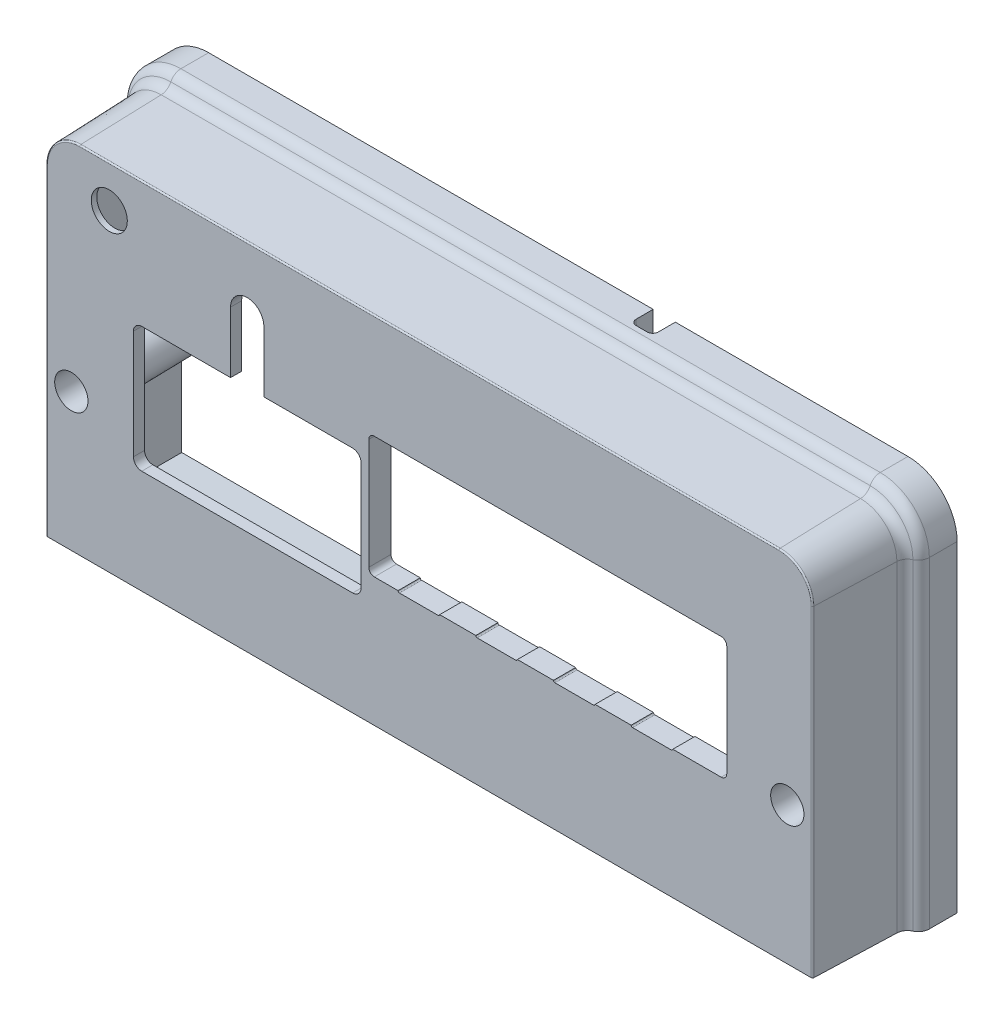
ISO-10303-21;
HEADER;
FILE_DESCRIPTION(('STEP AP214'),'2;1');
FILE_NAME('part.step','',(''),(''),'','','');
FILE_SCHEMA(('AUTOMOTIVE_DESIGN { 1 0 10303 214 1 1 1 1 }'));
ENDSEC;
DATA;
#1=APPLICATION_CONTEXT('core data for automotive mechanical design processes');
#2=APPLICATION_PROTOCOL_DEFINITION('international standard','automotive_design',2000,#1);
#3=PRODUCT_CONTEXT('',#1,'mechanical');
#4=PRODUCT('Part','Part','',(#3));
#5=PRODUCT_RELATED_PRODUCT_CATEGORY('part','',(#4));
#6=PRODUCT_DEFINITION_FORMATION('','',#4);
#7=PRODUCT_DEFINITION_CONTEXT('part definition',#1,'design');
#8=PRODUCT_DEFINITION('design','',#6,#7);
#9=PRODUCT_DEFINITION_SHAPE('','',#8);
#10=(LENGTH_UNIT() NAMED_UNIT(*) SI_UNIT(.MILLI.,.METRE.));
#11=(NAMED_UNIT(*) PLANE_ANGLE_UNIT() SI_UNIT($,.RADIAN.));
#12=(NAMED_UNIT(*) SI_UNIT($,.STERADIAN.) SOLID_ANGLE_UNIT());
#13=UNCERTAINTY_MEASURE_WITH_UNIT(LENGTH_MEASURE(1.E-05),#10,'distance_accuracy_value','');
#14=(GEOMETRIC_REPRESENTATION_CONTEXT(3) GLOBAL_UNCERTAINTY_ASSIGNED_CONTEXT((#13)) GLOBAL_UNIT_ASSIGNED_CONTEXT((#10,
#11,#12)) REPRESENTATION_CONTEXT('',''));
#15=CARTESIAN_POINT('',(0.,0.,0.));
#16=DIRECTION('',(0.,0.,1.));
#17=DIRECTION('',(1.,0.,0.));
#18=AXIS2_PLACEMENT_3D('',#15,#16,#17);
#19=CARTESIAN_POINT('',(-62.5080707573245,25.6770176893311,8.62068983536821));
#20=DIRECTION('',(0.,0.,1.));
#21=DIRECTION('',(1.,0.,0.));
#22=AXIS2_PLACEMENT_3D('',#19,#20,#21);
#23=TOROIDAL_SURFACE('',#22,8.5501779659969,2.);
#24=CARTESIAN_POINT('',(-71.0582487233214,25.6770176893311,8.6206898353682));
#25=DIRECTION('',(0.,1.,0.));
#26=DIRECTION('',(0.,0.,1.));
#27=AXIS2_PLACEMENT_3D('',#24,#25,#26);
#28=CIRCLE('',#27,2.);
#29=CARTESIAN_POINT('',(-69.0594670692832,25.6770176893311,8.5508908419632));
#30=VERTEX_POINT('',#29);
#31=CARTESIAN_POINT('',(-70.2081597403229,25.6770176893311,6.8103449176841));
#32=VERTEX_POINT('',#31);
#33=EDGE_CURVE('E1351',#30,#32,#28,.T.);
#34=ORIENTED_EDGE('',*,*,#33,.F.);
#35=CARTESIAN_POINT('',(-62.5080707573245,25.6770176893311,8.55089084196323));
#36=DIRECTION('',(0.,0.,1.));
#37=DIRECTION('',(1.,0.,0.));
#38=AXIS2_PLACEMENT_3D('',#35,#36,#37);
#39=CIRCLE('',#38,6.55139631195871);
#40=CARTESIAN_POINT('',(-62.5080707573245,32.2284140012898,8.55089084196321));
#41=VERTEX_POINT('',#40);
#42=EDGE_CURVE('E1331',#41,#30,#39,.T.);
#43=ORIENTED_EDGE('',*,*,#42,.F.);
#44=CARTESIAN_POINT('',(-62.5080707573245,34.227195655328,8.6206898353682));
#45=DIRECTION('',(1.,0.,0.));
#46=DIRECTION('',(0.,0.,-1.));
#47=AXIS2_PLACEMENT_3D('',#44,#45,#46);
#48=CIRCLE('',#47,2.);
#49=CARTESIAN_POINT('',(-62.5080707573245,33.3771066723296,6.8103449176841));
#50=VERTEX_POINT('',#49);
#51=EDGE_CURVE('E1349',#41,#50,#48,.T.);
#52=ORIENTED_EDGE('',*,*,#51,.T.);
#53=CARTESIAN_POINT('',(-62.5080707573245,25.6770176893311,6.81034491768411));
#54=DIRECTION('',(0.,0.,-1.));
#55=DIRECTION('',(-1.,0.,0.));
#56=AXIS2_PLACEMENT_3D('',#53,#54,#55);
#57=CIRCLE('',#56,7.70008898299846);
#58=EDGE_CURVE('E1334',#32,#50,#57,.T.);
#59=ORIENTED_EDGE('',*,*,#58,.F.);
#60=EDGE_LOOP('',(#34,#43,#52,#59));
#61=FACE_BOUND('',#60,.T.);
#62=ADVANCED_FACE('F35',(#61),#23,.F.);
#63=CARTESIAN_POINT('',(63.4919292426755,34.227195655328,8.62068983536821));
#64=DIRECTION('',(-1.,0.,0.));
#65=DIRECTION('',(0.,0.,1.));
#66=AXIS2_PLACEMENT_3D('',#63,#64,#65);
#67=CYLINDRICAL_SURFACE('',#66,2.);
#68=ORIENTED_EDGE('',*,*,#51,.F.);
#69=DIRECTION('',(1.,0.,0.));
#70=VECTOR('',#69,1.);
#71=CARTESIAN_POINT('',(63.4919292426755,32.2284140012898,8.55089084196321));
#72=LINE('',#71,#70);
#73=CARTESIAN_POINT('',(63.4919292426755,32.2284140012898,8.55089084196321));
#74=VERTEX_POINT('',#73);
#75=EDGE_CURVE('E1325',#74,#41,#72,.F.);
#76=ORIENTED_EDGE('',*,*,#75,.F.);
#77=CARTESIAN_POINT('',(63.4919292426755,34.227195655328,8.62068983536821));
#78=DIRECTION('',(1.,0.,0.));
#79=DIRECTION('',(0.,0.,-1.));
#80=AXIS2_PLACEMENT_3D('',#77,#78,#79);
#81=CIRCLE('',#80,2.);
#82=CARTESIAN_POINT('',(63.4919292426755,33.3771066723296,6.8103449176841));
#83=VERTEX_POINT('',#82);
#84=EDGE_CURVE('E1347',#74,#83,#81,.T.);
#85=ORIENTED_EDGE('',*,*,#84,.T.);
#86=DIRECTION('',(-1.,0.,0.));
#87=VECTOR('',#86,1.);
#88=CARTESIAN_POINT('',(63.4919292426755,33.3771066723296,6.81034491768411));
#89=LINE('',#88,#87);
#90=EDGE_CURVE('E1328',#50,#83,#89,.F.);
#91=ORIENTED_EDGE('',*,*,#90,.F.);
#92=EDGE_LOOP('',(#68,#76,#85,#91));
#93=FACE_BOUND('',#92,.T.);
#94=ADVANCED_FACE('F1457',(#93),#67,.F.);
#95=CARTESIAN_POINT('',(63.4919292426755,25.6770176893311,8.62068983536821));
#96=DIRECTION('',(0.,0.,1.));
#97=DIRECTION('',(1.,0.,0.));
#98=AXIS2_PLACEMENT_3D('',#95,#96,#97);
#99=TOROIDAL_SURFACE('',#98,8.55017796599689,2.);
#100=ORIENTED_EDGE('',*,*,#84,.F.);
#101=CARTESIAN_POINT('',(63.4919292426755,25.6770176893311,8.55089084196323));
#102=DIRECTION('',(0.,0.,1.));
#103=DIRECTION('',(1.,0.,0.));
#104=AXIS2_PLACEMENT_3D('',#101,#102,#103);
#105=CIRCLE('',#104,6.5513963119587);
#106=CARTESIAN_POINT('',(70.0433255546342,25.6770176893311,8.55089084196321));
#107=VERTEX_POINT('',#106);
#108=EDGE_CURVE('E1319',#107,#74,#105,.T.);
#109=ORIENTED_EDGE('',*,*,#108,.F.);
#110=CARTESIAN_POINT('',(72.0421072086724,25.6770176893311,8.62068983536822));
#111=DIRECTION('',(0.,-1.,0.));
#112=DIRECTION('',(0.,0.,-1.));
#113=AXIS2_PLACEMENT_3D('',#110,#111,#112);
#114=CIRCLE('',#113,2.);
#115=CARTESIAN_POINT('',(71.1920182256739,25.6770176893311,6.8103449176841));
#116=VERTEX_POINT('',#115);
#117=EDGE_CURVE('E1345',#107,#116,#114,.T.);
#118=ORIENTED_EDGE('',*,*,#117,.T.);
#119=CARTESIAN_POINT('',(63.4919292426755,25.6770176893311,6.81034491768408));
#120=DIRECTION('',(0.,0.,-1.));
#121=DIRECTION('',(-1.,0.,0.));
#122=AXIS2_PLACEMENT_3D('',#119,#120,#121);
#123=CIRCLE('',#122,7.70008898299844);
#124=EDGE_CURVE('E1322',#83,#116,#123,.T.);
#125=ORIENTED_EDGE('',*,*,#124,.F.);
#126=EDGE_LOOP('',(#100,#109,#118,#125));
#127=FACE_BOUND('',#126,.T.);
#128=ADVANCED_FACE('F1411',(#127),#99,.F.);
#129=CARTESIAN_POINT('',(72.0421072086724,-32.2818509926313,8.62068983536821));
#130=DIRECTION('',(0.,1.,0.));
#131=DIRECTION('',(0.,0.,1.));
#132=AXIS2_PLACEMENT_3D('',#129,#130,#131);
#133=CYLINDRICAL_SURFACE('',#132,2.);
#134=ORIENTED_EDGE('',*,*,#117,.F.);
#135=DIRECTION('',(0.,-1.,0.));
#136=VECTOR('',#135,1.);
#137=CARTESIAN_POINT('',(70.0433255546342,-32.2818509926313,8.55089084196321));
#138=LINE('',#137,#136);
#139=CARTESIAN_POINT('',(70.0433255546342,-32.2818509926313,8.55089084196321));
#140=VERTEX_POINT('',#139);
#141=EDGE_CURVE('E1313',#140,#107,#138,.F.);
#142=ORIENTED_EDGE('',*,*,#141,.F.);
#143=CARTESIAN_POINT('',(72.0421072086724,-32.2818509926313,8.62068983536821));
#144=DIRECTION('',(0.,-1.,0.));
#145=DIRECTION('',(0.,0.,-1.));
#146=AXIS2_PLACEMENT_3D('',#143,#144,#145);
#147=CIRCLE('',#146,2.);
#148=CARTESIAN_POINT('',(71.1920182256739,-32.2818509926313,6.81034491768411));
#149=VERTEX_POINT('',#148);
#150=EDGE_CURVE('E1343',#140,#149,#147,.T.);
#151=ORIENTED_EDGE('',*,*,#150,.T.);
#152=DIRECTION('',(0.,1.,0.));
#153=VECTOR('',#152,1.);
#154=CARTESIAN_POINT('',(71.1920182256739,-32.2818509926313,6.81034491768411));
#155=LINE('',#154,#153);
#156=EDGE_CURVE('E1316',#116,#149,#155,.F.);
#157=ORIENTED_EDGE('',*,*,#156,.F.);
#158=EDGE_LOOP('',(#134,#142,#151,#157));
#159=FACE_BOUND('',#158,.T.);
#160=ADVANCED_FACE('F1423',(#159),#133,.F.);
#161=CARTESIAN_POINT('',(-71.0582487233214,25.6770176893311,8.6206898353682));
#162=DIRECTION('',(0.,-1.,0.));
#163=DIRECTION('',(1.,0.,0.));
#164=AXIS2_PLACEMENT_3D('',#161,#162,#163);
#165=CYLINDRICAL_SURFACE('',#164,2.);
#166=DIRECTION('',(0.,1.,0.));
#167=VECTOR('',#166,1.);
#168=CARTESIAN_POINT('',(-69.0594670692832,25.6770176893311,8.5508908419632));
#169=LINE('',#168,#167);
#170=CARTESIAN_POINT('',(-69.0594670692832,-32.2818509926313,8.55089084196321));
#171=VERTEX_POINT('',#170);
#172=EDGE_CURVE('E1337',#30,#171,#169,.F.);
#173=ORIENTED_EDGE('',*,*,#172,.F.);
#174=ORIENTED_EDGE('',*,*,#33,.T.);
#175=DIRECTION('',(0.,-1.,0.));
#176=VECTOR('',#175,1.);
#177=CARTESIAN_POINT('',(-70.2081597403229,25.6770176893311,6.8103449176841));
#178=LINE('',#177,#176);
#179=CARTESIAN_POINT('',(-70.2081597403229,-32.2818509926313,6.81034491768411));
#180=VERTEX_POINT('',#179);
#181=EDGE_CURVE('E1340',#180,#32,#178,.F.);
#182=ORIENTED_EDGE('',*,*,#181,.F.);
#183=CARTESIAN_POINT('',(-71.0582487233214,-32.2818509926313,8.6206898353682));
#184=DIRECTION('',(0.,-1.,0.));
#185=DIRECTION('',(0.,0.,-1.));
#186=AXIS2_PLACEMENT_3D('',#183,#184,#185);
#187=CIRCLE('',#186,2.);
#188=EDGE_CURVE('E58',#180,#171,#187,.T.);
#189=ORIENTED_EDGE('',*,*,#188,.T.);
#190=EDGE_LOOP('',(#173,#174,#182,#189));
#191=FACE_BOUND('',#190,.T.);
#192=ADVANCED_FACE('F37',(#191),#165,.F.);
#193=CARTESIAN_POINT('',(63.4919292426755,25.6770176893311,5.));
#194=DIRECTION('',(0.,0.,-1.));
#195=DIRECTION('',(-1.,0.,0.));
#196=AXIS2_PLACEMENT_3D('',#193,#194,#195);
#197=TOROIDAL_SURFACE('',#196,6.85,2.);
#198=CARTESIAN_POINT('',(63.4919292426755,32.5270176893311,5.));
#199=DIRECTION('',(1.,0.,0.));
#200=DIRECTION('',(0.,0.,-1.));
#201=AXIS2_PLACEMENT_3D('',#198,#199,#200);
#202=CIRCLE('',#201,2.);
#203=CARTESIAN_POINT('',(63.4919292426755,34.5270176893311,5.));
#204=VERTEX_POINT('',#203);
#205=EDGE_CURVE('E1307',#204,#83,#202,.T.);
#206=ORIENTED_EDGE('',*,*,#205,.T.);
#207=ORIENTED_EDGE('',*,*,#124,.T.);
#208=CARTESIAN_POINT('',(70.3419292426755,25.6770176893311,5.));
#209=DIRECTION('',(0.,-1.,0.));
#210=DIRECTION('',(0.,0.,-1.));
#211=AXIS2_PLACEMENT_3D('',#208,#209,#210);
#212=CIRCLE('',#211,2.);
#213=CARTESIAN_POINT('',(72.3419292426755,25.6770176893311,5.));
#214=VERTEX_POINT('',#213);
#215=EDGE_CURVE('E1310',#214,#116,#212,.T.);
#216=ORIENTED_EDGE('',*,*,#215,.F.);
#217=CARTESIAN_POINT('',(63.4919292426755,25.6770176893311,5.));
#218=DIRECTION('',(0.,0.,-1.));
#219=DIRECTION('',(-1.,0.,0.));
#220=AXIS2_PLACEMENT_3D('',#217,#218,#219);
#221=CIRCLE('',#220,8.85);
#222=EDGE_CURVE('E1296',#204,#214,#221,.T.);
#223=ORIENTED_EDGE('',*,*,#222,.F.);
#224=EDGE_LOOP('',(#206,#207,#216,#223));
#225=FACE_BOUND('',#224,.T.);
#226=ADVANCED_FACE('F1416',(#225),#197,.T.);
#227=CARTESIAN_POINT('',(63.4919292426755,32.5270176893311,5.));
#228=DIRECTION('',(-1.,0.,0.));
#229=DIRECTION('',(0.,0.,1.));
#230=AXIS2_PLACEMENT_3D('',#227,#228,#229);
#231=CYLINDRICAL_SURFACE('',#230,2.);
#232=CARTESIAN_POINT('',(-62.5080707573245,32.5270176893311,5.));
#233=DIRECTION('',(1.,0.,0.));
#234=DIRECTION('',(0.,0.,-1.));
#235=AXIS2_PLACEMENT_3D('',#232,#233,#234);
#236=CIRCLE('',#235,2.);
#237=CARTESIAN_POINT('',(-62.5080707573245,34.5270176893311,5.));
#238=VERTEX_POINT('',#237);
#239=EDGE_CURVE('E1304',#238,#50,#236,.T.);
#240=ORIENTED_EDGE('',*,*,#239,.T.);
#241=ORIENTED_EDGE('',*,*,#90,.T.);
#242=ORIENTED_EDGE('',*,*,#205,.F.);
#243=DIRECTION('',(1.,0.,0.));
#244=VECTOR('',#243,1.);
#245=CARTESIAN_POINT('',(63.4919292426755,34.5270176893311,5.));
#246=LINE('',#245,#244);
#247=EDGE_CURVE('E1294',#238,#204,#246,.T.);
#248=ORIENTED_EDGE('',*,*,#247,.F.);
#249=EDGE_LOOP('',(#240,#241,#242,#248));
#250=FACE_BOUND('',#249,.T.);
#251=ADVANCED_FACE('F1407',(#250),#231,.T.);
#252=CARTESIAN_POINT('',(-62.5080707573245,25.6770176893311,5.));
#253=DIRECTION('',(0.,0.,-1.));
#254=DIRECTION('',(-1.,0.,0.));
#255=AXIS2_PLACEMENT_3D('',#252,#253,#254);
#256=TOROIDAL_SURFACE('',#255,6.85000000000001,2.);
#257=CARTESIAN_POINT('',(-69.3580707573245,25.6770176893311,5.));
#258=DIRECTION('',(0.,1.,0.));
#259=DIRECTION('',(0.,0.,1.));
#260=AXIS2_PLACEMENT_3D('',#257,#258,#259);
#261=CIRCLE('',#260,2.);
#262=CARTESIAN_POINT('',(-71.3580707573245,25.6770176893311,5.));
#263=VERTEX_POINT('',#262);
#264=EDGE_CURVE('E1301',#263,#32,#261,.T.);
#265=ORIENTED_EDGE('',*,*,#264,.T.);
#266=ORIENTED_EDGE('',*,*,#58,.T.);
#267=ORIENTED_EDGE('',*,*,#239,.F.);
#268=CARTESIAN_POINT('',(-62.5080707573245,25.6770176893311,5.));
#269=DIRECTION('',(0.,0.,-1.));
#270=DIRECTION('',(-1.,0.,0.));
#271=AXIS2_PLACEMENT_3D('',#268,#269,#270);
#272=CIRCLE('',#271,8.85000000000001);
#273=EDGE_CURVE('E1291',#263,#238,#272,.T.);
#274=ORIENTED_EDGE('',*,*,#273,.F.);
#275=EDGE_LOOP('',(#265,#266,#267,#274));
#276=FACE_BOUND('',#275,.T.);
#277=ADVANCED_FACE('F1405',(#276),#256,.T.);
#278=CARTESIAN_POINT('',(-69.3580707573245,25.6770176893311,5.));
#279=DIRECTION('',(0.,-1.,0.));
#280=DIRECTION('',(1.,0.,0.));
#281=AXIS2_PLACEMENT_3D('',#278,#279,#280);
#282=CYLINDRICAL_SURFACE('',#281,2.);
#283=CARTESIAN_POINT('',(-69.3580707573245,-32.2818509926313,5.));
#284=DIRECTION('',(0.,-1.,0.));
#285=DIRECTION('',(0.,0.,-1.));
#286=AXIS2_PLACEMENT_3D('',#283,#284,#285);
#287=CIRCLE('',#286,2.);
#288=CARTESIAN_POINT('',(-71.3580707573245,-32.2818509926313,5.));
#289=VERTEX_POINT('',#288);
#290=EDGE_CURVE('E1289',#180,#289,#287,.T.);
#291=ORIENTED_EDGE('',*,*,#290,.F.);
#292=ORIENTED_EDGE('',*,*,#181,.T.);
#293=ORIENTED_EDGE('',*,*,#264,.F.);
#294=DIRECTION('',(0.,1.,0.));
#295=VECTOR('',#294,1.);
#296=CARTESIAN_POINT('',(-71.3580707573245,25.6770176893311,5.));
#297=LINE('',#296,#295);
#298=EDGE_CURVE('E1283',#289,#263,#297,.T.);
#299=ORIENTED_EDGE('',*,*,#298,.F.);
#300=EDGE_LOOP('',(#291,#292,#293,#299));
#301=FACE_BOUND('',#300,.T.);
#302=ADVANCED_FACE('F1402',(#301),#282,.T.);
#303=CARTESIAN_POINT('',(70.3419292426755,-32.2818509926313,5.));
#304=DIRECTION('',(0.,1.,0.));
#305=DIRECTION('',(0.,0.,1.));
#306=AXIS2_PLACEMENT_3D('',#303,#304,#305);
#307=CYLINDRICAL_SURFACE('',#306,2.);
#308=ORIENTED_EDGE('',*,*,#215,.T.);
#309=ORIENTED_EDGE('',*,*,#156,.T.);
#310=CARTESIAN_POINT('',(70.3419292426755,-32.2818509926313,5.));
#311=DIRECTION('',(0.,-1.,0.));
#312=DIRECTION('',(0.,0.,-1.));
#313=AXIS2_PLACEMENT_3D('',#310,#311,#312);
#314=CIRCLE('',#313,2.);
#315=CARTESIAN_POINT('',(72.3419292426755,-32.2818509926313,5.));
#316=VERTEX_POINT('',#315);
#317=EDGE_CURVE('E1286',#316,#149,#314,.T.);
#318=ORIENTED_EDGE('',*,*,#317,.F.);
#319=DIRECTION('',(0.,-1.,0.));
#320=VECTOR('',#319,1.);
#321=CARTESIAN_POINT('',(72.3419292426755,-32.2818509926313,5.));
#322=LINE('',#321,#320);
#323=EDGE_CURVE('E1299',#214,#316,#322,.T.);
#324=ORIENTED_EDGE('',*,*,#323,.F.);
#325=EDGE_LOOP('',(#308,#309,#318,#324));
#326=FACE_BOUND('',#325,.T.);
#327=ADVANCED_FACE('F1418',(#326),#307,.T.);
#328=CARTESIAN_POINT('',(63.4919292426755,25.6770176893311,0.));
#329=DIRECTION('',(0.,0.,-1.));
#330=DIRECTION('',(1.,0.,0.));
#331=AXIS2_PLACEMENT_3D('',#328,#329,#330);
#332=CONICAL_SURFACE('',#331,6.85,0.0349065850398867);
#333=DIRECTION('',(0.034899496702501,0.,-0.999390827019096));
#334=VECTOR('',#333,1.);
#335=CARTESIAN_POINT('',(70.3419292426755,25.6770176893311,0.));
#336=LINE('',#335,#334);
#337=CARTESIAN_POINT('',(69.5387960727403,25.6770176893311,22.9987248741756));
#338=VERTEX_POINT('',#337);
#339=EDGE_CURVE('E1100',#338,#107,#336,.T.);
#340=ORIENTED_EDGE('',*,*,#339,.T.);
#341=ORIENTED_EDGE('',*,*,#108,.T.);
#342=DIRECTION('',(0.,0.034899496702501,-0.999390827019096));
#343=VECTOR('',#342,1.);
#344=CARTESIAN_POINT('',(63.4919292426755,32.5270176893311,0.));
#345=LINE('',#344,#343);
#346=CARTESIAN_POINT('',(63.4919292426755,31.7238845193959,22.9987248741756));
#347=VERTEX_POINT('',#346);
#348=EDGE_CURVE('E1101',#347,#74,#345,.T.);
#349=ORIENTED_EDGE('',*,*,#348,.F.);
#350=CARTESIAN_POINT('',(63.4919292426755,25.6770176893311,22.9987248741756));
#351=DIRECTION('',(0.,0.,-1.));
#352=DIRECTION('',(-1.,0.,0.));
#353=AXIS2_PLACEMENT_3D('',#350,#351,#352);
#354=CIRCLE('',#353,6.04686683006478);
#355=EDGE_CURVE('E1193',#347,#338,#354,.T.);
#356=ORIENTED_EDGE('',*,*,#355,.T.);
#357=EDGE_LOOP('',(#340,#341,#349,#356));
#358=FACE_BOUND('',#357,.T.);
#359=ADVANCED_FACE('F1459',(#358),#332,.T.);
#360=CARTESIAN_POINT('',(63.4919292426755,32.5270176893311,0.));
#361=DIRECTION('',(0.,0.999390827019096,0.034899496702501));
#362=DIRECTION('',(0.,-0.034899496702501,0.999390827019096));
#363=AXIS2_PLACEMENT_3D('',#360,#361,#362);
#364=PLANE('',#363);
#365=ORIENTED_EDGE('',*,*,#348,.T.);
#366=ORIENTED_EDGE('',*,*,#75,.T.);
#367=DIRECTION('',(0.,0.034899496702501,-0.999390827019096));
#368=VECTOR('',#367,1.);
#369=CARTESIAN_POINT('',(-62.5080707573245,32.5270176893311,0.));
#370=LINE('',#369,#368);
#371=CARTESIAN_POINT('',(-62.5080707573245,31.7238845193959,22.9987248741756));
#372=VERTEX_POINT('',#371);
#373=EDGE_CURVE('E1105',#372,#41,#370,.T.);
#374=ORIENTED_EDGE('',*,*,#373,.F.);
#375=DIRECTION('',(-1.,0.,0.));
#376=VECTOR('',#375,1.);
#377=CARTESIAN_POINT('',(63.4919292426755,31.7238845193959,22.9987248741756));
#378=LINE('',#377,#376);
#379=EDGE_CURVE('E1196',#372,#347,#378,.F.);
#380=ORIENTED_EDGE('',*,*,#379,.T.);
#381=EDGE_LOOP('',(#365,#366,#374,#380));
#382=FACE_BOUND('',#381,.T.);
#383=ADVANCED_FACE('F1455',(#382),#364,.T.);
#384=CARTESIAN_POINT('',(-62.5080707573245,25.6770176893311,0.));
#385=DIRECTION('',(0.,0.,-1.));
#386=DIRECTION('',(1.,0.,0.));
#387=AXIS2_PLACEMENT_3D('',#384,#385,#386);
#388=CONICAL_SURFACE('',#387,6.85000000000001,0.0349065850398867);
#389=ORIENTED_EDGE('',*,*,#373,.T.);
#390=ORIENTED_EDGE('',*,*,#42,.T.);
#391=DIRECTION('',(-0.034899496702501,0.,-0.999390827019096));
#392=VECTOR('',#391,1.);
#393=CARTESIAN_POINT('',(-69.3580707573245,25.6770176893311,0.));
#394=LINE('',#393,#392);
#395=CARTESIAN_POINT('',(-68.5549375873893,25.6770176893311,22.9987248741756));
#396=VERTEX_POINT('',#395);
#397=EDGE_CURVE('E1108',#396,#30,#394,.T.);
#398=ORIENTED_EDGE('',*,*,#397,.F.);
#399=CARTESIAN_POINT('',(-62.5080707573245,25.6770176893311,22.9987248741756));
#400=DIRECTION('',(0.,0.,-1.));
#401=DIRECTION('',(-1.,0.,0.));
#402=AXIS2_PLACEMENT_3D('',#399,#400,#401);
#403=CIRCLE('',#402,6.0468668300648);
#404=EDGE_CURVE('E1199',#396,#372,#403,.T.);
#405=ORIENTED_EDGE('',*,*,#404,.T.);
#406=EDGE_LOOP('',(#389,#390,#398,#405));
#407=FACE_BOUND('',#406,.T.);
#408=ADVANCED_FACE('F1449',(#407),#388,.T.);
#409=CARTESIAN_POINT('',(-69.3580707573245,25.6770176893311,0.));
#410=DIRECTION('',(-0.999390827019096,0.,0.034899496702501));
#411=DIRECTION('',(0.034899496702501,0.,0.999390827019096));
#412=AXIS2_PLACEMENT_3D('',#409,#410,#411);
#413=PLANE('',#412);
#414=ORIENTED_EDGE('',*,*,#397,.T.);
#415=ORIENTED_EDGE('',*,*,#172,.T.);
#416=DIRECTION('',(-0.0348994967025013,0.,-0.999390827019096));
#417=VECTOR('',#416,1.);
#418=CARTESIAN_POINT('',(-68.5465120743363,-32.2818509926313,23.24));
#419=LINE('',#418,#417);
#420=CARTESIAN_POINT('',(-68.5549375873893,-32.2818509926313,22.9987248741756));
#421=VERTEX_POINT('',#420);
#422=EDGE_CURVE('E839',#421,#171,#419,.T.);
#423=ORIENTED_EDGE('',*,*,#422,.F.);
#424=DIRECTION('',(0.,-1.,0.));
#425=VECTOR('',#424,1.);
#426=CARTESIAN_POINT('',(-68.5549375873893,25.6770176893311,22.9987248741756));
#427=LINE('',#426,#425);
#428=EDGE_CURVE('E1202',#421,#396,#427,.F.);
#429=ORIENTED_EDGE('',*,*,#428,.T.);
#430=EDGE_LOOP('',(#414,#415,#423,#429));
#431=FACE_BOUND('',#430,.T.);
#432=ADVANCED_FACE('F1443',(#431),#413,.T.);
#433=CARTESIAN_POINT('',(70.3419292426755,-32.2818509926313,0.));
#434=DIRECTION('',(0.999390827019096,0.,0.034899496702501));
#435=DIRECTION('',(0.034899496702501,0.,-0.999390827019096));
#436=AXIS2_PLACEMENT_3D('',#433,#434,#435);
#437=PLANE('',#436);
#438=DIRECTION('',(-0.0348994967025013,0.,0.999390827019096));
#439=VECTOR('',#438,1.);
#440=CARTESIAN_POINT('',(70.3419292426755,-32.2818509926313,0.));
#441=LINE('',#440,#439);
#442=CARTESIAN_POINT('',(69.5387960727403,-32.2818509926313,22.9987248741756));
#443=VERTEX_POINT('',#442);
#444=EDGE_CURVE('E827',#140,#443,#441,.T.);
#445=ORIENTED_EDGE('',*,*,#444,.F.);
#446=ORIENTED_EDGE('',*,*,#141,.T.);
#447=ORIENTED_EDGE('',*,*,#339,.F.);
#448=DIRECTION('',(0.,1.,0.));
#449=VECTOR('',#448,1.);
#450=CARTESIAN_POINT('',(69.5387960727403,25.6770176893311,22.9987248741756));
#451=LINE('',#450,#449);
#452=EDGE_CURVE('E1185',#338,#443,#451,.F.);
#453=ORIENTED_EDGE('',*,*,#452,.T.);
#454=EDGE_LOOP('',(#445,#446,#447,#453));
#455=FACE_BOUND('',#454,.T.);
#456=ADVANCED_FACE('F1426',(#455),#437,.T.);
#457=CARTESIAN_POINT('',(66.3492289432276,-28.2891506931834,-0.278856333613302));
#458=DIRECTION('',(0.0348782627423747,-0.0348782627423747,-0.998782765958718));
#459=DIRECTION('',(-0.999390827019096,0.,-0.0348994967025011));
#460=AXIS2_PLACEMENT_3D('',#457,#458,#459);
#461=CYLINDRICAL_SURFACE('',#460,2.);
#462=DIRECTION('',(0.0348782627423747,-0.0348782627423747,-0.998782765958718));
#463=VECTOR('',#462,1.);
#464=CARTESIAN_POINT('',(68.3480105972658,-28.2891506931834,-0.209057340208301));
#465=LINE('',#464,#463);
#466=CARTESIAN_POINT('',(68.3407101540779,-28.2818502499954,0.));
#467=VERTEX_POINT('',#466);
#468=CARTESIAN_POINT('',(67.5989930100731,-27.5401331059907,21.24));
#469=VERTEX_POINT('',#468);
#470=EDGE_CURVE('E1273',#467,#469,#465,.F.);
#471=ORIENTED_EDGE('',*,*,#470,.F.);
#472=CARTESIAN_POINT('',(66.3394910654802,-28.279412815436,0.));
#473=DIRECTION('',(0.,0.,1.));
#474=DIRECTION('',(0.707106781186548,-0.707106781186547,0.));
#475=AXIS2_PLACEMENT_3D('',#472,#473,#474);
#476=ELLIPSE('',#475,2.00243743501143,2.);
#477=CARTESIAN_POINT('',(66.3419285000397,-30.2806319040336,0.));
#478=VERTEX_POINT('',#477);
#479=EDGE_CURVE('E1281',#467,#478,#476,.F.);
#480=ORIENTED_EDGE('',*,*,#479,.T.);
#481=DIRECTION('',(0.0348782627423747,-0.0348782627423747,-0.998782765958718));
#482=VECTOR('',#481,1.);
#483=CARTESIAN_POINT('',(66.3492289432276,-30.2879323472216,-0.2090573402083));
#484=LINE('',#483,#482);
#485=CARTESIAN_POINT('',(65.600211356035,-29.5389147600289,21.24));
#486=VERTEX_POINT('',#485);
#487=EDGE_CURVE('E1276',#486,#478,#484,.T.);
#488=ORIENTED_EDGE('',*,*,#487,.F.);
#489=CARTESIAN_POINT('',(65.5977739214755,-27.5376956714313,21.24));
#490=DIRECTION('',(0.,0.,1.));
#491=DIRECTION('',(0.707106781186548,-0.707106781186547,0.));
#492=AXIS2_PLACEMENT_3D('',#489,#490,#491);
#493=ELLIPSE('',#492,2.00243743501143,2.);
#494=EDGE_CURVE('E1279',#469,#486,#493,.F.);
#495=ORIENTED_EDGE('',*,*,#494,.F.);
#496=EDGE_LOOP('',(#471,#480,#488,#495));
#497=FACE_BOUND('',#496,.T.);
#498=ADVANCED_FACE('F1495',(#497),#461,.F.);
#499=CARTESIAN_POINT('',(37.1101984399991,-9.10298231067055,-0.001000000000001));
#500=DIRECTION('',(0.,0.,-1.));
#501=DIRECTION('',(-1.,0.,0.));
#502=AXIS2_PLACEMENT_3D('',#499,#500,#501);
#503=CYLINDRICAL_SURFACE('',#502,0.25);
#504=DIRECTION('',(0.,0.,1.));
#505=VECTOR('',#504,1.);
#506=CARTESIAN_POINT('',(37.1101984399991,-9.35298231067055,-0.001000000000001));
#507=LINE('',#506,#505);
#508=CARTESIAN_POINT('',(37.1101984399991,-9.35298231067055,19.24));
#509=VERTEX_POINT('',#508);
#510=CARTESIAN_POINT('',(37.1101984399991,-9.35298231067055,23.24));
#511=VERTEX_POINT('',#510);
#512=EDGE_CURVE('E1266',#509,#511,#507,.T.);
#513=ORIENTED_EDGE('',*,*,#512,.F.);
#514=CARTESIAN_POINT('',(37.1101984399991,-9.10298231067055,19.24));
#515=DIRECTION('',(0.,0.,-1.));
#516=DIRECTION('',(-1.,0.,0.));
#517=AXIS2_PLACEMENT_3D('',#514,#515,#516);
#518=CIRCLE('',#517,0.25);
#519=CARTESIAN_POINT('',(36.8601984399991,-9.10298231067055,19.24));
#520=VERTEX_POINT('',#519);
#521=EDGE_CURVE('E1269',#509,#520,#518,.T.);
#522=ORIENTED_EDGE('',*,*,#521,.T.);
#523=DIRECTION('',(0.,0.,1.));
#524=VECTOR('',#523,1.);
#525=CARTESIAN_POINT('',(36.8601984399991,-9.10298231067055,-0.001000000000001));
#526=LINE('',#525,#524);
#527=CARTESIAN_POINT('',(36.8601984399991,-9.10298231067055,23.24));
#528=VERTEX_POINT('',#527);
#529=EDGE_CURVE('E663',#520,#528,#526,.T.);
#530=ORIENTED_EDGE('',*,*,#529,.T.);
#531=CARTESIAN_POINT('',(37.1101984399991,-9.10298231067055,23.24));
#532=DIRECTION('',(0.,0.,1.));
#533=DIRECTION('',(1.,0.,0.));
#534=AXIS2_PLACEMENT_3D('',#531,#532,#533);
#535=CIRCLE('',#534,0.25);
#536=EDGE_CURVE('E1271',#528,#511,#535,.T.);
#537=ORIENTED_EDGE('',*,*,#536,.T.);
#538=EDGE_LOOP('',(#513,#522,#530,#537));
#539=FACE_BOUND('',#538,.T.);
#540=ADVANCED_FACE('F1498',(#539),#503,.F.);
#541=CARTESIAN_POINT('',(23.1101984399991,-9.10298231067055,-0.001000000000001));
#542=DIRECTION('',(0.,0.,-1.));
#543=DIRECTION('',(-1.,0.,0.));
#544=AXIS2_PLACEMENT_3D('',#541,#542,#543);
#545=CYLINDRICAL_SURFACE('',#544,0.25);
#546=DIRECTION('',(0.,0.,1.));
#547=VECTOR('',#546,1.);
#548=CARTESIAN_POINT('',(23.1101984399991,-9.35298231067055,-0.001000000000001));
#549=LINE('',#548,#547);
#550=CARTESIAN_POINT('',(23.1101984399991,-9.35298231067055,19.24));
#551=VERTEX_POINT('',#550);
#552=CARTESIAN_POINT('',(23.1101984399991,-9.35298231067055,23.24));
#553=VERTEX_POINT('',#552);
#554=EDGE_CURVE('E1259',#551,#553,#549,.T.);
#555=ORIENTED_EDGE('',*,*,#554,.F.);
#556=CARTESIAN_POINT('',(23.1101984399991,-9.10298231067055,19.24));
#557=DIRECTION('',(0.,0.,-1.));
#558=DIRECTION('',(-1.,0.,0.));
#559=AXIS2_PLACEMENT_3D('',#556,#557,#558);
#560=CIRCLE('',#559,0.25);
#561=CARTESIAN_POINT('',(22.8601984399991,-9.10298231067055,19.24));
#562=VERTEX_POINT('',#561);
#563=EDGE_CURVE('E1262',#551,#562,#560,.T.);
#564=ORIENTED_EDGE('',*,*,#563,.T.);
#565=DIRECTION('',(0.,0.,1.));
#566=VECTOR('',#565,1.);
#567=CARTESIAN_POINT('',(22.8601984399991,-9.10298231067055,-0.001000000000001));
#568=LINE('',#567,#566);
#569=CARTESIAN_POINT('',(22.8601984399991,-9.10298231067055,23.24));
#570=VERTEX_POINT('',#569);
#571=EDGE_CURVE('E673',#562,#570,#568,.T.);
#572=ORIENTED_EDGE('',*,*,#571,.T.);
#573=CARTESIAN_POINT('',(23.1101984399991,-9.10298231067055,23.24));
#574=DIRECTION('',(0.,0.,1.));
#575=DIRECTION('',(1.,0.,0.));
#576=AXIS2_PLACEMENT_3D('',#573,#574,#575);
#577=CIRCLE('',#576,0.25);
#578=EDGE_CURVE('E1264',#570,#553,#577,.T.);
#579=ORIENTED_EDGE('',*,*,#578,.T.);
#580=EDGE_LOOP('',(#555,#564,#572,#579));
#581=FACE_BOUND('',#580,.T.);
#582=ADVANCED_FACE('F1502',(#581),#545,.F.);
#583=CARTESIAN_POINT('',(9.11019843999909,-9.10298231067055,-0.001000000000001));
#584=DIRECTION('',(0.,0.,-1.));
#585=DIRECTION('',(-1.,0.,0.));
#586=AXIS2_PLACEMENT_3D('',#583,#584,#585);
#587=CYLINDRICAL_SURFACE('',#586,0.25);
#588=DIRECTION('',(0.,0.,1.));
#589=VECTOR('',#588,1.);
#590=CARTESIAN_POINT('',(9.11019843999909,-9.35298231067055,-0.001000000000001));
#591=LINE('',#590,#589);
#592=CARTESIAN_POINT('',(9.11019843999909,-9.35298231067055,19.24));
#593=VERTEX_POINT('',#592);
#594=CARTESIAN_POINT('',(9.11019843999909,-9.35298231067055,23.24));
#595=VERTEX_POINT('',#594);
#596=EDGE_CURVE('E1252',#593,#595,#591,.T.);
#597=ORIENTED_EDGE('',*,*,#596,.F.);
#598=CARTESIAN_POINT('',(9.11019843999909,-9.10298231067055,19.24));
#599=DIRECTION('',(0.,0.,-1.));
#600=DIRECTION('',(-1.,0.,0.));
#601=AXIS2_PLACEMENT_3D('',#598,#599,#600);
#602=CIRCLE('',#601,0.25);
#603=CARTESIAN_POINT('',(8.86019843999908,-9.10298231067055,19.24));
#604=VERTEX_POINT('',#603);
#605=EDGE_CURVE('E1255',#593,#604,#602,.T.);
#606=ORIENTED_EDGE('',*,*,#605,.T.);
#607=DIRECTION('',(0.,0.,1.));
#608=VECTOR('',#607,1.);
#609=CARTESIAN_POINT('',(8.86019843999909,-9.10298231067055,-0.001000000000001));
#610=LINE('',#609,#608);
#611=CARTESIAN_POINT('',(8.86019843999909,-9.10298231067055,23.24));
#612=VERTEX_POINT('',#611);
#613=EDGE_CURVE('E683',#604,#612,#610,.T.);
#614=ORIENTED_EDGE('',*,*,#613,.T.);
#615=CARTESIAN_POINT('',(9.11019843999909,-9.10298231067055,23.24));
#616=DIRECTION('',(0.,0.,1.));
#617=DIRECTION('',(1.,0.,0.));
#618=AXIS2_PLACEMENT_3D('',#615,#616,#617);
#619=CIRCLE('',#618,0.25);
#620=EDGE_CURVE('E1257',#612,#595,#619,.T.);
#621=ORIENTED_EDGE('',*,*,#620,.T.);
#622=EDGE_LOOP('',(#597,#606,#614,#621));
#623=FACE_BOUND('',#622,.T.);
#624=ADVANCED_FACE('F1506',(#623),#587,.F.);
#625=CARTESIAN_POINT('',(-4.88980156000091,-9.10298231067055,-0.001000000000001));
#626=DIRECTION('',(0.,0.,-1.));
#627=DIRECTION('',(-1.,0.,0.));
#628=AXIS2_PLACEMENT_3D('',#625,#626,#627);
#629=CYLINDRICAL_SURFACE('',#628,0.25);
#630=DIRECTION('',(0.,0.,1.));
#631=VECTOR('',#630,1.);
#632=CARTESIAN_POINT('',(-4.88980156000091,-9.35298231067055,-0.001000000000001));
#633=LINE('',#632,#631);
#634=CARTESIAN_POINT('',(-4.88980156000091,-9.35298231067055,19.24));
#635=VERTEX_POINT('',#634);
#636=CARTESIAN_POINT('',(-4.88980156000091,-9.35298231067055,23.24));
#637=VERTEX_POINT('',#636);
#638=EDGE_CURVE('E1245',#635,#637,#633,.T.);
#639=ORIENTED_EDGE('',*,*,#638,.F.);
#640=CARTESIAN_POINT('',(-4.88980156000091,-9.10298231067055,19.24));
#641=DIRECTION('',(0.,0.,-1.));
#642=DIRECTION('',(-1.,0.,0.));
#643=AXIS2_PLACEMENT_3D('',#640,#641,#642);
#644=CIRCLE('',#643,0.25);
#645=CARTESIAN_POINT('',(-5.13980156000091,-9.10298231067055,19.24));
#646=VERTEX_POINT('',#645);
#647=EDGE_CURVE('E1248',#635,#646,#644,.T.);
#648=ORIENTED_EDGE('',*,*,#647,.T.);
#649=DIRECTION('',(0.,0.,1.));
#650=VECTOR('',#649,1.);
#651=CARTESIAN_POINT('',(-5.13980156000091,-9.10298231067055,-0.001000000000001));
#652=LINE('',#651,#650);
#653=CARTESIAN_POINT('',(-5.13980156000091,-9.10298231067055,23.24));
#654=VERTEX_POINT('',#653);
#655=EDGE_CURVE('E693',#646,#654,#652,.T.);
#656=ORIENTED_EDGE('',*,*,#655,.T.);
#657=CARTESIAN_POINT('',(-4.88980156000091,-9.10298231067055,23.24));
#658=DIRECTION('',(0.,0.,1.));
#659=DIRECTION('',(1.,0.,0.));
#660=AXIS2_PLACEMENT_3D('',#657,#658,#659);
#661=CIRCLE('',#660,0.25);
#662=EDGE_CURVE('E1250',#654,#637,#661,.T.);
#663=ORIENTED_EDGE('',*,*,#662,.T.);
#664=EDGE_LOOP('',(#639,#648,#656,#663));
#665=FACE_BOUND('',#664,.T.);
#666=ADVANCED_FACE('F1510',(#665),#629,.F.);
#667=CARTESIAN_POINT('',(2.11019843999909,-9.10298231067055,-0.001000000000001));
#668=DIRECTION('',(0.,0.,1.));
#669=DIRECTION('',(1.,0.,0.));
#670=AXIS2_PLACEMENT_3D('',#667,#668,#669);
#671=CYLINDRICAL_SURFACE('',#670,0.25);
#672=DIRECTION('',(0.,0.,-1.));
#673=VECTOR('',#672,1.);
#674=CARTESIAN_POINT('',(2.11019843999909,-9.35298231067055,-0.001000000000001));
#675=LINE('',#674,#673);
#676=CARTESIAN_POINT('',(2.11019843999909,-9.35298231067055,23.24));
#677=VERTEX_POINT('',#676);
#678=CARTESIAN_POINT('',(2.11019843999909,-9.35298231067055,19.24));
#679=VERTEX_POINT('',#678);
#680=EDGE_CURVE('E1237',#677,#679,#675,.T.);
#681=ORIENTED_EDGE('',*,*,#680,.F.);
#682=CARTESIAN_POINT('',(2.11019843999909,-9.10298231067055,23.24));
#683=DIRECTION('',(0.,0.,1.));
#684=DIRECTION('',(1.,0.,0.));
#685=AXIS2_PLACEMENT_3D('',#682,#683,#684);
#686=CIRCLE('',#685,0.25);
#687=CARTESIAN_POINT('',(2.36019843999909,-9.10298231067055,23.24));
#688=VERTEX_POINT('',#687);
#689=EDGE_CURVE('E1240',#677,#688,#686,.T.);
#690=ORIENTED_EDGE('',*,*,#689,.T.);
#691=DIRECTION('',(0.,0.,1.));
#692=VECTOR('',#691,1.);
#693=CARTESIAN_POINT('',(2.36019843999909,-9.10298231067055,-0.001000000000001));
#694=LINE('',#693,#692);
#695=CARTESIAN_POINT('',(2.36019843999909,-9.10298231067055,19.24));
#696=VERTEX_POINT('',#695);
#697=EDGE_CURVE('E692',#696,#688,#694,.T.);
#698=ORIENTED_EDGE('',*,*,#697,.F.);
#699=CARTESIAN_POINT('',(2.11019843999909,-9.10298231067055,19.24));
#700=DIRECTION('',(0.,0.,-1.));
#701=DIRECTION('',(-1.,0.,0.));
#702=AXIS2_PLACEMENT_3D('',#699,#700,#701);
#703=CIRCLE('',#702,0.25);
#704=EDGE_CURVE('E1242',#696,#679,#703,.T.);
#705=ORIENTED_EDGE('',*,*,#704,.T.);
#706=EDGE_LOOP('',(#681,#690,#698,#705));
#707=FACE_BOUND('',#706,.T.);
#708=ADVANCED_FACE('F1514',(#707),#671,.F.);
#709=CARTESIAN_POINT('',(16.1101984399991,-9.10298231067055,-0.001000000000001));
#710=DIRECTION('',(0.,0.,1.));
#711=DIRECTION('',(1.,0.,0.));
#712=AXIS2_PLACEMENT_3D('',#709,#710,#711);
#713=CYLINDRICAL_SURFACE('',#712,0.25);
#714=DIRECTION('',(0.,0.,-1.));
#715=VECTOR('',#714,1.);
#716=CARTESIAN_POINT('',(16.1101984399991,-9.35298231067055,-0.001000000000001));
#717=LINE('',#716,#715);
#718=CARTESIAN_POINT('',(16.1101984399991,-9.35298231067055,23.24));
#719=VERTEX_POINT('',#718);
#720=CARTESIAN_POINT('',(16.1101984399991,-9.35298231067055,19.24));
#721=VERTEX_POINT('',#720);
#722=EDGE_CURVE('E1229',#719,#721,#717,.T.);
#723=ORIENTED_EDGE('',*,*,#722,.F.);
#724=CARTESIAN_POINT('',(16.1101984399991,-9.10298231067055,23.24));
#725=DIRECTION('',(0.,0.,1.));
#726=DIRECTION('',(1.,0.,0.));
#727=AXIS2_PLACEMENT_3D('',#724,#725,#726);
#728=CIRCLE('',#727,0.25);
#729=CARTESIAN_POINT('',(16.3601984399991,-9.10298231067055,23.24));
#730=VERTEX_POINT('',#729);
#731=EDGE_CURVE('E1232',#719,#730,#728,.T.);
#732=ORIENTED_EDGE('',*,*,#731,.T.);
#733=DIRECTION('',(0.,0.,1.));
#734=VECTOR('',#733,1.);
#735=CARTESIAN_POINT('',(16.3601984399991,-9.10298231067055,-0.001000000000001));
#736=LINE('',#735,#734);
#737=CARTESIAN_POINT('',(16.3601984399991,-9.10298231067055,19.24));
#738=VERTEX_POINT('',#737);
#739=EDGE_CURVE('E682',#738,#730,#736,.T.);
#740=ORIENTED_EDGE('',*,*,#739,.F.);
#741=CARTESIAN_POINT('',(16.1101984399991,-9.10298231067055,19.24));
#742=DIRECTION('',(0.,0.,-1.));
#743=DIRECTION('',(-1.,0.,0.));
#744=AXIS2_PLACEMENT_3D('',#741,#742,#743);
#745=CIRCLE('',#744,0.25);
#746=EDGE_CURVE('E1234',#738,#721,#745,.T.);
#747=ORIENTED_EDGE('',*,*,#746,.T.);
#748=EDGE_LOOP('',(#723,#732,#740,#747));
#749=FACE_BOUND('',#748,.T.);
#750=ADVANCED_FACE('F1518',(#749),#713,.F.);
#751=CARTESIAN_POINT('',(30.1101984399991,-9.10298231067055,-0.001000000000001));
#752=DIRECTION('',(0.,0.,1.));
#753=DIRECTION('',(1.,0.,0.));
#754=AXIS2_PLACEMENT_3D('',#751,#752,#753);
#755=CYLINDRICAL_SURFACE('',#754,0.25);
#756=DIRECTION('',(0.,0.,-1.));
#757=VECTOR('',#756,1.);
#758=CARTESIAN_POINT('',(30.1101984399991,-9.35298231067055,-0.001000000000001));
#759=LINE('',#758,#757);
#760=CARTESIAN_POINT('',(30.1101984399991,-9.35298231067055,23.24));
#761=VERTEX_POINT('',#760);
#762=CARTESIAN_POINT('',(30.1101984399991,-9.35298231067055,19.24));
#763=VERTEX_POINT('',#762);
#764=EDGE_CURVE('E1221',#761,#763,#759,.T.);
#765=ORIENTED_EDGE('',*,*,#764,.F.);
#766=CARTESIAN_POINT('',(30.1101984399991,-9.10298231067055,23.24));
#767=DIRECTION('',(0.,0.,1.));
#768=DIRECTION('',(1.,0.,0.));
#769=AXIS2_PLACEMENT_3D('',#766,#767,#768);
#770=CIRCLE('',#769,0.25);
#771=CARTESIAN_POINT('',(30.3601984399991,-9.10298231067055,23.24));
#772=VERTEX_POINT('',#771);
#773=EDGE_CURVE('E1224',#761,#772,#770,.T.);
#774=ORIENTED_EDGE('',*,*,#773,.T.);
#775=DIRECTION('',(0.,0.,1.));
#776=VECTOR('',#775,1.);
#777=CARTESIAN_POINT('',(30.3601984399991,-9.10298231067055,-0.001000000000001));
#778=LINE('',#777,#776);
#779=CARTESIAN_POINT('',(30.3601984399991,-9.10298231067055,19.24));
#780=VERTEX_POINT('',#779);
#781=EDGE_CURVE('E672',#780,#772,#778,.T.);
#782=ORIENTED_EDGE('',*,*,#781,.F.);
#783=CARTESIAN_POINT('',(30.1101984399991,-9.10298231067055,19.24));
#784=DIRECTION('',(0.,0.,-1.));
#785=DIRECTION('',(-1.,0.,0.));
#786=AXIS2_PLACEMENT_3D('',#783,#784,#785);
#787=CIRCLE('',#786,0.25);
#788=EDGE_CURVE('E1226',#780,#763,#787,.T.);
#789=ORIENTED_EDGE('',*,*,#788,.T.);
#790=EDGE_LOOP('',(#765,#774,#782,#789));
#791=FACE_BOUND('',#790,.T.);
#792=ADVANCED_FACE('F1522',(#791),#755,.F.);
#793=CARTESIAN_POINT('',(44.1101984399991,-9.10298231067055,-0.001000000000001));
#794=DIRECTION('',(0.,0.,-1.));
#795=DIRECTION('',(-1.,0.,0.));
#796=AXIS2_PLACEMENT_3D('',#793,#794,#795);
#797=CYLINDRICAL_SURFACE('',#796,0.25);
#798=DIRECTION('',(0.,0.,1.));
#799=VECTOR('',#798,1.);
#800=CARTESIAN_POINT('',(44.3601984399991,-9.10298231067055,-0.001000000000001));
#801=LINE('',#800,#799);
#802=CARTESIAN_POINT('',(44.3601984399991,-9.10298231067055,19.24));
#803=VERTEX_POINT('',#802);
#804=CARTESIAN_POINT('',(44.3601984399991,-9.10298231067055,23.24));
#805=VERTEX_POINT('',#804);
#806=EDGE_CURVE('E662',#803,#805,#801,.T.);
#807=ORIENTED_EDGE('',*,*,#806,.F.);
#808=CARTESIAN_POINT('',(44.1101984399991,-9.10298231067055,19.24));
#809=DIRECTION('',(0.,0.,-1.));
#810=DIRECTION('',(-1.,0.,0.));
#811=AXIS2_PLACEMENT_3D('',#808,#809,#810);
#812=CIRCLE('',#811,0.25);
#813=CARTESIAN_POINT('',(44.1101984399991,-9.35298231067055,19.24));
#814=VERTEX_POINT('',#813);
#815=EDGE_CURVE('E1216',#803,#814,#812,.T.);
#816=ORIENTED_EDGE('',*,*,#815,.T.);
#817=DIRECTION('',(0.,0.,1.));
#818=VECTOR('',#817,1.);
#819=CARTESIAN_POINT('',(44.1101984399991,-9.35298231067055,-0.001000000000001));
#820=LINE('',#819,#818);
#821=CARTESIAN_POINT('',(44.1101984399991,-9.35298231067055,23.24));
#822=VERTEX_POINT('',#821);
#823=EDGE_CURVE('E1213',#822,#814,#820,.F.);
#824=ORIENTED_EDGE('',*,*,#823,.F.);
#825=CARTESIAN_POINT('',(44.1101984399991,-9.10298231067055,23.24));
#826=DIRECTION('',(0.,0.,1.));
#827=DIRECTION('',(1.,0.,0.));
#828=AXIS2_PLACEMENT_3D('',#825,#826,#827);
#829=CIRCLE('',#828,0.25);
#830=EDGE_CURVE('E1219',#822,#805,#829,.T.);
#831=ORIENTED_EDGE('',*,*,#830,.T.);
#832=EDGE_LOOP('',(#807,#816,#824,#831));
#833=FACE_BOUND('',#832,.T.);
#834=ADVANCED_FACE('F1526',(#833),#797,.F.);
#835=CARTESIAN_POINT('',(53.0801984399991,-9.10298231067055,21.24));
#836=DIRECTION('',(0.,-1.,0.));
#837=DIRECTION('',(0.,0.,-1.));
#838=AXIS2_PLACEMENT_3D('',#835,#836,#837);
#839=PLANE('',#838);
#840=DIRECTION('',(1.,0.,0.));
#841=VECTOR('',#840,1.);
#842=CARTESIAN_POINT('',(53.0801984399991,-9.10298231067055,23.24));
#843=LINE('',#842,#841);
#844=EDGE_CURVE('E2504',#772,#528,#843,.T.);
#845=ORIENTED_EDGE('',*,*,#844,.T.);
#846=ORIENTED_EDGE('',*,*,#529,.F.);
#847=DIRECTION('',(-1.,0.,0.));
#848=VECTOR('',#847,1.);
#849=CARTESIAN_POINT('',(-9.41980156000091,-9.10298231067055,19.24));
#850=LINE('',#849,#848);
#851=EDGE_CURVE('E729',#520,#780,#850,.T.);
#852=ORIENTED_EDGE('',*,*,#851,.T.);
#853=ORIENTED_EDGE('',*,*,#781,.T.);
#854=EDGE_LOOP('',(#845,#846,#852,#853));
#855=FACE_BOUND('',#854,.T.);
#856=ADVANCED_FACE('F1530',(#855),#839,.F.);
#857=EDGE_CURVE('E2506',#730,#570,#843,.T.);
#858=ORIENTED_EDGE('',*,*,#857,.T.);
#859=ORIENTED_EDGE('',*,*,#571,.F.);
#860=EDGE_CURVE('E2487',#562,#738,#850,.T.);
#861=ORIENTED_EDGE('',*,*,#860,.T.);
#862=ORIENTED_EDGE('',*,*,#739,.T.);
#863=EDGE_LOOP('',(#858,#859,#861,#862));
#864=FACE_BOUND('',#863,.T.);
#865=ADVANCED_FACE('F2387',(#864),#839,.F.);
#866=EDGE_CURVE('E959',#688,#612,#843,.T.);
#867=ORIENTED_EDGE('',*,*,#866,.T.);
#868=ORIENTED_EDGE('',*,*,#613,.F.);
#869=EDGE_CURVE('E2485',#604,#696,#850,.T.);
#870=ORIENTED_EDGE('',*,*,#869,.T.);
#871=ORIENTED_EDGE('',*,*,#697,.T.);
#872=EDGE_LOOP('',(#867,#868,#870,#871));
#873=FACE_BOUND('',#872,.T.);
#874=ADVANCED_FACE('F2397',(#873),#839,.F.);
#875=CARTESIAN_POINT('',(-9.41980156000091,-9.10298231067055,23.24));
#876=VERTEX_POINT('',#875);
#877=EDGE_CURVE('E955',#876,#654,#843,.T.);
#878=ORIENTED_EDGE('',*,*,#877,.T.);
#879=ORIENTED_EDGE('',*,*,#655,.F.);
#880=CARTESIAN_POINT('',(-9.41980156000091,-9.10298231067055,19.24));
#881=VERTEX_POINT('',#880);
#882=EDGE_CURVE('E724',#646,#881,#850,.T.);
#883=ORIENTED_EDGE('',*,*,#882,.T.);
#884=DIRECTION('',(0.,0.,1.));
#885=VECTOR('',#884,1.);
#886=CARTESIAN_POINT('',(-9.41980156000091,-9.10298231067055,21.24));
#887=LINE('',#886,#885);
#888=EDGE_CURVE('E974',#881,#876,#887,.T.);
#889=ORIENTED_EDGE('',*,*,#888,.T.);
#890=EDGE_LOOP('',(#878,#879,#883,#889));
#891=FACE_BOUND('',#890,.T.);
#892=ADVANCED_FACE('F1576',(#891),#839,.F.);
#893=CARTESIAN_POINT('',(63.4919292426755,25.6770176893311,21.24));
#894=DIRECTION('',(0.,0.,1.));
#895=DIRECTION('',(1.,0.,0.));
#896=AXIS2_PLACEMENT_3D('',#893,#894,#895);
#897=PLANE('',#896);
#898=DIRECTION('',(0.,-1.,0.));
#899=VECTOR('',#898,1.);
#900=CARTESIAN_POINT('',(67.5989930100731,-32.2818509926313,21.24));
#901=LINE('',#900,#899);
#902=CARTESIAN_POINT('',(67.5989930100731,-13.4371584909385,21.24));
#903=VERTEX_POINT('',#902);
#904=EDGE_CURVE('E1064',#469,#903,#901,.F.);
#905=ORIENTED_EDGE('',*,*,#904,.F.);
#906=ORIENTED_EDGE('',*,*,#494,.T.);
#907=DIRECTION('',(-1.,0.,0.));
#908=VECTOR('',#907,1.);
#909=CARTESIAN_POINT('',(70.3419292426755,-29.5389147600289,21.24));
#910=LINE('',#909,#908);
#911=CARTESIAN_POINT('',(-66.6151345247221,-29.5389147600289,21.24));
#912=VERTEX_POINT('',#911);
#913=EDGE_CURVE('E1078',#912,#486,#910,.F.);
#914=ORIENTED_EDGE('',*,*,#913,.F.);
#915=DIRECTION('',(0.,1.,0.));
#916=VECTOR('',#915,1.);
#917=CARTESIAN_POINT('',(-66.6151345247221,25.6770176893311,21.24));
#918=LINE('',#917,#916);
#919=CARTESIAN_POINT('',(-66.6151345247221,-13.4371584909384,21.24));
#920=VERTEX_POINT('',#919);
#921=EDGE_CURVE('E1072',#920,#912,#918,.F.);
#922=ORIENTED_EDGE('',*,*,#921,.F.);
#923=CARTESIAN_POINT('',(-64.6139154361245,-13.4383768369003,21.24));
#924=DIRECTION('',(0.,0.,1.));
#925=DIRECTION('',(-0.894481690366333,0.44710458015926,0.));
#926=AXIS2_PLACEMENT_3D('',#923,#924,#925);
#927=ELLIPSE('',#926,2.00152355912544,2.);
#928=CARTESIAN_POINT('',(-64.615134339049,-11.4380721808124,21.24));
#929=VERTEX_POINT('',#928);
#930=EDGE_CURVE('E1144',#920,#929,#927,.F.);
#931=ORIENTED_EDGE('',*,*,#930,.T.);
#932=DIRECTION('',(1.,0.,0.));
#933=VECTOR('',#932,1.);
#934=CARTESIAN_POINT('',(63.4919292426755,-11.4380721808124,21.24));
#935=LINE('',#934,#933);
#936=CARTESIAN_POINT('',(-64.0047495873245,-11.4380721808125,21.24));
#937=VERTEX_POINT('',#936);
#938=EDGE_CURVE('E1118',#929,#937,#935,.T.);
#939=ORIENTED_EDGE('',*,*,#938,.T.);
#940=CARTESIAN_POINT('',(-64.0047495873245,-7.47298231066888,21.24));
#941=DIRECTION('',(0.,0.,1.));
#942=DIRECTION('',(1.,0.,0.));
#943=AXIS2_PLACEMENT_3D('',#940,#941,#942);
#944=CIRCLE('',#943,3.96508987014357);
#945=CARTESIAN_POINT('',(-64.0047495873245,-3.50789244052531,21.24));
#946=VERTEX_POINT('',#945);
#947=EDGE_CURVE('E1115',#937,#946,#944,.T.);
#948=ORIENTED_EDGE('',*,*,#947,.T.);
#949=DIRECTION('',(-1.,0.,0.));
#950=VECTOR('',#949,1.);
#951=CARTESIAN_POINT('',(63.4919292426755,-3.50789244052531,21.24));
#952=LINE('',#951,#950);
#953=CARTESIAN_POINT('',(-64.615134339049,-3.50789244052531,21.24));
#954=VERTEX_POINT('',#953);
#955=EDGE_CURVE('E1104',#946,#954,#952,.T.);
#956=ORIENTED_EDGE('',*,*,#955,.T.);
#957=CARTESIAN_POINT('',(-64.6139154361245,-1.5075877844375,21.24));
#958=DIRECTION('',(0.,0.,1.));
#959=DIRECTION('',(0.894481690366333,0.44710458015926,0.));
#960=AXIS2_PLACEMENT_3D('',#957,#958,#959);
#961=ELLIPSE('',#960,2.00152355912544,2.);
#962=CARTESIAN_POINT('',(-66.6151345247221,-1.5088061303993,21.24));
#963=VERTEX_POINT('',#962);
#964=EDGE_CURVE('E1134',#954,#963,#961,.F.);
#965=ORIENTED_EDGE('',*,*,#964,.T.);
#966=CARTESIAN_POINT('',(-66.6151345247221,25.6770176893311,21.24));
#967=VERTEX_POINT('',#966);
#968=EDGE_CURVE('E1075',#967,#963,#918,.F.);
#969=ORIENTED_EDGE('',*,*,#968,.F.);
#970=CARTESIAN_POINT('',(-62.5080707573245,25.6770176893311,21.24));
#971=DIRECTION('',(0.,0.,1.));
#972=DIRECTION('',(1.,0.,0.));
#973=AXIS2_PLACEMENT_3D('',#970,#971,#972);
#974=CIRCLE('',#973,4.10706376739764);
#975=CARTESIAN_POINT('',(-62.5080707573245,29.7840814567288,21.24));
#976=VERTEX_POINT('',#975);
#977=EDGE_CURVE('E1069',#976,#967,#974,.T.);
#978=ORIENTED_EDGE('',*,*,#977,.F.);
#979=DIRECTION('',(1.,0.,0.));
#980=VECTOR('',#979,1.);
#981=CARTESIAN_POINT('',(63.4919292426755,29.7840814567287,21.24));
#982=LINE('',#981,#980);
#983=CARTESIAN_POINT('',(63.4919292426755,29.7840814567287,21.24));
#984=VERTEX_POINT('',#983);
#985=EDGE_CURVE('E1058',#984,#976,#982,.F.);
#986=ORIENTED_EDGE('',*,*,#985,.F.);
#987=CARTESIAN_POINT('',(63.4919292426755,25.6770176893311,21.24));
#988=DIRECTION('',(0.,0.,1.));
#989=DIRECTION('',(1.,0.,0.));
#990=AXIS2_PLACEMENT_3D('',#987,#988,#989);
#991=CIRCLE('',#990,4.10706376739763);
#992=CARTESIAN_POINT('',(67.5989930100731,25.6770176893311,21.24));
#993=VERTEX_POINT('',#992);
#994=EDGE_CURVE('E1055',#993,#984,#991,.T.);
#995=ORIENTED_EDGE('',*,*,#994,.F.);
#996=CARTESIAN_POINT('',(67.5989930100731,-1.50880613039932,21.24));
#997=VERTEX_POINT('',#996);
#998=EDGE_CURVE('E1081',#997,#993,#901,.F.);
#999=ORIENTED_EDGE('',*,*,#998,.F.);
#1000=CARTESIAN_POINT('',(65.5977739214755,-1.5075877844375,21.24));
#1001=DIRECTION('',(0.,0.,1.));
#1002=DIRECTION('',(0.894481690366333,-0.44710458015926,0.));
#1003=AXIS2_PLACEMENT_3D('',#1000,#1001,#1002);
#1004=ELLIPSE('',#1003,2.00152355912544,2.);
#1005=CARTESIAN_POINT('',(65.5989928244,-3.50789244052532,21.24));
#1006=VERTEX_POINT('',#1005);
#1007=EDGE_CURVE('E1166',#997,#1006,#1004,.F.);
#1008=ORIENTED_EDGE('',*,*,#1007,.T.);
#1009=DIRECTION('',(-1.,0.,0.));
#1010=VECTOR('',#1009,1.);
#1011=CARTESIAN_POINT('',(63.4919292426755,-3.50789244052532,21.24));
#1012=LINE('',#1011,#1010);
#1013=CARTESIAN_POINT('',(64.9886080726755,-3.50789244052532,21.24));
#1014=VERTEX_POINT('',#1013);
#1015=EDGE_CURVE('E1120',#1006,#1014,#1012,.T.);
#1016=ORIENTED_EDGE('',*,*,#1015,.T.);
#1017=CARTESIAN_POINT('',(64.9886080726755,-7.47298231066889,21.24));
#1018=DIRECTION('',(0.,0.,1.));
#1019=DIRECTION('',(1.,0.,0.));
#1020=AXIS2_PLACEMENT_3D('',#1017,#1018,#1019);
#1021=CIRCLE('',#1020,3.96508987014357);
#1022=CARTESIAN_POINT('',(64.9886080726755,-11.4380721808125,21.24));
#1023=VERTEX_POINT('',#1022);
#1024=EDGE_CURVE('E1122',#1014,#1023,#1021,.T.);
#1025=ORIENTED_EDGE('',*,*,#1024,.T.);
#1026=DIRECTION('',(1.,0.,0.));
#1027=VECTOR('',#1026,1.);
#1028=CARTESIAN_POINT('',(63.4919292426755,-11.4380721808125,21.24));
#1029=LINE('',#1028,#1027);
#1030=CARTESIAN_POINT('',(65.5989928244,-11.4380721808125,21.24));
#1031=VERTEX_POINT('',#1030);
#1032=EDGE_CURVE('E1125',#1023,#1031,#1029,.T.);
#1033=ORIENTED_EDGE('',*,*,#1032,.T.);
#1034=CARTESIAN_POINT('',(65.5977739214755,-13.4383768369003,21.24));
#1035=DIRECTION('',(0.,0.,1.));
#1036=DIRECTION('',(-0.894481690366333,-0.44710458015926,0.));
#1037=AXIS2_PLACEMENT_3D('',#1034,#1035,#1036);
#1038=ELLIPSE('',#1037,2.00152355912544,2.);
#1039=EDGE_CURVE('E1154',#1031,#903,#1038,.F.);
#1040=ORIENTED_EDGE('',*,*,#1039,.T.);
#1041=EDGE_LOOP('',(#905,#906,#914,#922,#931,#939,#948,#956,#965,#969,#978,#986,#995,#999,#1008,
#1016,#1025,#1033,#1040));
#1042=FACE_BOUND('',#1041,.T.);
#1043=DIRECTION('',(0.,-1.,0.));
#1044=VECTOR('',#1043,1.);
#1045=CARTESIAN_POINT('',(-62.5198015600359,20.3270176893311,21.24));
#1046=LINE('',#1045,#1044);
#1047=CARTESIAN_POINT('',(-62.5198015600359,28.0270176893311,21.24));
#1048=VERTEX_POINT('',#1047);
#1049=CARTESIAN_POINT('',(-62.5198015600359,20.3270176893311,21.24));
#1050=VERTEX_POINT('',#1049);
#1051=EDGE_CURVE('E914',#1048,#1050,#1046,.T.);
#1052=ORIENTED_EDGE('',*,*,#1051,.T.);
#1053=CARTESIAN_POINT('',(-61.0198015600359,20.3270176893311,21.24));
#1054=DIRECTION('',(0.,0.,1.));
#1055=DIRECTION('',(1.,0.,0.));
#1056=AXIS2_PLACEMENT_3D('',#1053,#1054,#1055);
#1057=CIRCLE('',#1056,1.5);
#1058=CARTESIAN_POINT('',(-61.0198015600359,18.8270176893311,21.24));
#1059=VERTEX_POINT('',#1058);
#1060=EDGE_CURVE('E893',#1050,#1059,#1057,.T.);
#1061=ORIENTED_EDGE('',*,*,#1060,.T.);
#1062=DIRECTION('',(1.,0.,0.));
#1063=VECTOR('',#1062,1.);
#1064=CARTESIAN_POINT('',(-53.3198015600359,18.8270176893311,21.24));
#1065=LINE('',#1064,#1063);
#1066=CARTESIAN_POINT('',(-53.3198015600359,18.8270176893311,21.24));
#1067=VERTEX_POINT('',#1066);
#1068=EDGE_CURVE('E896',#1059,#1067,#1065,.T.);
#1069=ORIENTED_EDGE('',*,*,#1068,.T.);
#1070=CARTESIAN_POINT('',(-53.3198015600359,20.3270176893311,21.24));
#1071=DIRECTION('',(0.,0.,1.));
#1072=DIRECTION('',(1.,0.,0.));
#1073=AXIS2_PLACEMENT_3D('',#1070,#1071,#1072);
#1074=CIRCLE('',#1073,1.5);
#1075=CARTESIAN_POINT('',(-51.8198015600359,20.3270176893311,21.24));
#1076=VERTEX_POINT('',#1075);
#1077=EDGE_CURVE('E899',#1067,#1076,#1074,.T.);
#1078=ORIENTED_EDGE('',*,*,#1077,.T.);
#1079=DIRECTION('',(0.,1.,0.));
#1080=VECTOR('',#1079,1.);
#1081=CARTESIAN_POINT('',(-51.8198015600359,28.0270176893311,21.24));
#1082=LINE('',#1081,#1080);
#1083=CARTESIAN_POINT('',(-51.8198015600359,28.0270176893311,21.24));
#1084=VERTEX_POINT('',#1083);
#1085=EDGE_CURVE('E902',#1076,#1084,#1082,.T.);
#1086=ORIENTED_EDGE('',*,*,#1085,.T.);
#1087=CARTESIAN_POINT('',(-53.3198015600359,28.0270176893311,21.24));
#1088=DIRECTION('',(0.,0.,1.));
#1089=DIRECTION('',(1.,0.,0.));
#1090=AXIS2_PLACEMENT_3D('',#1087,#1088,#1089);
#1091=CIRCLE('',#1090,1.5);
#1092=CARTESIAN_POINT('',(-53.3198015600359,29.5270176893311,21.24));
#1093=VERTEX_POINT('',#1092);
#1094=EDGE_CURVE('E905',#1084,#1093,#1091,.T.);
#1095=ORIENTED_EDGE('',*,*,#1094,.T.);
#1096=DIRECTION('',(-1.,0.,0.));
#1097=VECTOR('',#1096,1.);
#1098=CARTESIAN_POINT('',(-61.0198015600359,29.5270176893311,21.24));
#1099=LINE('',#1098,#1097);
#1100=CARTESIAN_POINT('',(-61.0198015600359,29.5270176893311,21.24));
#1101=VERTEX_POINT('',#1100);
#1102=EDGE_CURVE('E908',#1093,#1101,#1099,.T.);
#1103=ORIENTED_EDGE('',*,*,#1102,.T.);
#1104=CARTESIAN_POINT('',(-61.0198015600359,28.0270176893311,21.24));
#1105=DIRECTION('',(0.,0.,1.));
#1106=DIRECTION('',(-1.,0.,0.));
#1107=AXIS2_PLACEMENT_3D('',#1104,#1105,#1106);
#1108=CIRCLE('',#1107,1.5);
#1109=EDGE_CURVE('E911',#1101,#1048,#1108,.T.);
#1110=ORIENTED_EDGE('',*,*,#1109,.T.);
#1111=EDGE_LOOP('',(#1052,#1061,#1069,#1078,#1086,#1095,#1103,#1110));
#1112=FACE_BOUND('',#1111,.T.);
#1113=DIRECTION('',(0.,1.,0.));
#1114=VECTOR('',#1113,1.);
#1115=CARTESIAN_POINT('',(-11.8198015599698,-11.1029823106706,21.24));
#1116=LINE('',#1115,#1114);
#1117=CARTESIAN_POINT('',(-11.8198015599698,7.53701768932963,21.24));
#1118=VERTEX_POINT('',#1117);
#1119=CARTESIAN_POINT('',(-11.8198015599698,14.8470176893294,21.24));
#1120=VERTEX_POINT('',#1119);
#1121=EDGE_CURVE('E747',#1118,#1120,#1116,.T.);
#1122=ORIENTED_EDGE('',*,*,#1121,.F.);
#1123=CARTESIAN_POINT('',(-13.3198015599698,7.53701768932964,21.24));
#1124=DIRECTION('',(0.,0.,1.));
#1125=DIRECTION('',(1.,0.,0.));
#1126=AXIS2_PLACEMENT_3D('',#1123,#1124,#1125);
#1127=CIRCLE('',#1126,1.5);
#1128=CARTESIAN_POINT('',(-13.3198015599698,9.03701768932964,21.24));
#1129=VERTEX_POINT('',#1128);
#1130=EDGE_CURVE('E1018',#1118,#1129,#1127,.T.);
#1131=ORIENTED_EDGE('',*,*,#1130,.T.);
#1132=DIRECTION('',(-1.,0.,0.));
#1133=VECTOR('',#1132,1.);
#1134=CARTESIAN_POINT('',(-13.3198015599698,9.03701768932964,21.24));
#1135=LINE('',#1134,#1133);
#1136=CARTESIAN_POINT('',(-29.3198015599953,9.03701768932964,21.24));
#1137=VERTEX_POINT('',#1136);
#1138=EDGE_CURVE('E1022',#1129,#1137,#1135,.T.);
#1139=ORIENTED_EDGE('',*,*,#1138,.T.);
#1140=DIRECTION('',(0.,1.,0.));
#1141=VECTOR('',#1140,1.);
#1142=CARTESIAN_POINT('',(-29.3198015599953,9.03701768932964,21.24));
#1143=LINE('',#1142,#1141);
#1144=CARTESIAN_POINT('',(-29.3198015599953,20.0370176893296,21.24));
#1145=VERTEX_POINT('',#1144);
#1146=EDGE_CURVE('E852',#1137,#1145,#1143,.T.);
#1147=ORIENTED_EDGE('',*,*,#1146,.T.);
#1148=CARTESIAN_POINT('',(-32.3198015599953,20.0370176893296,21.24));
#1149=DIRECTION('',(0.,0.,1.));
#1150=DIRECTION('',(1.,0.,0.));
#1151=AXIS2_PLACEMENT_3D('',#1148,#1149,#1150);
#1152=CIRCLE('',#1151,3.);
#1153=CARTESIAN_POINT('',(-35.3198015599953,20.0370176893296,21.24));
#1154=VERTEX_POINT('',#1153);
#1155=EDGE_CURVE('E855',#1145,#1154,#1152,.T.);
#1156=ORIENTED_EDGE('',*,*,#1155,.T.);
#1157=DIRECTION('',(0.,-1.,0.));
#1158=VECTOR('',#1157,1.);
#1159=CARTESIAN_POINT('',(-35.3198015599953,9.03701768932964,21.24));
#1160=LINE('',#1159,#1158);
#1161=CARTESIAN_POINT('',(-35.3198015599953,9.03701768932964,21.24));
#1162=VERTEX_POINT('',#1161);
#1163=EDGE_CURVE('E858',#1154,#1162,#1160,.T.);
#1164=ORIENTED_EDGE('',*,*,#1163,.T.);
#1165=CARTESIAN_POINT('',(-51.3198015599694,9.03701768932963,21.24));
#1166=VERTEX_POINT('',#1165);
#1167=EDGE_CURVE('E1021',#1162,#1166,#1135,.T.);
#1168=ORIENTED_EDGE('',*,*,#1167,.T.);
#1169=CARTESIAN_POINT('',(-51.3198015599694,7.53701768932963,21.24));
#1170=DIRECTION('',(0.,0.,1.));
#1171=DIRECTION('',(1.,0.,0.));
#1172=AXIS2_PLACEMENT_3D('',#1169,#1170,#1171);
#1173=CIRCLE('',#1172,1.5);
#1174=CARTESIAN_POINT('',(-52.8198015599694,7.53701768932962,21.24));
#1175=VERTEX_POINT('',#1174);
#1176=EDGE_CURVE('E1025',#1166,#1175,#1173,.T.);
#1177=ORIENTED_EDGE('',*,*,#1176,.T.);
#1178=DIRECTION('',(0.,-1.,0.));
#1179=VECTOR('',#1178,1.);
#1180=CARTESIAN_POINT('',(-52.8198015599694,7.53701768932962,21.24));
#1181=LINE('',#1180,#1179);
#1182=CARTESIAN_POINT('',(-52.8198015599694,-12.0629823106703,21.24));
#1183=VERTEX_POINT('',#1182);
#1184=EDGE_CURVE('E1028',#1175,#1183,#1181,.T.);
#1185=ORIENTED_EDGE('',*,*,#1184,.T.);
#1186=CARTESIAN_POINT('',(-51.3198015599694,-12.0629823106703,21.24));
#1187=DIRECTION('',(0.,0.,1.));
#1188=DIRECTION('',(1.,0.,0.));
#1189=AXIS2_PLACEMENT_3D('',#1186,#1187,#1188);
#1190=CIRCLE('',#1189,1.5);
#1191=CARTESIAN_POINT('',(-51.3198015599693,-13.5629823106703,21.24));
#1192=VERTEX_POINT('',#1191);
#1193=EDGE_CURVE('E1007',#1183,#1192,#1190,.T.);
#1194=ORIENTED_EDGE('',*,*,#1193,.T.);
#1195=DIRECTION('',(1.,0.,0.));
#1196=VECTOR('',#1195,1.);
#1197=CARTESIAN_POINT('',(-51.3198015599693,-13.5629823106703,21.24));
#1198=LINE('',#1197,#1196);
#1199=CARTESIAN_POINT('',(-13.3198015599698,-13.5629823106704,21.24));
#1200=VERTEX_POINT('',#1199);
#1201=EDGE_CURVE('E1010',#1192,#1200,#1198,.T.);
#1202=ORIENTED_EDGE('',*,*,#1201,.T.);
#1203=CARTESIAN_POINT('',(-13.3198015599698,-12.0629823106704,21.24));
#1204=DIRECTION('',(0.,0.,1.));
#1205=DIRECTION('',(1.,0.,0.));
#1206=AXIS2_PLACEMENT_3D('',#1203,#1204,#1205);
#1207=CIRCLE('',#1206,1.5);
#1208=CARTESIAN_POINT('',(-11.8198015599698,-12.0629823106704,21.24));
#1209=VERTEX_POINT('',#1208);
#1210=EDGE_CURVE('E1013',#1200,#1209,#1207,.T.);
#1211=ORIENTED_EDGE('',*,*,#1210,.T.);
#1212=DIRECTION('',(0.,1.,0.));
#1213=VECTOR('',#1212,1.);
#1214=CARTESIAN_POINT('',(-11.8198015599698,-0.862982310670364,21.24));
#1215=LINE('',#1214,#1213);
#1216=CARTESIAN_POINT('',(-11.8198015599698,-11.1029823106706,21.24));
#1217=VERTEX_POINT('',#1216);
#1218=EDGE_CURVE('E1016',#1209,#1217,#1215,.T.);
#1219=ORIENTED_EDGE('',*,*,#1218,.T.);
#1220=DIRECTION('',(-1.,0.,0.));
#1221=VECTOR('',#1220,1.);
#1222=CARTESIAN_POINT('',(-9.41980156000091,-11.1029823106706,21.24));
#1223=LINE('',#1222,#1221);
#1224=CARTESIAN_POINT('',(53.0801984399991,-11.1029823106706,21.24));
#1225=VERTEX_POINT('',#1224);
#1226=EDGE_CURVE('E762',#1225,#1217,#1223,.T.);
#1227=ORIENTED_EDGE('',*,*,#1226,.F.);
#1228=CARTESIAN_POINT('',(53.0801984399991,-8.10298231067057,21.24));
#1229=DIRECTION('',(0.,0.,-1.));
#1230=DIRECTION('',(-1.,0.,0.));
#1231=AXIS2_PLACEMENT_3D('',#1228,#1229,#1230);
#1232=CIRCLE('',#1231,3.);
#1233=CARTESIAN_POINT('',(56.0801984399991,-8.10298231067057,21.24));
#1234=VERTEX_POINT('',#1233);
#1235=EDGE_CURVE('E759',#1234,#1225,#1232,.T.);
#1236=ORIENTED_EDGE('',*,*,#1235,.F.);
#1237=DIRECTION('',(0.,-1.,0.));
#1238=VECTOR('',#1237,1.);
#1239=CARTESIAN_POINT('',(56.0801984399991,-8.10298231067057,21.24));
#1240=LINE('',#1239,#1238);
#1241=CARTESIAN_POINT('',(56.0801984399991,11.8470176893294,21.24));
#1242=VERTEX_POINT('',#1241);
#1243=EDGE_CURVE('E756',#1242,#1234,#1240,.T.);
#1244=ORIENTED_EDGE('',*,*,#1243,.F.);
#1245=CARTESIAN_POINT('',(53.0801984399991,11.8470176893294,21.24));
#1246=DIRECTION('',(0.,0.,-1.));
#1247=DIRECTION('',(-1.,0.,0.));
#1248=AXIS2_PLACEMENT_3D('',#1245,#1246,#1247);
#1249=CIRCLE('',#1248,3.);
#1250=CARTESIAN_POINT('',(53.0801984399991,14.8470176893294,21.24));
#1251=VERTEX_POINT('',#1250);
#1252=EDGE_CURVE('E753',#1251,#1242,#1249,.T.);
#1253=ORIENTED_EDGE('',*,*,#1252,.F.);
#1254=DIRECTION('',(1.,0.,0.));
#1255=VECTOR('',#1254,1.);
#1256=CARTESIAN_POINT('',(53.0801984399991,14.8470176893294,21.24));
#1257=LINE('',#1256,#1255);
#1258=EDGE_CURVE('E750',#1120,#1251,#1257,.T.);
#1259=ORIENTED_EDGE('',*,*,#1258,.F.);
#1260=EDGE_LOOP('',(#1122,#1131,#1139,#1147,#1156,#1164,#1168,#1177,#1185,#1194,#1202,#1211,
#1219,#1227,#1236,#1244,#1253,#1259));
#1261=FACE_BOUND('',#1260,.T.);
#1262=ADVANCED_FACE('F1473',(#1042,#1112,#1261),#897,.F.);
#1263=CARTESIAN_POINT('',(-62.5080707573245,25.6770176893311,22.99));
#1264=DIRECTION('',(0.,0.,1.));
#1265=DIRECTION('',(1.,0.,0.));
#1266=AXIS2_PLACEMENT_3D('',#1263,#1264,#1265);
#1267=TOROIDAL_SURFACE('',#1266,5.79701912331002,0.25);
#1268=CARTESIAN_POINT('',(-68.3050898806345,25.6770176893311,22.99));
#1269=DIRECTION('',(0.,-1.,0.));
#1270=DIRECTION('',(0.,0.,-1.));
#1271=AXIS2_PLACEMENT_3D('',#1268,#1269,#1270);
#1272=CIRCLE('',#1271,0.25);
#1273=CARTESIAN_POINT('',(-68.3050898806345,25.6770176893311,23.24));
#1274=VERTEX_POINT('',#1273);
#1275=EDGE_CURVE('E1211',#1274,#396,#1272,.T.);
#1276=ORIENTED_EDGE('',*,*,#1275,.F.);
#1277=CARTESIAN_POINT('',(-62.5080707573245,25.6770176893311,23.24));
#1278=DIRECTION('',(0.,0.,1.));
#1279=DIRECTION('',(1.,0.,0.));
#1280=AXIS2_PLACEMENT_3D('',#1277,#1278,#1279);
#1281=CIRCLE('',#1280,5.79701912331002);
#1282=CARTESIAN_POINT('',(-62.5080707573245,31.4740368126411,23.24));
#1283=VERTEX_POINT('',#1282);
#1284=EDGE_CURVE('E1173',#1283,#1274,#1281,.T.);
#1285=ORIENTED_EDGE('',*,*,#1284,.F.);
#1286=CARTESIAN_POINT('',(-62.5080707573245,31.4740368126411,22.99));
#1287=DIRECTION('',(-1.,0.,0.));
#1288=DIRECTION('',(0.,0.,1.));
#1289=AXIS2_PLACEMENT_3D('',#1286,#1287,#1288);
#1290=CIRCLE('',#1289,0.25);
#1291=EDGE_CURVE('E1209',#1283,#372,#1290,.T.);
#1292=ORIENTED_EDGE('',*,*,#1291,.T.);
#1293=ORIENTED_EDGE('',*,*,#404,.F.);
#1294=EDGE_LOOP('',(#1276,#1285,#1292,#1293));
#1295=FACE_BOUND('',#1294,.T.);
#1296=ADVANCED_FACE('F1446',(#1295),#1267,.T.);
#1297=CARTESIAN_POINT('',(63.4919292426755,31.4740368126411,22.99));
#1298=DIRECTION('',(-1.,0.,0.));
#1299=DIRECTION('',(0.,0.,1.));
#1300=AXIS2_PLACEMENT_3D('',#1297,#1298,#1299);
#1301=CYLINDRICAL_SURFACE('',#1300,0.25);
#1302=ORIENTED_EDGE('',*,*,#1291,.F.);
#1303=DIRECTION('',(1.,0.,0.));
#1304=VECTOR('',#1303,1.);
#1305=CARTESIAN_POINT('',(63.4919292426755,31.4740368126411,23.24));
#1306=LINE('',#1305,#1304);
#1307=CARTESIAN_POINT('',(63.4919292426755,31.4740368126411,23.24));
#1308=VERTEX_POINT('',#1307);
#1309=EDGE_CURVE('E1176',#1308,#1283,#1306,.F.);
#1310=ORIENTED_EDGE('',*,*,#1309,.F.);
#1311=CARTESIAN_POINT('',(63.4919292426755,31.4740368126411,22.99));
#1312=DIRECTION('',(-1.,0.,0.));
#1313=DIRECTION('',(0.,0.,1.));
#1314=AXIS2_PLACEMENT_3D('',#1311,#1312,#1313);
#1315=CIRCLE('',#1314,0.25);
#1316=EDGE_CURVE('E1207',#1308,#347,#1315,.T.);
#1317=ORIENTED_EDGE('',*,*,#1316,.T.);
#1318=ORIENTED_EDGE('',*,*,#379,.F.);
#1319=EDGE_LOOP('',(#1302,#1310,#1317,#1318));
#1320=FACE_BOUND('',#1319,.T.);
#1321=ADVANCED_FACE('F1465',(#1320),#1301,.T.);
#1322=CARTESIAN_POINT('',(63.4919292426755,25.6770176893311,22.99));
#1323=DIRECTION('',(0.,0.,1.));
#1324=DIRECTION('',(1.,0.,0.));
#1325=AXIS2_PLACEMENT_3D('',#1322,#1323,#1324);
#1326=TOROIDAL_SURFACE('',#1325,5.79701912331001,0.25);
#1327=ORIENTED_EDGE('',*,*,#1316,.F.);
#1328=CARTESIAN_POINT('',(63.4919292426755,25.6770176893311,23.24));
#1329=DIRECTION('',(0.,0.,1.));
#1330=DIRECTION('',(1.,0.,0.));
#1331=AXIS2_PLACEMENT_3D('',#1328,#1329,#1330);
#1332=CIRCLE('',#1331,5.79701912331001);
#1333=CARTESIAN_POINT('',(69.2889483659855,25.6770176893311,23.24));
#1334=VERTEX_POINT('',#1333);
#1335=EDGE_CURVE('E1179',#1334,#1308,#1332,.T.);
#1336=ORIENTED_EDGE('',*,*,#1335,.F.);
#1337=CARTESIAN_POINT('',(69.2889483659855,25.6770176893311,22.99));
#1338=DIRECTION('',(0.,1.,0.));
#1339=DIRECTION('',(0.,0.,1.));
#1340=AXIS2_PLACEMENT_3D('',#1337,#1338,#1339);
#1341=CIRCLE('',#1340,0.25);
#1342=EDGE_CURVE('E1205',#1334,#338,#1341,.T.);
#1343=ORIENTED_EDGE('',*,*,#1342,.T.);
#1344=ORIENTED_EDGE('',*,*,#355,.F.);
#1345=EDGE_LOOP('',(#1327,#1336,#1343,#1344));
#1346=FACE_BOUND('',#1345,.T.);
#1347=ADVANCED_FACE('F1462',(#1346),#1326,.T.);
#1348=CARTESIAN_POINT('',(69.2889483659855,25.6770176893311,22.99));
#1349=DIRECTION('',(0.,1.,0.));
#1350=DIRECTION('',(-1.,0.,0.));
#1351=AXIS2_PLACEMENT_3D('',#1348,#1349,#1350);
#1352=CYLINDRICAL_SURFACE('',#1351,0.25);
#1353=ORIENTED_EDGE('',*,*,#1342,.F.);
#1354=DIRECTION('',(0.,-1.,0.));
#1355=VECTOR('',#1354,1.);
#1356=CARTESIAN_POINT('',(69.2889483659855,25.6770176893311,23.24));
#1357=LINE('',#1356,#1355);
#1358=CARTESIAN_POINT('',(69.2889483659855,-32.2818509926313,23.24));
#1359=VERTEX_POINT('',#1358);
#1360=EDGE_CURVE('E1182',#1359,#1334,#1357,.F.);
#1361=ORIENTED_EDGE('',*,*,#1360,.F.);
#1362=CARTESIAN_POINT('',(69.2889483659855,-32.2818509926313,22.99));
#1363=DIRECTION('',(0.,-1.,0.));
#1364=DIRECTION('',(0.,0.,-1.));
#1365=AXIS2_PLACEMENT_3D('',#1362,#1363,#1364);
#1366=CIRCLE('',#1365,0.25);
#1367=EDGE_CURVE('E1191',#443,#1359,#1366,.T.);
#1368=ORIENTED_EDGE('',*,*,#1367,.F.);
#1369=ORIENTED_EDGE('',*,*,#452,.F.);
#1370=EDGE_LOOP('',(#1353,#1361,#1368,#1369));
#1371=FACE_BOUND('',#1370,.T.);
#1372=ADVANCED_FACE('F1429',(#1371),#1352,.T.);
#1373=CARTESIAN_POINT('',(-68.3050898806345,25.6770176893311,22.99));
#1374=DIRECTION('',(0.,-1.,0.));
#1375=DIRECTION('',(0.,0.,-1.));
#1376=AXIS2_PLACEMENT_3D('',#1373,#1374,#1375);
#1377=CYLINDRICAL_SURFACE('',#1376,0.25);
#1378=DIRECTION('',(0.,1.,0.));
#1379=VECTOR('',#1378,1.);
#1380=CARTESIAN_POINT('',(-68.3050898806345,25.6770176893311,23.24));
#1381=LINE('',#1380,#1379);
#1382=CARTESIAN_POINT('',(-68.3050898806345,-32.2818509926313,23.24));
#1383=VERTEX_POINT('',#1382);
#1384=EDGE_CURVE('E1170',#1274,#1383,#1381,.F.);
#1385=ORIENTED_EDGE('',*,*,#1384,.F.);
#1386=ORIENTED_EDGE('',*,*,#1275,.T.);
#1387=ORIENTED_EDGE('',*,*,#428,.F.);
#1388=CARTESIAN_POINT('',(-68.3050898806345,-32.2818509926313,22.99));
#1389=DIRECTION('',(0.,-1.,0.));
#1390=DIRECTION('',(0.,0.,-1.));
#1391=AXIS2_PLACEMENT_3D('',#1388,#1389,#1390);
#1392=CIRCLE('',#1391,0.25);
#1393=EDGE_CURVE('E1188',#1383,#421,#1392,.T.);
#1394=ORIENTED_EDGE('',*,*,#1393,.F.);
#1395=EDGE_LOOP('',(#1385,#1386,#1387,#1394));
#1396=FACE_BOUND('',#1395,.T.);
#1397=ADVANCED_FACE('F1440',(#1396),#1377,.T.);
#1398=CARTESIAN_POINT('',(65.5284931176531,-1.47295793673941,23.2239426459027));
#1399=DIRECTION('',(0.0348941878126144,-0.0174417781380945,-0.999238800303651));
#1400=DIRECTION('',(-0.999390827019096,0.,-0.0348994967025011));
#1401=AXIS2_PLACEMENT_3D('',#1398,#1399,#1400);
#1402=CYLINDRICAL_SURFACE('',#1401,2.);
#1403=DIRECTION('',(-0.0348941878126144,0.0174417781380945,0.999238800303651));
#1404=VECTOR('',#1403,1.);
#1405=CARTESIAN_POINT('',(65.5284931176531,-3.47265332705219,23.2588474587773));
#1406=LINE('',#1405,#1404);
#1407=CARTESIAN_POINT('',(66.3407099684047,-3.87863801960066,0.));
#1408=VERTEX_POINT('',#1407);
#1409=EDGE_CURVE('E1160',#1006,#1408,#1406,.F.);
#1410=ORIENTED_EDGE('',*,*,#1409,.F.);
#1411=ORIENTED_EDGE('',*,*,#1007,.F.);
#1412=DIRECTION('',(0.0348941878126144,-0.0174417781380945,-0.999238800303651));
#1413=VECTOR('',#1412,1.);
#1414=CARTESIAN_POINT('',(67.5272747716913,-1.47295793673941,23.2937416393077));
#1415=LINE('',#1414,#1413);
#1416=CARTESIAN_POINT('',(68.3407101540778,-1.87955170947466,0.));
#1417=VERTEX_POINT('',#1416);
#1418=EDGE_CURVE('E1163',#1417,#997,#1415,.F.);
#1419=ORIENTED_EDGE('',*,*,#1418,.F.);
#1420=CARTESIAN_POINT('',(66.3394910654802,-1.87833336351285,0.));
#1421=DIRECTION('',(0.,0.,1.));
#1422=DIRECTION('',(0.894481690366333,-0.44710458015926,0.));
#1423=AXIS2_PLACEMENT_3D('',#1420,#1421,#1422);
#1424=ELLIPSE('',#1423,2.00152355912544,2.);
#1425=EDGE_CURVE('E1168',#1417,#1408,#1424,.F.);
#1426=ORIENTED_EDGE('',*,*,#1425,.T.);
#1427=EDGE_LOOP('',(#1410,#1411,#1419,#1426));
#1428=FACE_BOUND('',#1427,.T.);
#1429=ADVANCED_FACE('F1533',(#1428),#1402,.F.);
#1430=CARTESIAN_POINT('',(65.5284931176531,-13.4730066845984,23.2239426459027));
#1431=DIRECTION('',(-0.0348941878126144,-0.0174417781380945,0.999238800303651));
#1432=DIRECTION('',(0.999390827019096,0.,0.034899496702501));
#1433=AXIS2_PLACEMENT_3D('',#1430,#1431,#1432);
#1434=CYLINDRICAL_SURFACE('',#1433,2.);
#1435=DIRECTION('',(0.0348941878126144,0.0174417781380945,-0.999238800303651));
#1436=VECTOR('',#1435,1.);
#1437=CARTESIAN_POINT('',(65.5284931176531,-11.4733112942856,23.2588474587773));
#1438=LINE('',#1437,#1436);
#1439=CARTESIAN_POINT('',(66.3407099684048,-11.0673266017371,0.));
#1440=VERTEX_POINT('',#1439);
#1441=EDGE_CURVE('E1148',#1440,#1031,#1438,.F.);
#1442=ORIENTED_EDGE('',*,*,#1441,.F.);
#1443=CARTESIAN_POINT('',(66.3394910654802,-13.0676312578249,0.));
#1444=DIRECTION('',(0.,0.,1.));
#1445=DIRECTION('',(-0.894481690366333,-0.44710458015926,0.));
#1446=AXIS2_PLACEMENT_3D('',#1443,#1444,#1445);
#1447=ELLIPSE('',#1446,2.00152355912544,2.);
#1448=CARTESIAN_POINT('',(68.3407101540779,-13.0664129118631,0.));
#1449=VERTEX_POINT('',#1448);
#1450=EDGE_CURVE('E1157',#1440,#1449,#1447,.F.);
#1451=ORIENTED_EDGE('',*,*,#1450,.T.);
#1452=DIRECTION('',(-0.0348941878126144,-0.0174417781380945,0.999238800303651));
#1453=VECTOR('',#1452,1.);
#1454=CARTESIAN_POINT('',(67.5272747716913,-13.4730066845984,23.2937416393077));
#1455=LINE('',#1454,#1453);
#1456=EDGE_CURVE('E1151',#903,#1449,#1455,.F.);
#1457=ORIENTED_EDGE('',*,*,#1456,.F.);
#1458=ORIENTED_EDGE('',*,*,#1039,.F.);
#1459=EDGE_LOOP('',(#1442,#1451,#1457,#1458));
#1460=FACE_BOUND('',#1459,.T.);
#1461=ADVANCED_FACE('F1538',(#1460),#1434,.F.);
#1462=CARTESIAN_POINT('',(-64.5446346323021,-13.4730066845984,23.2239426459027));
#1463=DIRECTION('',(-0.0348941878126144,0.0174417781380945,-0.999238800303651));
#1464=DIRECTION('',(-0.999390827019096,0.,0.034899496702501));
#1465=AXIS2_PLACEMENT_3D('',#1462,#1463,#1464);
#1466=CYLINDRICAL_SURFACE('',#1465,2.);
#1467=DIRECTION('',(0.0348941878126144,-0.0174417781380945,0.999238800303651));
#1468=VECTOR('',#1467,1.);
#1469=CARTESIAN_POINT('',(-64.5446346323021,-11.4733112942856,23.2588474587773));
#1470=LINE('',#1469,#1468);
#1471=CARTESIAN_POINT('',(-65.3568514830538,-11.0673266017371,0.));
#1472=VERTEX_POINT('',#1471);
#1473=EDGE_CURVE('E1138',#929,#1472,#1470,.F.);
#1474=ORIENTED_EDGE('',*,*,#1473,.F.);
#1475=ORIENTED_EDGE('',*,*,#930,.F.);
#1476=DIRECTION('',(-0.0348941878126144,0.0174417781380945,-0.999238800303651));
#1477=VECTOR('',#1476,1.);
#1478=CARTESIAN_POINT('',(-66.5434162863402,-13.4730066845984,23.2937416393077));
#1479=LINE('',#1478,#1477);
#1480=CARTESIAN_POINT('',(-67.3568516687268,-13.0664129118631,0.));
#1481=VERTEX_POINT('',#1480);
#1482=EDGE_CURVE('E1141',#1481,#920,#1479,.F.);
#1483=ORIENTED_EDGE('',*,*,#1482,.F.);
#1484=CARTESIAN_POINT('',(-65.3556325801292,-13.0676312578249,0.));
#1485=DIRECTION('',(0.,0.,1.));
#1486=DIRECTION('',(-0.894481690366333,0.44710458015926,0.));
#1487=AXIS2_PLACEMENT_3D('',#1484,#1485,#1486);
#1488=ELLIPSE('',#1487,2.00152355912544,2.);
#1489=EDGE_CURVE('E1146',#1481,#1472,#1488,.F.);
#1490=ORIENTED_EDGE('',*,*,#1489,.T.);
#1491=EDGE_LOOP('',(#1474,#1475,#1483,#1490));
#1492=FACE_BOUND('',#1491,.T.);
#1493=ADVANCED_FACE('F1547',(#1492),#1466,.F.);
#1494=CARTESIAN_POINT('',(-64.5446346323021,-1.4729579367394,23.2239426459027));
#1495=DIRECTION('',(0.0348941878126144,0.0174417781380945,0.999238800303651));
#1496=DIRECTION('',(0.999390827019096,0.,-0.034899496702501));
#1497=AXIS2_PLACEMENT_3D('',#1494,#1495,#1496);
#1498=CYLINDRICAL_SURFACE('',#1497,2.);
#1499=DIRECTION('',(-0.0348941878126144,-0.0174417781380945,-0.999238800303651));
#1500=VECTOR('',#1499,1.);
#1501=CARTESIAN_POINT('',(-64.5446346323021,-3.47265332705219,23.2588474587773));
#1502=LINE('',#1501,#1500);
#1503=CARTESIAN_POINT('',(-65.3568514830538,-3.87863801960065,0.));
#1504=VERTEX_POINT('',#1503);
#1505=EDGE_CURVE('E1128',#1504,#954,#1502,.F.);
#1506=ORIENTED_EDGE('',*,*,#1505,.F.);
#1507=CARTESIAN_POINT('',(-65.3556325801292,-1.87833336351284,0.));
#1508=DIRECTION('',(0.,0.,1.));
#1509=DIRECTION('',(0.894481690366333,0.44710458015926,0.));
#1510=AXIS2_PLACEMENT_3D('',#1507,#1508,#1509);
#1511=ELLIPSE('',#1510,2.00152355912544,2.);
#1512=CARTESIAN_POINT('',(-67.3568516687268,-1.87955170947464,0.));
#1513=VERTEX_POINT('',#1512);
#1514=EDGE_CURVE('E1136',#1504,#1513,#1511,.F.);
#1515=ORIENTED_EDGE('',*,*,#1514,.T.);
#1516=DIRECTION('',(0.0348941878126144,0.0174417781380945,0.999238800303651));
#1517=VECTOR('',#1516,1.);
#1518=CARTESIAN_POINT('',(-66.5434162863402,-1.4729579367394,23.2937416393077));
#1519=LINE('',#1518,#1517);
#1520=EDGE_CURVE('E1131',#963,#1513,#1519,.F.);
#1521=ORIENTED_EDGE('',*,*,#1520,.F.);
#1522=ORIENTED_EDGE('',*,*,#964,.F.);
#1523=EDGE_LOOP('',(#1506,#1515,#1521,#1522));
#1524=FACE_BOUND('',#1523,.T.);
#1525=ADVANCED_FACE('F1551',(#1524),#1498,.F.);
#1526=CARTESIAN_POINT('',(68.3431475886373,-32.2818509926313,-0.0697989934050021));
#1527=DIRECTION('',(0.999390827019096,0.,0.034899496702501));
#1528=DIRECTION('',(0.034899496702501,0.,-0.999390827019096));
#1529=AXIS2_PLACEMENT_3D('',#1526,#1527,#1528);
#1530=PLANE('',#1529);
#1531=DIRECTION('',(0.,-1.,0.));
#1532=VECTOR('',#1531,1.);
#1533=CARTESIAN_POINT('',(68.3407101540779,-32.2818509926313,0.));
#1534=LINE('',#1533,#1532);
#1535=EDGE_CURVE('E1059',#467,#1449,#1534,.F.);
#1536=ORIENTED_EDGE('',*,*,#1535,.F.);
#1537=ORIENTED_EDGE('',*,*,#470,.T.);
#1538=ORIENTED_EDGE('',*,*,#904,.T.);
#1539=ORIENTED_EDGE('',*,*,#1456,.T.);
#1540=EDGE_LOOP('',(#1536,#1537,#1538,#1539));
#1541=FACE_BOUND('',#1540,.T.);
#1542=ADVANCED_FACE('F1555',(#1541),#1530,.F.);
#1543=CARTESIAN_POINT('',(-67.3592891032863,25.6770176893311,-0.0697989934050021));
#1544=DIRECTION('',(-0.999390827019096,0.,0.034899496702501));
#1545=DIRECTION('',(0.034899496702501,0.,0.999390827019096));
#1546=AXIS2_PLACEMENT_3D('',#1543,#1544,#1545);
#1547=PLANE('',#1546);
#1548=DIRECTION('',(0.,1.,0.));
#1549=VECTOR('',#1548,1.);
#1550=CARTESIAN_POINT('',(-67.3568516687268,25.6770176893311,0.));
#1551=LINE('',#1550,#1549);
#1552=CARTESIAN_POINT('',(-67.3568516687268,-30.2806319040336,0.));
#1553=VERTEX_POINT('',#1552);
#1554=EDGE_CURVE('E1093',#1481,#1553,#1551,.F.);
#1555=ORIENTED_EDGE('',*,*,#1554,.F.);
#1556=ORIENTED_EDGE('',*,*,#1482,.T.);
#1557=ORIENTED_EDGE('',*,*,#921,.T.);
#1558=DIRECTION('',(-0.0348782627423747,-0.0348782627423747,-0.998782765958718));
#1559=VECTOR('',#1558,1.);
#1560=CARTESIAN_POINT('',(-67.1917765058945,-30.1155567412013,4.7271341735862));
#1561=LINE('',#1560,#1559);
#1562=EDGE_CURVE('E1063',#912,#1553,#1561,.T.);
#1563=ORIENTED_EDGE('',*,*,#1562,.T.);
#1564=EDGE_LOOP('',(#1555,#1556,#1557,#1563));
#1565=FACE_BOUND('',#1564,.T.);
#1566=ADVANCED_FACE('F1592',(#1565),#1547,.F.);
#1567=CARTESIAN_POINT('',(-42.3198015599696,9.03701768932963,21.24));
#1568=DIRECTION('',(0.,1.,0.));
#1569=DIRECTION('',(0.,0.,1.));
#1570=AXIS2_PLACEMENT_3D('',#1567,#1568,#1569);
#1571=PLANE('',#1570);
#1572=DIRECTION('',(-1.,0.,0.));
#1573=VECTOR('',#1572,1.);
#1574=CARTESIAN_POINT('',(-42.3198015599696,9.03701768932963,23.24));
#1575=LINE('',#1574,#1573);
#1576=CARTESIAN_POINT('',(-13.3198015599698,9.03701768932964,23.24));
#1577=VERTEX_POINT('',#1576);
#1578=CARTESIAN_POINT('',(-29.3198015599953,9.03701768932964,23.24));
#1579=VERTEX_POINT('',#1578);
#1580=EDGE_CURVE('E998',#1577,#1579,#1575,.T.);
#1581=ORIENTED_EDGE('',*,*,#1580,.T.);
#1582=DIRECTION('',(0.,0.,1.));
#1583=VECTOR('',#1582,1.);
#1584=CARTESIAN_POINT('',(-29.3198015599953,9.03701768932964,21.24));
#1585=LINE('',#1584,#1583);
#1586=EDGE_CURVE('E862',#1137,#1579,#1585,.T.);
#1587=ORIENTED_EDGE('',*,*,#1586,.F.);
#1588=ORIENTED_EDGE('',*,*,#1138,.F.);
#1589=DIRECTION('',(0.,0.,1.));
#1590=VECTOR('',#1589,1.);
#1591=CARTESIAN_POINT('',(-13.3198015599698,9.03701768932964,21.24));
#1592=LINE('',#1591,#1590);
#1593=EDGE_CURVE('E1040',#1129,#1577,#1592,.T.);
#1594=ORIENTED_EDGE('',*,*,#1593,.T.);
#1595=EDGE_LOOP('',(#1581,#1587,#1588,#1594));
#1596=FACE_BOUND('',#1595,.T.);
#1597=ADVANCED_FACE('F1627',(#1596),#1571,.F.);
#1598=CARTESIAN_POINT('',(-61.0198015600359,20.3270176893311,21.24));
#1599=DIRECTION('',(0.,0.,1.));
#1600=DIRECTION('',(1.,0.,0.));
#1601=AXIS2_PLACEMENT_3D('',#1598,#1599,#1600);
#1602=CYLINDRICAL_SURFACE('',#1601,1.5);
#1603=CARTESIAN_POINT('',(-61.0198015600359,20.3270176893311,22.24));
#1604=DIRECTION('',(0.,0.,1.));
#1605=DIRECTION('',(1.,0.,0.));
#1606=AXIS2_PLACEMENT_3D('',#1603,#1604,#1605);
#1607=CIRCLE('',#1606,1.5);
#1608=CARTESIAN_POINT('',(-62.5198015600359,20.3270176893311,22.24));
#1609=VERTEX_POINT('',#1608);
#1610=CARTESIAN_POINT('',(-61.0198015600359,18.8270176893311,22.24));
#1611=VERTEX_POINT('',#1610);
#1612=EDGE_CURVE('E888',#1609,#1611,#1607,.T.);
#1613=ORIENTED_EDGE('',*,*,#1612,.T.);
#1614=DIRECTION('',(0.,0.,1.));
#1615=VECTOR('',#1614,1.);
#1616=CARTESIAN_POINT('',(-61.0198015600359,18.8270176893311,21.24));
#1617=LINE('',#1616,#1615);
#1618=EDGE_CURVE('E917',#1059,#1611,#1617,.T.);
#1619=ORIENTED_EDGE('',*,*,#1618,.F.);
#1620=ORIENTED_EDGE('',*,*,#1060,.F.);
#1621=DIRECTION('',(0.,0.,1.));
#1622=VECTOR('',#1621,1.);
#1623=CARTESIAN_POINT('',(-62.5198015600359,20.3270176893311,21.24));
#1624=LINE('',#1623,#1622);
#1625=EDGE_CURVE('E918',#1050,#1609,#1624,.T.);
#1626=ORIENTED_EDGE('',*,*,#1625,.T.);
#1627=EDGE_LOOP('',(#1613,#1619,#1620,#1626));
#1628=FACE_BOUND('',#1627,.T.);
#1629=ADVANCED_FACE('F1666',(#1628),#1602,.F.);
#1630=CARTESIAN_POINT('',(-62.5198015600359,20.3270176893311,21.24));
#1631=DIRECTION('',(-1.,0.,0.));
#1632=DIRECTION('',(0.,0.,1.));
#1633=AXIS2_PLACEMENT_3D('',#1630,#1631,#1632);
#1634=PLANE('',#1633);
#1635=DIRECTION('',(0.,-1.,0.));
#1636=VECTOR('',#1635,1.);
#1637=CARTESIAN_POINT('',(-62.5198015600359,28.0270176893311,22.24));
#1638=LINE('',#1637,#1636);
#1639=CARTESIAN_POINT('',(-62.5198015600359,28.0270176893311,22.24));
#1640=VERTEX_POINT('',#1639);
#1641=EDGE_CURVE('E886',#1640,#1609,#1638,.T.);
#1642=ORIENTED_EDGE('',*,*,#1641,.T.);
#1643=ORIENTED_EDGE('',*,*,#1625,.F.);
#1644=ORIENTED_EDGE('',*,*,#1051,.F.);
#1645=DIRECTION('',(0.,0.,1.));
#1646=VECTOR('',#1645,1.);
#1647=CARTESIAN_POINT('',(-62.5198015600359,28.0270176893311,21.24));
#1648=LINE('',#1647,#1646);
#1649=EDGE_CURVE('E922',#1048,#1640,#1648,.T.);
#1650=ORIENTED_EDGE('',*,*,#1649,.T.);
#1651=EDGE_LOOP('',(#1642,#1643,#1644,#1650));
#1652=FACE_BOUND('',#1651,.T.);
#1653=ADVANCED_FACE('F1669',(#1652),#1634,.F.);
#1654=CARTESIAN_POINT('',(-61.0198015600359,28.0270176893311,21.24));
#1655=DIRECTION('',(0.,0.,1.));
#1656=DIRECTION('',(1.,0.,0.));
#1657=AXIS2_PLACEMENT_3D('',#1654,#1655,#1656);
#1658=CYLINDRICAL_SURFACE('',#1657,1.5);
#1659=CARTESIAN_POINT('',(-61.0198015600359,28.0270176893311,22.24));
#1660=DIRECTION('',(0.,0.,1.));
#1661=DIRECTION('',(1.,0.,0.));
#1662=AXIS2_PLACEMENT_3D('',#1659,#1660,#1661);
#1663=CIRCLE('',#1662,1.5);
#1664=CARTESIAN_POINT('',(-61.0198015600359,29.5270176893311,22.24));
#1665=VERTEX_POINT('',#1664);
#1666=EDGE_CURVE('E884',#1665,#1640,#1663,.T.);
#1667=ORIENTED_EDGE('',*,*,#1666,.T.);
#1668=ORIENTED_EDGE('',*,*,#1649,.F.);
#1669=ORIENTED_EDGE('',*,*,#1109,.F.);
#1670=DIRECTION('',(0.,0.,1.));
#1671=VECTOR('',#1670,1.);
#1672=CARTESIAN_POINT('',(-61.0198015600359,29.5270176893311,21.24));
#1673=LINE('',#1672,#1671);
#1674=EDGE_CURVE('E925',#1101,#1665,#1673,.T.);
#1675=ORIENTED_EDGE('',*,*,#1674,.T.);
#1676=EDGE_LOOP('',(#1667,#1668,#1669,#1675));
#1677=FACE_BOUND('',#1676,.T.);
#1678=ADVANCED_FACE('F1689',(#1677),#1658,.F.);
#1679=CARTESIAN_POINT('',(-61.0198015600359,29.5270176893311,21.24));
#1680=DIRECTION('',(0.,1.,0.));
#1681=DIRECTION('',(0.,0.,1.));
#1682=AXIS2_PLACEMENT_3D('',#1679,#1680,#1681);
#1683=PLANE('',#1682);
#1684=DIRECTION('',(-1.,0.,0.));
#1685=VECTOR('',#1684,1.);
#1686=CARTESIAN_POINT('',(-53.3198015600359,29.5270176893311,22.24));
#1687=LINE('',#1686,#1685);
#1688=CARTESIAN_POINT('',(-53.3198015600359,29.5270176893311,22.24));
#1689=VERTEX_POINT('',#1688);
#1690=EDGE_CURVE('E882',#1689,#1665,#1687,.T.);
#1691=ORIENTED_EDGE('',*,*,#1690,.T.);
#1692=ORIENTED_EDGE('',*,*,#1674,.F.);
#1693=ORIENTED_EDGE('',*,*,#1102,.F.);
#1694=DIRECTION('',(0.,0.,1.));
#1695=VECTOR('',#1694,1.);
#1696=CARTESIAN_POINT('',(-53.3198015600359,29.5270176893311,21.24));
#1697=LINE('',#1696,#1695);
#1698=EDGE_CURVE('E928',#1093,#1689,#1697,.T.);
#1699=ORIENTED_EDGE('',*,*,#1698,.T.);
#1700=EDGE_LOOP('',(#1691,#1692,#1693,#1699));
#1701=FACE_BOUND('',#1700,.T.);
#1702=ADVANCED_FACE('F1685',(#1701),#1683,.F.);
#1703=CARTESIAN_POINT('',(-53.3198015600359,28.0270176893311,21.24));
#1704=DIRECTION('',(0.,0.,1.));
#1705=DIRECTION('',(1.,0.,0.));
#1706=AXIS2_PLACEMENT_3D('',#1703,#1704,#1705);
#1707=CYLINDRICAL_SURFACE('',#1706,1.5);
#1708=CARTESIAN_POINT('',(-53.3198015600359,28.0270176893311,22.24));
#1709=DIRECTION('',(0.,0.,1.));
#1710=DIRECTION('',(1.,0.,0.));
#1711=AXIS2_PLACEMENT_3D('',#1708,#1709,#1710);
#1712=CIRCLE('',#1711,1.5);
#1713=CARTESIAN_POINT('',(-51.8198015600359,28.0270176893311,22.24));
#1714=VERTEX_POINT('',#1713);
#1715=EDGE_CURVE('E880',#1714,#1689,#1712,.T.);
#1716=ORIENTED_EDGE('',*,*,#1715,.T.);
#1717=ORIENTED_EDGE('',*,*,#1698,.F.);
#1718=ORIENTED_EDGE('',*,*,#1094,.F.);
#1719=DIRECTION('',(0.,0.,1.));
#1720=VECTOR('',#1719,1.);
#1721=CARTESIAN_POINT('',(-51.8198015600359,28.0270176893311,21.24));
#1722=LINE('',#1721,#1720);
#1723=EDGE_CURVE('E931',#1084,#1714,#1722,.T.);
#1724=ORIENTED_EDGE('',*,*,#1723,.T.);
#1725=EDGE_LOOP('',(#1716,#1717,#1718,#1724));
#1726=FACE_BOUND('',#1725,.T.);
#1727=ADVANCED_FACE('F1681',(#1726),#1707,.F.);
#1728=CARTESIAN_POINT('',(-51.8198015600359,28.0270176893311,21.24));
#1729=DIRECTION('',(1.,0.,0.));
#1730=DIRECTION('',(0.,0.,-1.));
#1731=AXIS2_PLACEMENT_3D('',#1728,#1729,#1730);
#1732=PLANE('',#1731);
#1733=DIRECTION('',(0.,1.,0.));
#1734=VECTOR('',#1733,1.);
#1735=CARTESIAN_POINT('',(-51.8198015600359,20.3270176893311,22.24));
#1736=LINE('',#1735,#1734);
#1737=CARTESIAN_POINT('',(-51.8198015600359,20.3270176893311,22.24));
#1738=VERTEX_POINT('',#1737);
#1739=EDGE_CURVE('E878',#1738,#1714,#1736,.T.);
#1740=ORIENTED_EDGE('',*,*,#1739,.T.);
#1741=ORIENTED_EDGE('',*,*,#1723,.F.);
#1742=ORIENTED_EDGE('',*,*,#1085,.F.);
#1743=DIRECTION('',(0.,0.,1.));
#1744=VECTOR('',#1743,1.);
#1745=CARTESIAN_POINT('',(-51.8198015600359,20.3270176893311,21.24));
#1746=LINE('',#1745,#1744);
#1747=EDGE_CURVE('E934',#1076,#1738,#1746,.T.);
#1748=ORIENTED_EDGE('',*,*,#1747,.T.);
#1749=EDGE_LOOP('',(#1740,#1741,#1742,#1748));
#1750=FACE_BOUND('',#1749,.T.);
#1751=ADVANCED_FACE('F1677',(#1750),#1732,.F.);
#1752=CARTESIAN_POINT('',(-53.3198015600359,20.3270176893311,21.24));
#1753=DIRECTION('',(0.,0.,1.));
#1754=DIRECTION('',(1.,0.,0.));
#1755=AXIS2_PLACEMENT_3D('',#1752,#1753,#1754);
#1756=CYLINDRICAL_SURFACE('',#1755,1.5);
#1757=CARTESIAN_POINT('',(-53.3198015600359,20.3270176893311,22.24));
#1758=DIRECTION('',(0.,0.,1.));
#1759=DIRECTION('',(1.,0.,0.));
#1760=AXIS2_PLACEMENT_3D('',#1757,#1758,#1759);
#1761=CIRCLE('',#1760,1.5);
#1762=CARTESIAN_POINT('',(-53.3198015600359,18.8270176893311,22.24));
#1763=VERTEX_POINT('',#1762);
#1764=EDGE_CURVE('E876',#1763,#1738,#1761,.T.);
#1765=ORIENTED_EDGE('',*,*,#1764,.T.);
#1766=ORIENTED_EDGE('',*,*,#1747,.F.);
#1767=ORIENTED_EDGE('',*,*,#1077,.F.);
#1768=DIRECTION('',(0.,0.,1.));
#1769=VECTOR('',#1768,1.);
#1770=CARTESIAN_POINT('',(-53.3198015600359,18.8270176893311,21.24));
#1771=LINE('',#1770,#1769);
#1772=EDGE_CURVE('E937',#1067,#1763,#1771,.T.);
#1773=ORIENTED_EDGE('',*,*,#1772,.T.);
#1774=EDGE_LOOP('',(#1765,#1766,#1767,#1773));
#1775=FACE_BOUND('',#1774,.T.);
#1776=ADVANCED_FACE('F1673',(#1775),#1756,.F.);
#1777=CARTESIAN_POINT('',(-53.3198015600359,18.8270176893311,21.24));
#1778=DIRECTION('',(0.,-1.,0.));
#1779=DIRECTION('',(0.,0.,-1.));
#1780=AXIS2_PLACEMENT_3D('',#1777,#1778,#1779);
#1781=PLANE('',#1780);
#1782=DIRECTION('',(1.,0.,0.));
#1783=VECTOR('',#1782,1.);
#1784=CARTESIAN_POINT('',(-61.0198015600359,18.8270176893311,22.24));
#1785=LINE('',#1784,#1783);
#1786=EDGE_CURVE('E891',#1611,#1763,#1785,.T.);
#1787=ORIENTED_EDGE('',*,*,#1786,.T.);
#1788=ORIENTED_EDGE('',*,*,#1772,.F.);
#1789=ORIENTED_EDGE('',*,*,#1068,.F.);
#1790=ORIENTED_EDGE('',*,*,#1618,.T.);
#1791=EDGE_LOOP('',(#1787,#1788,#1789,#1790));
#1792=FACE_BOUND('',#1791,.T.);
#1793=ADVANCED_FACE('F1569',(#1792),#1781,.F.);
#1794=CARTESIAN_POINT('',(63.4919292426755,25.6770176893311,23.24));
#1795=DIRECTION('',(0.,0.,1.));
#1796=DIRECTION('',(1.,0.,0.));
#1797=AXIS2_PLACEMENT_3D('',#1794,#1795,#1796);
#1798=PLANE('',#1797);
#1799=ORIENTED_EDGE('',*,*,#536,.F.);
#1800=ORIENTED_EDGE('',*,*,#844,.F.);
#1801=ORIENTED_EDGE('',*,*,#773,.F.);
#1802=DIRECTION('',(1.,0.,0.));
#1803=VECTOR('',#1802,1.);
#1804=CARTESIAN_POINT('',(22.8601984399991,-9.35298231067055,23.24));
#1805=LINE('',#1804,#1803);
#1806=EDGE_CURVE('E670',#553,#761,#1805,.T.);
#1807=ORIENTED_EDGE('',*,*,#1806,.F.);
#1808=ORIENTED_EDGE('',*,*,#578,.F.);
#1809=ORIENTED_EDGE('',*,*,#857,.F.);
#1810=ORIENTED_EDGE('',*,*,#731,.F.);
#1811=DIRECTION('',(1.,0.,0.));
#1812=VECTOR('',#1811,1.);
#1813=CARTESIAN_POINT('',(8.86019843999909,-9.35298231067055,23.24));
#1814=LINE('',#1813,#1812);
#1815=EDGE_CURVE('E680',#595,#719,#1814,.T.);
#1816=ORIENTED_EDGE('',*,*,#1815,.F.);
#1817=ORIENTED_EDGE('',*,*,#620,.F.);
#1818=ORIENTED_EDGE('',*,*,#866,.F.);
#1819=ORIENTED_EDGE('',*,*,#689,.F.);
#1820=DIRECTION('',(1.,0.,0.));
#1821=VECTOR('',#1820,1.);
#1822=CARTESIAN_POINT('',(-5.13980156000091,-9.35298231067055,23.24));
#1823=LINE('',#1822,#1821);
#1824=EDGE_CURVE('E690',#637,#677,#1823,.T.);
#1825=ORIENTED_EDGE('',*,*,#1824,.F.);
#1826=ORIENTED_EDGE('',*,*,#662,.F.);
#1827=ORIENTED_EDGE('',*,*,#877,.F.);
#1828=CARTESIAN_POINT('',(-9.41980156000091,-8.10298231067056,23.24));
#1829=DIRECTION('',(0.,0.,1.));
#1830=DIRECTION('',(1.,0.,0.));
#1831=AXIS2_PLACEMENT_3D('',#1828,#1829,#1830);
#1832=CIRCLE('',#1831,0.999999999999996);
#1833=CARTESIAN_POINT('',(-10.4198015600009,-8.10298231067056,23.24));
#1834=VERTEX_POINT('',#1833);
#1835=EDGE_CURVE('E951',#1834,#876,#1832,.T.);
#1836=ORIENTED_EDGE('',*,*,#1835,.F.);
#1837=DIRECTION('',(0.,-1.,0.));
#1838=VECTOR('',#1837,1.);
#1839=CARTESIAN_POINT('',(-10.4198015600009,-8.10298231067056,23.24));
#1840=LINE('',#1839,#1838);
#1841=CARTESIAN_POINT('',(-10.4198015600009,11.8470176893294,23.24));
#1842=VERTEX_POINT('',#1841);
#1843=EDGE_CURVE('E948',#1842,#1834,#1840,.T.);
#1844=ORIENTED_EDGE('',*,*,#1843,.F.);
#1845=CARTESIAN_POINT('',(-9.41980156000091,11.8470176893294,23.24));
#1846=DIRECTION('',(0.,0.,1.));
#1847=DIRECTION('',(1.,0.,0.));
#1848=AXIS2_PLACEMENT_3D('',#1845,#1846,#1847);
#1849=CIRCLE('',#1848,1.);
#1850=CARTESIAN_POINT('',(-9.41980156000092,12.8470176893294,23.24));
#1851=VERTEX_POINT('',#1850);
#1852=EDGE_CURVE('E945',#1851,#1842,#1849,.T.);
#1853=ORIENTED_EDGE('',*,*,#1852,.F.);
#1854=DIRECTION('',(-1.,0.,0.));
#1855=VECTOR('',#1854,1.);
#1856=CARTESIAN_POINT('',(-9.41980156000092,12.8470176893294,23.24));
#1857=LINE('',#1856,#1855);
#1858=CARTESIAN_POINT('',(53.0801984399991,12.8470176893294,23.24));
#1859=VERTEX_POINT('',#1858);
#1860=EDGE_CURVE('E942',#1859,#1851,#1857,.T.);
#1861=ORIENTED_EDGE('',*,*,#1860,.F.);
#1862=CARTESIAN_POINT('',(53.0801984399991,11.8470176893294,23.24));
#1863=DIRECTION('',(0.,0.,1.));
#1864=DIRECTION('',(1.,0.,0.));
#1865=AXIS2_PLACEMENT_3D('',#1862,#1863,#1864);
#1866=CIRCLE('',#1865,0.999999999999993);
#1867=CARTESIAN_POINT('',(54.0801984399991,11.8470176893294,23.24));
#1868=VERTEX_POINT('',#1867);
#1869=EDGE_CURVE('E921',#1868,#1859,#1866,.T.);
#1870=ORIENTED_EDGE('',*,*,#1869,.F.);
#1871=DIRECTION('',(0.,1.,0.));
#1872=VECTOR('',#1871,1.);
#1873=CARTESIAN_POINT('',(54.0801984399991,11.8470176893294,23.24));
#1874=LINE('',#1873,#1872);
#1875=CARTESIAN_POINT('',(54.0801984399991,-8.10298231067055,23.24));
#1876=VERTEX_POINT('',#1875);
#1877=EDGE_CURVE('E962',#1876,#1868,#1874,.T.);
#1878=ORIENTED_EDGE('',*,*,#1877,.F.);
#1879=CARTESIAN_POINT('',(53.0801984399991,-8.10298231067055,23.24));
#1880=DIRECTION('',(0.,0.,1.));
#1881=DIRECTION('',(1.,0.,0.));
#1882=AXIS2_PLACEMENT_3D('',#1879,#1880,#1881);
#1883=CIRCLE('',#1882,1.);
#1884=CARTESIAN_POINT('',(53.0801984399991,-9.10298231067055,23.24));
#1885=VERTEX_POINT('',#1884);
#1886=EDGE_CURVE('E958',#1885,#1876,#1883,.T.);
#1887=ORIENTED_EDGE('',*,*,#1886,.F.);
#1888=EDGE_CURVE('E954',#805,#1885,#843,.T.);
#1889=ORIENTED_EDGE('',*,*,#1888,.F.);
#1890=ORIENTED_EDGE('',*,*,#830,.F.);
#1891=DIRECTION('',(1.,0.,0.));
#1892=VECTOR('',#1891,1.);
#1893=CARTESIAN_POINT('',(36.8601984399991,-9.35298231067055,23.24));
#1894=LINE('',#1893,#1892);
#1895=EDGE_CURVE('E652',#511,#822,#1894,.T.);
#1896=ORIENTED_EDGE('',*,*,#1895,.F.);
#1897=EDGE_LOOP('',(#1799,#1800,#1801,#1807,#1808,#1809,#1810,#1816,#1817,#1818,#1819,#1825,
#1826,#1827,#1836,#1844,#1853,#1861,#1870,#1878,#1887,#1889,#1890,#1896));
#1898=FACE_BOUND('',#1897,.T.);
#1899=CARTESIAN_POINT('',(64.9886080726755,-7.47298231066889,23.24));
#1900=DIRECTION('',(0.,0.,1.));
#1901=DIRECTION('',(1.,0.,0.));
#1902=AXIS2_PLACEMENT_3D('',#1899,#1900,#1901);
#1903=CIRCLE('',#1902,3.00000000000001);
#1904=CARTESIAN_POINT('',(67.9886080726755,-7.47298231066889,23.24));
#1905=VERTEX_POINT('',#1904);
#1906=EDGE_CURVE('E797',#1905,#1905,#1903,.T.);
#1907=ORIENTED_EDGE('',*,*,#1906,.F.);
#1908=EDGE_LOOP('',(#1907));
#1909=FACE_BOUND('',#1908,.T.);
#1910=CARTESIAN_POINT('',(-64.0047495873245,-7.47298231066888,23.24));
#1911=DIRECTION('',(0.,0.,1.));
#1912=DIRECTION('',(1.,0.,0.));
#1913=AXIS2_PLACEMENT_3D('',#1910,#1911,#1912);
#1914=CIRCLE('',#1913,3.);
#1915=CARTESIAN_POINT('',(-61.0047495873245,-7.47298231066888,23.24));
#1916=VERTEX_POINT('',#1915);
#1917=EDGE_CURVE('E803',#1916,#1916,#1914,.T.);
#1918=ORIENTED_EDGE('',*,*,#1917,.F.);
#1919=EDGE_LOOP('',(#1918));
#1920=FACE_BOUND('',#1919,.T.);
#1921=DIRECTION('',(1.,0.,0.));
#1922=VECTOR('',#1921,1.);
#1923=CARTESIAN_POINT('',(-72.1639215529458,-32.2818509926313,23.24));
#1924=LINE('',#1923,#1922);
#1925=EDGE_CURVE('E841',#1383,#1359,#1924,.T.);
#1926=ORIENTED_EDGE('',*,*,#1925,.T.);
#1927=ORIENTED_EDGE('',*,*,#1360,.T.);
#1928=ORIENTED_EDGE('',*,*,#1335,.T.);
#1929=ORIENTED_EDGE('',*,*,#1309,.T.);
#1930=ORIENTED_EDGE('',*,*,#1284,.T.);
#1931=ORIENTED_EDGE('',*,*,#1384,.T.);
#1932=EDGE_LOOP('',(#1926,#1927,#1928,#1929,#1930,#1931));
#1933=FACE_BOUND('',#1932,.T.);
#1934=DIRECTION('',(0.,1.,0.));
#1935=VECTOR('',#1934,1.);
#1936=CARTESIAN_POINT('',(-29.3198015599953,9.03701768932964,23.24));
#1937=LINE('',#1936,#1935);
#1938=CARTESIAN_POINT('',(-29.3198015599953,20.0370176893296,23.24));
#1939=VERTEX_POINT('',#1938);
#1940=EDGE_CURVE('E844',#1579,#1939,#1937,.T.);
#1941=ORIENTED_EDGE('',*,*,#1940,.F.);
#1942=ORIENTED_EDGE('',*,*,#1580,.F.);
#1943=CARTESIAN_POINT('',(-13.3198015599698,7.53701768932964,23.24));
#1944=DIRECTION('',(0.,0.,1.));
#1945=DIRECTION('',(1.,0.,0.));
#1946=AXIS2_PLACEMENT_3D('',#1943,#1944,#1945);
#1947=CIRCLE('',#1946,1.5);
#1948=CARTESIAN_POINT('',(-11.8198015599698,7.53701768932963,23.24));
#1949=VERTEX_POINT('',#1948);
#1950=EDGE_CURVE('E994',#1949,#1577,#1947,.T.);
#1951=ORIENTED_EDGE('',*,*,#1950,.F.);
#1952=DIRECTION('',(0.,1.,0.));
#1953=VECTOR('',#1952,1.);
#1954=CARTESIAN_POINT('',(-11.8198015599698,-0.862982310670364,23.24));
#1955=LINE('',#1954,#1953);
#1956=CARTESIAN_POINT('',(-11.8198015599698,-12.0629823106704,23.24));
#1957=VERTEX_POINT('',#1956);
#1958=EDGE_CURVE('E991',#1957,#1949,#1955,.T.);
#1959=ORIENTED_EDGE('',*,*,#1958,.F.);
#1960=CARTESIAN_POINT('',(-13.3198015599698,-12.0629823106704,23.24));
#1961=DIRECTION('',(0.,0.,1.));
#1962=DIRECTION('',(1.,0.,0.));
#1963=AXIS2_PLACEMENT_3D('',#1960,#1961,#1962);
#1964=CIRCLE('',#1963,1.5);
#1965=CARTESIAN_POINT('',(-13.3198015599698,-13.5629823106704,23.24));
#1966=VERTEX_POINT('',#1965);
#1967=EDGE_CURVE('E988',#1966,#1957,#1964,.T.);
#1968=ORIENTED_EDGE('',*,*,#1967,.F.);
#1969=DIRECTION('',(1.,0.,0.));
#1970=VECTOR('',#1969,1.);
#1971=CARTESIAN_POINT('',(-22.3198015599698,-13.5629823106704,23.24));
#1972=LINE('',#1971,#1970);
#1973=CARTESIAN_POINT('',(-51.3198015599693,-13.5629823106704,23.24));
#1974=VERTEX_POINT('',#1973);
#1975=EDGE_CURVE('E985',#1974,#1966,#1972,.T.);
#1976=ORIENTED_EDGE('',*,*,#1975,.F.);
#1977=CARTESIAN_POINT('',(-51.3198015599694,-12.0629823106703,23.24));
#1978=DIRECTION('',(0.,0.,1.));
#1979=DIRECTION('',(1.,0.,0.));
#1980=AXIS2_PLACEMENT_3D('',#1977,#1978,#1979);
#1981=CIRCLE('',#1980,1.5);
#1982=CARTESIAN_POINT('',(-52.8198015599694,-12.0629823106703,23.24));
#1983=VERTEX_POINT('',#1982);
#1984=EDGE_CURVE('E968',#1983,#1974,#1981,.T.);
#1985=ORIENTED_EDGE('',*,*,#1984,.F.);
#1986=DIRECTION('',(0.,-1.,0.));
#1987=VECTOR('',#1986,1.);
#1988=CARTESIAN_POINT('',(-52.8198015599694,-12.0629823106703,23.24));
#1989=LINE('',#1988,#1987);
#1990=CARTESIAN_POINT('',(-52.8198015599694,7.53701768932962,23.24));
#1991=VERTEX_POINT('',#1990);
#1992=EDGE_CURVE('E1004',#1991,#1983,#1989,.T.);
#1993=ORIENTED_EDGE('',*,*,#1992,.F.);
#1994=CARTESIAN_POINT('',(-51.3198015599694,7.53701768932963,23.24));
#1995=DIRECTION('',(0.,0.,1.));
#1996=DIRECTION('',(1.,0.,0.));
#1997=AXIS2_PLACEMENT_3D('',#1994,#1995,#1996);
#1998=CIRCLE('',#1997,1.5);
#1999=CARTESIAN_POINT('',(-51.3198015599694,9.03701768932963,23.24));
#2000=VERTEX_POINT('',#1999);
#2001=EDGE_CURVE('E1001',#2000,#1991,#1998,.T.);
#2002=ORIENTED_EDGE('',*,*,#2001,.F.);
#2003=CARTESIAN_POINT('',(-35.3198015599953,9.03701768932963,23.24));
#2004=VERTEX_POINT('',#2003);
#2005=EDGE_CURVE('E997',#2004,#2000,#1575,.T.);
#2006=ORIENTED_EDGE('',*,*,#2005,.F.);
#2007=DIRECTION('',(0.,-1.,0.));
#2008=VECTOR('',#2007,1.);
#2009=CARTESIAN_POINT('',(-35.3198015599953,9.03701768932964,23.24));
#2010=LINE('',#2009,#2008);
#2011=CARTESIAN_POINT('',(-35.3198015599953,20.0370176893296,23.24));
#2012=VERTEX_POINT('',#2011);
#2013=EDGE_CURVE('E850',#2012,#2004,#2010,.T.);
#2014=ORIENTED_EDGE('',*,*,#2013,.F.);
#2015=CARTESIAN_POINT('',(-32.3198015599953,20.0370176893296,23.24));
#2016=DIRECTION('',(0.,0.,1.));
#2017=DIRECTION('',(1.,0.,0.));
#2018=AXIS2_PLACEMENT_3D('',#2015,#2016,#2017);
#2019=CIRCLE('',#2018,3.);
#2020=EDGE_CURVE('E847',#1939,#2012,#2019,.T.);
#2021=ORIENTED_EDGE('',*,*,#2020,.F.);
#2022=EDGE_LOOP('',(#1941,#1942,#1951,#1959,#1968,#1976,#1985,#1993,#2002,#2006,#2014,#2021));
#2023=FACE_BOUND('',#2022,.T.);
#2024=CARTESIAN_POINT('',(-57.1698015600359,24.1770176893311,23.24));
#2025=DIRECTION('',(0.,0.,1.));
#2026=DIRECTION('',(1.,0.,0.));
#2027=AXIS2_PLACEMENT_3D('',#2024,#2025,#2026);
#2028=CIRCLE('',#2027,3.25);
#2029=CARTESIAN_POINT('',(-53.9198015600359,24.1770176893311,23.24));
#2030=VERTEX_POINT('',#2029);
#2031=EDGE_CURVE('E864',#2030,#2030,#2028,.T.);
#2032=ORIENTED_EDGE('',*,*,#2031,.F.);
#2033=EDGE_LOOP('',(#2032));
#2034=FACE_BOUND('',#2033,.T.);
#2035=ADVANCED_FACE('F1434',(#1898,#1909,#1920,#1933,#2023,#2034),#1798,.T.);
#2036=CARTESIAN_POINT('',(63.4919292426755,25.6770176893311,0.));
#2037=DIRECTION('',(0.,0.,1.));
#2038=DIRECTION('',(1.,0.,0.));
#2039=AXIS2_PLACEMENT_3D('',#2036,#2037,#2038);
#2040=PLANE('',#2039);
#2041=DIRECTION('',(1.,0.,0.));
#2042=VECTOR('',#2041,1.);
#2043=CARTESIAN_POINT('',(63.4919292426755,34.5270176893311,0.));
#2044=LINE('',#2043,#2042);
#2045=CARTESIAN_POINT('',(-62.5080707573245,34.5270176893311,0.));
#2046=VERTEX_POINT('',#2045);
#2047=CARTESIAN_POINT('',(17.5801984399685,34.5270176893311,0.));
#2048=VERTEX_POINT('',#2047);
#2049=EDGE_CURVE('E636',#2046,#2048,#2044,.T.);
#2050=ORIENTED_EDGE('',*,*,#2049,.T.);
#2051=DIRECTION('',(0.,1.,0.));
#2052=VECTOR('',#2051,1.);
#2053=CARTESIAN_POINT('',(17.5801984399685,-32.3086475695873,0.));
#2054=LINE('',#2053,#2052);
#2055=CARTESIAN_POINT('',(17.5801984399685,30.5257986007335,0.));
#2056=VERTEX_POINT('',#2055);
#2057=EDGE_CURVE('E621',#2056,#2048,#2054,.T.);
#2058=ORIENTED_EDGE('',*,*,#2057,.F.);
#2059=DIRECTION('',(1.,0.,0.));
#2060=VECTOR('',#2059,1.);
#2061=CARTESIAN_POINT('',(63.4919292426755,30.5257986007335,0.));
#2062=LINE('',#2061,#2060);
#2063=CARTESIAN_POINT('',(-62.5080707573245,30.5257986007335,0.));
#2064=VERTEX_POINT('',#2063);
#2065=EDGE_CURVE('E1084',#2056,#2064,#2062,.F.);
#2066=ORIENTED_EDGE('',*,*,#2065,.T.);
#2067=CARTESIAN_POINT('',(-62.5080707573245,25.6770176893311,0.));
#2068=DIRECTION('',(0.,0.,1.));
#2069=DIRECTION('',(1.,0.,0.));
#2070=AXIS2_PLACEMENT_3D('',#2067,#2068,#2069);
#2071=CIRCLE('',#2070,4.84878091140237);
#2072=CARTESIAN_POINT('',(-67.3568516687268,25.6770176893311,0.));
#2073=VERTEX_POINT('',#2072);
#2074=EDGE_CURVE('E1094',#2064,#2073,#2071,.T.);
#2075=ORIENTED_EDGE('',*,*,#2074,.T.);
#2076=EDGE_CURVE('E1090',#2073,#1513,#1551,.F.);
#2077=ORIENTED_EDGE('',*,*,#2076,.T.);
#2078=ORIENTED_EDGE('',*,*,#1514,.F.);
#2079=DIRECTION('',(-1.,0.,0.));
#2080=VECTOR('',#2079,1.);
#2081=CARTESIAN_POINT('',(-64.0047495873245,-3.87863801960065,0.));
#2082=LINE('',#2081,#2080);
#2083=CARTESIAN_POINT('',(-64.0047495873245,-3.87863801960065,0.));
#2084=VERTEX_POINT('',#2083);
#2085=EDGE_CURVE('E834',#2084,#1504,#2082,.T.);
#2086=ORIENTED_EDGE('',*,*,#2085,.F.);
#2087=CARTESIAN_POINT('',(-64.0047495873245,-7.47298231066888,0.));
#2088=DIRECTION('',(0.,0.,1.));
#2089=DIRECTION('',(1.,0.,0.));
#2090=AXIS2_PLACEMENT_3D('',#2087,#2088,#2089);
#2091=CIRCLE('',#2090,3.59434429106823);
#2092=CARTESIAN_POINT('',(-64.0047495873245,-11.0673266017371,0.));
#2093=VERTEX_POINT('',#2092);
#2094=EDGE_CURVE('E817',#2093,#2084,#2091,.T.);
#2095=ORIENTED_EDGE('',*,*,#2094,.F.);
#2096=DIRECTION('',(1.,0.,0.));
#2097=VECTOR('',#2096,1.);
#2098=CARTESIAN_POINT('',(-64.0047495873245,-11.0673266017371,0.));
#2099=LINE('',#2098,#2097);
#2100=EDGE_CURVE('E831',#1472,#2093,#2099,.T.);
#2101=ORIENTED_EDGE('',*,*,#2100,.F.);
#2102=ORIENTED_EDGE('',*,*,#1489,.F.);
#2103=ORIENTED_EDGE('',*,*,#1554,.T.);
#2104=DIRECTION('',(-1.,0.,0.));
#2105=VECTOR('',#2104,1.);
#2106=CARTESIAN_POINT('',(70.3419292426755,-30.2806319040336,0.));
#2107=LINE('',#2106,#2105);
#2108=EDGE_CURVE('E1087',#1553,#478,#2107,.F.);
#2109=ORIENTED_EDGE('',*,*,#2108,.T.);
#2110=ORIENTED_EDGE('',*,*,#479,.F.);
#2111=ORIENTED_EDGE('',*,*,#1535,.T.);
#2112=ORIENTED_EDGE('',*,*,#1450,.F.);
#2113=DIRECTION('',(1.,0.,0.));
#2114=VECTOR('',#2113,1.);
#2115=CARTESIAN_POINT('',(64.9886080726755,-11.0673266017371,0.));
#2116=LINE('',#2115,#2114);
#2117=CARTESIAN_POINT('',(64.9886080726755,-11.0673266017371,0.));
#2118=VERTEX_POINT('',#2117);
#2119=EDGE_CURVE('E814',#2118,#1440,#2116,.T.);
#2120=ORIENTED_EDGE('',*,*,#2119,.F.);
#2121=CARTESIAN_POINT('',(64.9886080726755,-7.47298231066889,0.));
#2122=DIRECTION('',(0.,0.,1.));
#2123=DIRECTION('',(1.,0.,0.));
#2124=AXIS2_PLACEMENT_3D('',#2121,#2122,#2123);
#2125=CIRCLE('',#2124,3.59434429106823);
#2126=CARTESIAN_POINT('',(64.9886080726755,-3.87863801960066,0.));
#2127=VERTEX_POINT('',#2126);
#2128=EDGE_CURVE('E820',#2127,#2118,#2125,.T.);
#2129=ORIENTED_EDGE('',*,*,#2128,.F.);
#2130=DIRECTION('',(-1.,0.,0.));
#2131=VECTOR('',#2130,1.);
#2132=CARTESIAN_POINT('',(64.9886080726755,-3.87863801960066,0.));
#2133=LINE('',#2132,#2131);
#2134=EDGE_CURVE('E809',#1408,#2127,#2133,.T.);
#2135=ORIENTED_EDGE('',*,*,#2134,.F.);
#2136=ORIENTED_EDGE('',*,*,#1425,.F.);
#2137=CARTESIAN_POINT('',(68.3407101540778,25.6770176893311,0.));
#2138=VERTEX_POINT('',#2137);
#2139=EDGE_CURVE('E1086',#1417,#2138,#1534,.F.);
#2140=ORIENTED_EDGE('',*,*,#2139,.T.);
#2141=CARTESIAN_POINT('',(63.4919292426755,25.6770176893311,0.));
#2142=DIRECTION('',(0.,0.,1.));
#2143=DIRECTION('',(1.,0.,0.));
#2144=AXIS2_PLACEMENT_3D('',#2141,#2142,#2143);
#2145=CIRCLE('',#2144,4.84878091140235);
#2146=CARTESIAN_POINT('',(63.4919292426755,30.5257986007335,0.));
#2147=VERTEX_POINT('',#2146);
#2148=EDGE_CURVE('E1034',#2138,#2147,#2145,.T.);
#2149=ORIENTED_EDGE('',*,*,#2148,.T.);
#2150=CARTESIAN_POINT('',(21.5801984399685,30.5257986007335,0.));
#2151=VERTEX_POINT('',#2150);
#2152=EDGE_CURVE('E618',#2147,#2151,#2062,.F.);
#2153=ORIENTED_EDGE('',*,*,#2152,.T.);
#2154=DIRECTION('',(0.,-1.,0.));
#2155=VECTOR('',#2154,1.);
#2156=CARTESIAN_POINT('',(21.5801984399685,-32.3086475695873,0.));
#2157=LINE('',#2156,#2155);
#2158=CARTESIAN_POINT('',(21.5801984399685,34.5270176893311,0.));
#2159=VERTEX_POINT('',#2158);
#2160=EDGE_CURVE('E610',#2159,#2151,#2157,.T.);
#2161=ORIENTED_EDGE('',*,*,#2160,.F.);
#2162=CARTESIAN_POINT('',(63.4919292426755,34.5270176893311,0.));
#2163=VERTEX_POINT('',#2162);
#2164=EDGE_CURVE('E615',#2159,#2163,#2044,.T.);
#2165=ORIENTED_EDGE('',*,*,#2164,.T.);
#2166=CARTESIAN_POINT('',(63.4919292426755,25.6770176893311,0.));
#2167=DIRECTION('',(0.,0.,-1.));
#2168=DIRECTION('',(-1.,0.,0.));
#2169=AXIS2_PLACEMENT_3D('',#2166,#2167,#2168);
#2170=CIRCLE('',#2169,8.85);
#2171=CARTESIAN_POINT('',(72.3419292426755,25.6770176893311,0.));
#2172=VERTEX_POINT('',#2171);
#2173=EDGE_CURVE('E639',#2163,#2172,#2170,.T.);
#2174=ORIENTED_EDGE('',*,*,#2173,.T.);
#2175=DIRECTION('',(0.,-1.,0.));
#2176=VECTOR('',#2175,1.);
#2177=CARTESIAN_POINT('',(72.3419292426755,-32.2818509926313,0.));
#2178=LINE('',#2177,#2176);
#2179=CARTESIAN_POINT('',(72.3419292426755,-32.2818509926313,0.));
#2180=VERTEX_POINT('',#2179);
#2181=EDGE_CURVE('E646',#2172,#2180,#2178,.T.);
#2182=ORIENTED_EDGE('',*,*,#2181,.T.);
#2183=DIRECTION('',(1.,0.,0.));
#2184=VECTOR('',#2183,1.);
#2185=CARTESIAN_POINT('',(70.3419292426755,-32.2818509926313,0.));
#2186=LINE('',#2185,#2184);
#2187=CARTESIAN_POINT('',(-71.3580707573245,-32.2818509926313,0.));
#2188=VERTEX_POINT('',#2187);
#2189=EDGE_CURVE('E1053',#2188,#2180,#2186,.T.);
#2190=ORIENTED_EDGE('',*,*,#2189,.F.);
#2191=DIRECTION('',(0.,1.,0.));
#2192=VECTOR('',#2191,1.);
#2193=CARTESIAN_POINT('',(-71.3580707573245,25.6770176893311,0.));
#2194=LINE('',#2193,#2192);
#2195=CARTESIAN_POINT('',(-71.3580707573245,25.6770176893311,0.));
#2196=VERTEX_POINT('',#2195);
#2197=EDGE_CURVE('E641',#2188,#2196,#2194,.T.);
#2198=ORIENTED_EDGE('',*,*,#2197,.T.);
#2199=CARTESIAN_POINT('',(-62.5080707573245,25.6770176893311,0.));
#2200=DIRECTION('',(0.,0.,-1.));
#2201=DIRECTION('',(-1.,0.,0.));
#2202=AXIS2_PLACEMENT_3D('',#2199,#2200,#2201);
#2203=CIRCLE('',#2202,8.85000000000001);
#2204=EDGE_CURVE('E637',#2196,#2046,#2203,.T.);
#2205=ORIENTED_EDGE('',*,*,#2204,.T.);
#2206=EDGE_LOOP('',(#2050,#2058,#2066,#2075,#2077,#2078,#2086,#2095,#2101,#2102,#2103,#2109,
#2110,#2111,#2112,#2120,#2129,#2135,#2136,#2140,#2149,#2153,#2161,#2165,#2174,#2182,#2190,#2198,#2205));
#2207=FACE_BOUND('',#2206,.T.);
#2208=ADVANCED_FACE('F612',(#2207),#2040,.F.);
#2209=CARTESIAN_POINT('',(63.4919292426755,25.6770176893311,-0.0697989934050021));
#2210=DIRECTION('',(0.,0.,-1.));
#2211=DIRECTION('',(1.,0.,0.));
#2212=AXIS2_PLACEMENT_3D('',#2209,#2210,#2211);
#2213=CONICAL_SURFACE('',#2212,4.8512183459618,0.0349065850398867);
#2214=ORIENTED_EDGE('',*,*,#2148,.F.);
#2215=DIRECTION('',(0.034899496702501,0.,-0.999390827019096));
#2216=VECTOR('',#2215,1.);
#2217=CARTESIAN_POINT('',(68.3431475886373,25.6770176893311,-0.0697989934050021));
#2218=LINE('',#2217,#2216);
#2219=EDGE_CURVE('E1060',#993,#2138,#2218,.T.);
#2220=ORIENTED_EDGE('',*,*,#2219,.F.);
#2221=ORIENTED_EDGE('',*,*,#994,.T.);
#2222=DIRECTION('',(0.,-0.034899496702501,0.999390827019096));
#2223=VECTOR('',#2222,1.);
#2224=CARTESIAN_POINT('',(63.4919292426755,30.5282360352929,-0.0697989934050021));
#2225=LINE('',#2224,#2223);
#2226=EDGE_CURVE('E1050',#984,#2147,#2225,.F.);
#2227=ORIENTED_EDGE('',*,*,#2226,.T.);
#2228=EDGE_LOOP('',(#2214,#2220,#2221,#2227));
#2229=FACE_BOUND('',#2228,.T.);
#2230=ADVANCED_FACE('F1573',(#2229),#2213,.F.);
#2231=CARTESIAN_POINT('',(63.4919292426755,30.5282360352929,-0.0697989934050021));
#2232=DIRECTION('',(0.,0.999390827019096,0.034899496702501));
#2233=DIRECTION('',(0.,-0.034899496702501,0.999390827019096));
#2234=AXIS2_PLACEMENT_3D('',#2231,#2232,#2233);
#2235=PLANE('',#2234);
#2236=DIRECTION('',(0.,0.034899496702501,-0.999390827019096));
#2237=VECTOR('',#2236,1.);
#2238=CARTESIAN_POINT('',(17.5801984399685,30.4235375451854,2.92837348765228));
#2239=LINE('',#2238,#2237);
#2240=CARTESIAN_POINT('',(17.5801984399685,30.4235375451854,2.92837348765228));
#2241=VERTEX_POINT('',#2240);
#2242=EDGE_CURVE('E713',#2056,#2241,#2239,.F.);
#2243=ORIENTED_EDGE('',*,*,#2242,.T.);
#2244=CARTESIAN_POINT('',(18.5801984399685,30.4235375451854,2.92837348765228));
#2245=DIRECTION('',(0.,0.999390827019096,0.034899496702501));
#2246=DIRECTION('',(0.,-0.034899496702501,0.999390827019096));
#2247=AXIS2_PLACEMENT_3D('',#2244,#2245,#2246);
#2248=CIRCLE('',#2247,1.);
#2249=CARTESIAN_POINT('',(18.5801984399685,30.3886380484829,3.92776431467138));
#2250=VERTEX_POINT('',#2249);
#2251=EDGE_CURVE('E620',#2241,#2250,#2248,.T.);
#2252=ORIENTED_EDGE('',*,*,#2251,.T.);
#2253=DIRECTION('',(-1.,0.,0.));
#2254=VECTOR('',#2253,1.);
#2255=CARTESIAN_POINT('',(20.5801984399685,30.3886380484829,3.92776431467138));
#2256=LINE('',#2255,#2254);
#2257=CARTESIAN_POINT('',(20.5801984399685,30.3886380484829,3.92776431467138));
#2258=VERTEX_POINT('',#2257);
#2259=EDGE_CURVE('E703',#2250,#2258,#2256,.F.);
#2260=ORIENTED_EDGE('',*,*,#2259,.T.);
#2261=CARTESIAN_POINT('',(20.5801984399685,30.4235375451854,2.92837348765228));
#2262=DIRECTION('',(0.,0.999390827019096,0.034899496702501));
#2263=DIRECTION('',(0.,-0.034899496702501,0.999390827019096));
#2264=AXIS2_PLACEMENT_3D('',#2261,#2262,#2263);
#2265=CIRCLE('',#2264,1.);
#2266=CARTESIAN_POINT('',(21.5801984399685,30.4235375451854,2.92837348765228));
#2267=VERTEX_POINT('',#2266);
#2268=EDGE_CURVE('E706',#2258,#2267,#2265,.T.);
#2269=ORIENTED_EDGE('',*,*,#2268,.T.);
#2270=DIRECTION('',(0.,-0.034899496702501,0.999390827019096));
#2271=VECTOR('',#2270,1.);
#2272=CARTESIAN_POINT('',(21.5801984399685,30.4235375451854,2.92837348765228));
#2273=LINE('',#2272,#2271);
#2274=EDGE_CURVE('E709',#2267,#2151,#2273,.F.);
#2275=ORIENTED_EDGE('',*,*,#2274,.T.);
#2276=ORIENTED_EDGE('',*,*,#2152,.F.);
#2277=ORIENTED_EDGE('',*,*,#2226,.F.);
#2278=ORIENTED_EDGE('',*,*,#985,.T.);
#2279=DIRECTION('',(0.,0.034899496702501,-0.999390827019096));
#2280=VECTOR('',#2279,1.);
#2281=CARTESIAN_POINT('',(-62.5080707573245,30.5282360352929,-0.0697989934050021));
#2282=LINE('',#2281,#2280);
#2283=EDGE_CURVE('E1054',#976,#2064,#2282,.T.);
#2284=ORIENTED_EDGE('',*,*,#2283,.T.);
#2285=ORIENTED_EDGE('',*,*,#2065,.F.);
#2286=EDGE_LOOP('',(#2243,#2252,#2260,#2269,#2275,#2276,#2277,#2278,#2284,#2285));
#2287=FACE_BOUND('',#2286,.T.);
#2288=ADVANCED_FACE('F1368',(#2287),#2235,.F.);
#2289=CARTESIAN_POINT('',(-62.5080707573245,25.6770176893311,-0.0697989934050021));
#2290=DIRECTION('',(0.,0.,-1.));
#2291=DIRECTION('',(1.,0.,0.));
#2292=AXIS2_PLACEMENT_3D('',#2289,#2290,#2291);
#2293=CONICAL_SURFACE('',#2292,4.85121834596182,0.0349065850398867);
#2294=ORIENTED_EDGE('',*,*,#2074,.F.);
#2295=ORIENTED_EDGE('',*,*,#2283,.F.);
#2296=ORIENTED_EDGE('',*,*,#977,.T.);
#2297=DIRECTION('',(0.034899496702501,0.,0.999390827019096));
#2298=VECTOR('',#2297,1.);
#2299=CARTESIAN_POINT('',(-67.3592891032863,25.6770176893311,-0.0697989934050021));
#2300=LINE('',#2299,#2298);
#2301=EDGE_CURVE('E1067',#967,#2073,#2300,.F.);
#2302=ORIENTED_EDGE('',*,*,#2301,.T.);
#2303=EDGE_LOOP('',(#2294,#2295,#2296,#2302));
#2304=FACE_BOUND('',#2303,.T.);
#2305=ADVANCED_FACE('F1590',(#2304),#2293,.F.);
#2306=ORIENTED_EDGE('',*,*,#968,.T.);
#2307=ORIENTED_EDGE('',*,*,#1520,.T.);
#2308=ORIENTED_EDGE('',*,*,#2076,.F.);
#2309=ORIENTED_EDGE('',*,*,#2301,.F.);
#2310=EDGE_LOOP('',(#2306,#2307,#2308,#2309));
#2311=FACE_BOUND('',#2310,.T.);
#2312=ADVANCED_FACE('F1586',(#2311),#1547,.F.);
#2313=CARTESIAN_POINT('',(70.3419292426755,-30.2830693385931,-0.0697989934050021));
#2314=DIRECTION('',(0.,-0.999390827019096,0.034899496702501));
#2315=DIRECTION('',(0.,-0.034899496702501,-0.999390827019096));
#2316=AXIS2_PLACEMENT_3D('',#2313,#2314,#2315);
#2317=PLANE('',#2316);
#2318=ORIENTED_EDGE('',*,*,#913,.T.);
#2319=ORIENTED_EDGE('',*,*,#487,.T.);
#2320=ORIENTED_EDGE('',*,*,#2108,.F.);
#2321=ORIENTED_EDGE('',*,*,#1562,.F.);
#2322=EDGE_LOOP('',(#2318,#2319,#2320,#2321));
#2323=FACE_BOUND('',#2322,.T.);
#2324=ADVANCED_FACE('F1582',(#2323),#2317,.F.);
#2325=ORIENTED_EDGE('',*,*,#2139,.F.);
#2326=ORIENTED_EDGE('',*,*,#1418,.T.);
#2327=ORIENTED_EDGE('',*,*,#998,.T.);
#2328=ORIENTED_EDGE('',*,*,#2219,.T.);
#2329=EDGE_LOOP('',(#2325,#2326,#2327,#2328));
#2330=FACE_BOUND('',#2329,.T.);
#2331=ADVANCED_FACE('F1578',(#2330),#1530,.F.);
#2332=CARTESIAN_POINT('',(-51.3198015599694,-12.0629823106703,21.24));
#2333=DIRECTION('',(0.,0.,1.));
#2334=DIRECTION('',(1.,0.,0.));
#2335=AXIS2_PLACEMENT_3D('',#2332,#2333,#2334);
#2336=CYLINDRICAL_SURFACE('',#2335,1.5);
#2337=ORIENTED_EDGE('',*,*,#1984,.T.);
#2338=DIRECTION('',(0.,0.,1.));
#2339=VECTOR('',#2338,1.);
#2340=CARTESIAN_POINT('',(-51.3198015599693,-13.5629823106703,21.24));
#2341=LINE('',#2340,#2339);
#2342=EDGE_CURVE('E1031',#1192,#1974,#2341,.T.);
#2343=ORIENTED_EDGE('',*,*,#2342,.F.);
#2344=ORIENTED_EDGE('',*,*,#1193,.F.);
#2345=DIRECTION('',(0.,0.,1.));
#2346=VECTOR('',#2345,1.);
#2347=CARTESIAN_POINT('',(-52.8198015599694,-12.0629823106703,21.24));
#2348=LINE('',#2347,#2346);
#2349=EDGE_CURVE('E1032',#1183,#1983,#2348,.T.);
#2350=ORIENTED_EDGE('',*,*,#2349,.T.);
#2351=EDGE_LOOP('',(#2337,#2343,#2344,#2350));
#2352=FACE_BOUND('',#2351,.T.);
#2353=ADVANCED_FACE('F1581',(#2352),#2336,.F.);
#2354=CARTESIAN_POINT('',(-52.8198015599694,-12.0629823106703,21.24));
#2355=DIRECTION('',(-1.,0.,0.));
#2356=DIRECTION('',(0.,0.,1.));
#2357=AXIS2_PLACEMENT_3D('',#2354,#2355,#2356);
#2358=PLANE('',#2357);
#2359=ORIENTED_EDGE('',*,*,#1992,.T.);
#2360=ORIENTED_EDGE('',*,*,#2349,.F.);
#2361=ORIENTED_EDGE('',*,*,#1184,.F.);
#2362=DIRECTION('',(0.,0.,1.));
#2363=VECTOR('',#2362,1.);
#2364=CARTESIAN_POINT('',(-52.8198015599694,7.53701768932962,21.24));
#2365=LINE('',#2364,#2363);
#2366=EDGE_CURVE('E1035',#1175,#1991,#2365,.T.);
#2367=ORIENTED_EDGE('',*,*,#2366,.T.);
#2368=EDGE_LOOP('',(#2359,#2360,#2361,#2367));
#2369=FACE_BOUND('',#2368,.T.);
#2370=ADVANCED_FACE('F1603',(#2369),#2358,.F.);
#2371=CARTESIAN_POINT('',(-51.3198015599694,7.53701768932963,21.24));
#2372=DIRECTION('',(0.,0.,1.));
#2373=DIRECTION('',(1.,0.,0.));
#2374=AXIS2_PLACEMENT_3D('',#2371,#2372,#2373);
#2375=CYLINDRICAL_SURFACE('',#2374,1.5);
#2376=ORIENTED_EDGE('',*,*,#2001,.T.);
#2377=ORIENTED_EDGE('',*,*,#2366,.F.);
#2378=ORIENTED_EDGE('',*,*,#1176,.F.);
#2379=DIRECTION('',(0.,0.,1.));
#2380=VECTOR('',#2379,1.);
#2381=CARTESIAN_POINT('',(-51.3198015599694,9.03701768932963,21.24));
#2382=LINE('',#2381,#2380);
#2383=EDGE_CURVE('E1037',#1166,#2000,#2382,.T.);
#2384=ORIENTED_EDGE('',*,*,#2383,.T.);
#2385=EDGE_LOOP('',(#2376,#2377,#2378,#2384));
#2386=FACE_BOUND('',#2385,.T.);
#2387=ADVANCED_FACE('F1625',(#2386),#2375,.F.);
#2388=ORIENTED_EDGE('',*,*,#1167,.F.);
#2389=DIRECTION('',(0.,0.,1.));
#2390=VECTOR('',#2389,1.);
#2391=CARTESIAN_POINT('',(-35.3198015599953,9.03701768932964,21.24));
#2392=LINE('',#2391,#2390);
#2393=EDGE_CURVE('E865',#1162,#2004,#2392,.T.);
#2394=ORIENTED_EDGE('',*,*,#2393,.T.);
#2395=ORIENTED_EDGE('',*,*,#2005,.T.);
#2396=ORIENTED_EDGE('',*,*,#2383,.F.);
#2397=EDGE_LOOP('',(#2388,#2394,#2395,#2396));
#2398=FACE_BOUND('',#2397,.T.);
#2399=ADVANCED_FACE('F1621',(#2398),#1571,.F.);
#2400=CARTESIAN_POINT('',(-13.3198015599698,7.53701768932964,21.24));
#2401=DIRECTION('',(0.,0.,1.));
#2402=DIRECTION('',(1.,0.,0.));
#2403=AXIS2_PLACEMENT_3D('',#2400,#2401,#2402);
#2404=CYLINDRICAL_SURFACE('',#2403,1.5);
#2405=ORIENTED_EDGE('',*,*,#1950,.T.);
#2406=ORIENTED_EDGE('',*,*,#1593,.F.);
#2407=ORIENTED_EDGE('',*,*,#1130,.F.);
#2408=DIRECTION('',(0.,0.,1.));
#2409=VECTOR('',#2408,1.);
#2410=CARTESIAN_POINT('',(-11.8198015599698,7.53701768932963,21.24));
#2411=LINE('',#2410,#2409);
#2412=EDGE_CURVE('E1042',#1118,#1949,#2411,.T.);
#2413=ORIENTED_EDGE('',*,*,#2412,.T.);
#2414=EDGE_LOOP('',(#2405,#2406,#2407,#2413));
#2415=FACE_BOUND('',#2414,.T.);
#2416=ADVANCED_FACE('F1617',(#2415),#2404,.F.);
#2417=CARTESIAN_POINT('',(-11.8198015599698,-0.862982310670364,21.24));
#2418=DIRECTION('',(1.,0.,0.));
#2419=DIRECTION('',(0.,0.,-1.));
#2420=AXIS2_PLACEMENT_3D('',#2417,#2418,#2419);
#2421=PLANE('',#2420);
#2422=ORIENTED_EDGE('',*,*,#1958,.T.);
#2423=ORIENTED_EDGE('',*,*,#2412,.F.);
#2424=ORIENTED_EDGE('',*,*,#1121,.T.);
#2425=DIRECTION('',(0.,0.,1.));
#2426=VECTOR('',#2425,1.);
#2427=CARTESIAN_POINT('',(-11.8198015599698,14.8470176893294,19.24));
#2428=LINE('',#2427,#2426);
#2429=CARTESIAN_POINT('',(-11.8198015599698,14.8470176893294,19.24));
#2430=VERTEX_POINT('',#2429);
#2431=EDGE_CURVE('E791',#2430,#1120,#2428,.T.);
#2432=ORIENTED_EDGE('',*,*,#2431,.F.);
#2433=DIRECTION('',(0.,1.,0.));
#2434=VECTOR('',#2433,1.);
#2435=CARTESIAN_POINT('',(-11.8198015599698,-11.1029823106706,19.24));
#2436=LINE('',#2435,#2434);
#2437=CARTESIAN_POINT('',(-11.8198015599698,-11.1029823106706,19.24));
#2438=VERTEX_POINT('',#2437);
#2439=EDGE_CURVE('E768',#2438,#2430,#2436,.T.);
#2440=ORIENTED_EDGE('',*,*,#2439,.F.);
#2441=DIRECTION('',(0.,0.,1.));
#2442=VECTOR('',#2441,1.);
#2443=CARTESIAN_POINT('',(-11.8198015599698,-11.1029823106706,19.24));
#2444=LINE('',#2443,#2442);
#2445=EDGE_CURVE('E794',#2438,#1217,#2444,.T.);
#2446=ORIENTED_EDGE('',*,*,#2445,.T.);
#2447=ORIENTED_EDGE('',*,*,#1218,.F.);
#2448=DIRECTION('',(0.,0.,1.));
#2449=VECTOR('',#2448,1.);
#2450=CARTESIAN_POINT('',(-11.8198015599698,-12.0629823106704,21.24));
#2451=LINE('',#2450,#2449);
#2452=EDGE_CURVE('E1044',#1209,#1957,#2451,.T.);
#2453=ORIENTED_EDGE('',*,*,#2452,.T.);
#2454=EDGE_LOOP('',(#2422,#2423,#2424,#2432,#2440,#2446,#2447,#2453));
#2455=FACE_BOUND('',#2454,.T.);
#2456=ADVANCED_FACE('F1613',(#2455),#2421,.F.);
#2457=CARTESIAN_POINT('',(-13.3198015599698,-12.0629823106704,21.24));
#2458=DIRECTION('',(0.,0.,1.));
#2459=DIRECTION('',(1.,0.,0.));
#2460=AXIS2_PLACEMENT_3D('',#2457,#2458,#2459);
#2461=CYLINDRICAL_SURFACE('',#2460,1.5);
#2462=ORIENTED_EDGE('',*,*,#1967,.T.);
#2463=ORIENTED_EDGE('',*,*,#2452,.F.);
#2464=ORIENTED_EDGE('',*,*,#1210,.F.);
#2465=DIRECTION('',(0.,0.,1.));
#2466=VECTOR('',#2465,1.);
#2467=CARTESIAN_POINT('',(-13.3198015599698,-13.5629823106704,21.24));
#2468=LINE('',#2467,#2466);
#2469=EDGE_CURVE('E1046',#1200,#1966,#2468,.T.);
#2470=ORIENTED_EDGE('',*,*,#2469,.T.);
#2471=EDGE_LOOP('',(#2462,#2463,#2464,#2470));
#2472=FACE_BOUND('',#2471,.T.);
#2473=ADVANCED_FACE('F1609',(#2472),#2461,.F.);
#2474=CARTESIAN_POINT('',(-22.3198015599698,-13.5629823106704,21.24));
#2475=DIRECTION('',(0.,-1.,0.));
#2476=DIRECTION('',(0.,0.,-1.));
#2477=AXIS2_PLACEMENT_3D('',#2474,#2475,#2476);
#2478=PLANE('',#2477);
#2479=ORIENTED_EDGE('',*,*,#1975,.T.);
#2480=ORIENTED_EDGE('',*,*,#2469,.F.);
#2481=ORIENTED_EDGE('',*,*,#1201,.F.);
#2482=ORIENTED_EDGE('',*,*,#2342,.T.);
#2483=EDGE_LOOP('',(#2479,#2480,#2481,#2482));
#2484=FACE_BOUND('',#2483,.T.);
#2485=ADVANCED_FACE('F1605',(#2484),#2478,.F.);
#2486=CARTESIAN_POINT('',(53.0801984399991,11.8470176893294,21.24));
#2487=DIRECTION('',(0.,0.,1.));
#2488=DIRECTION('',(1.,0.,0.));
#2489=AXIS2_PLACEMENT_3D('',#2486,#2487,#2488);
#2490=CYLINDRICAL_SURFACE('',#2489,0.999999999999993);
#2491=ORIENTED_EDGE('',*,*,#1869,.T.);
#2492=DIRECTION('',(0.,0.,1.));
#2493=VECTOR('',#2492,1.);
#2494=CARTESIAN_POINT('',(53.0801984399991,12.8470176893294,21.24));
#2495=LINE('',#2494,#2493);
#2496=CARTESIAN_POINT('',(53.0801984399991,12.8470176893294,19.24));
#2497=VERTEX_POINT('',#2496);
#2498=EDGE_CURVE('E965',#2497,#1859,#2495,.T.);
#2499=ORIENTED_EDGE('',*,*,#2498,.F.);
#2500=CARTESIAN_POINT('',(53.0801984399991,11.8470176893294,19.24));
#2501=DIRECTION('',(0.,0.,-1.));
#2502=DIRECTION('',(-1.,0.,0.));
#2503=AXIS2_PLACEMENT_3D('',#2500,#2501,#2502);
#2504=CIRCLE('',#2503,0.999999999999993);
#2505=CARTESIAN_POINT('',(54.0801984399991,11.8470176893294,19.24));
#2506=VERTEX_POINT('',#2505);
#2507=EDGE_CURVE('E741',#2497,#2506,#2504,.T.);
#2508=ORIENTED_EDGE('',*,*,#2507,.T.);
#2509=DIRECTION('',(0.,0.,1.));
#2510=VECTOR('',#2509,1.);
#2511=CARTESIAN_POINT('',(54.0801984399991,11.8470176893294,21.24));
#2512=LINE('',#2511,#2510);
#2513=EDGE_CURVE('E966',#2506,#1868,#2512,.T.);
#2514=ORIENTED_EDGE('',*,*,#2513,.T.);
#2515=EDGE_LOOP('',(#2491,#2499,#2508,#2514));
#2516=FACE_BOUND('',#2515,.T.);
#2517=ADVANCED_FACE('F1608',(#2516),#2490,.F.);
#2518=CARTESIAN_POINT('',(54.0801984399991,11.8470176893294,21.24));
#2519=DIRECTION('',(1.,0.,0.));
#2520=DIRECTION('',(0.,0.,-1.));
#2521=AXIS2_PLACEMENT_3D('',#2518,#2519,#2520);
#2522=PLANE('',#2521);
#2523=ORIENTED_EDGE('',*,*,#1877,.T.);
#2524=ORIENTED_EDGE('',*,*,#2513,.F.);
#2525=DIRECTION('',(0.,-1.,0.));
#2526=VECTOR('',#2525,1.);
#2527=CARTESIAN_POINT('',(54.0801984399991,-8.10298231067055,19.24));
#2528=LINE('',#2527,#2526);
#2529=CARTESIAN_POINT('',(54.0801984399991,-8.10298231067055,19.24));
#2530=VERTEX_POINT('',#2529);
#2531=EDGE_CURVE('E744',#2506,#2530,#2528,.T.);
#2532=ORIENTED_EDGE('',*,*,#2531,.T.);
#2533=DIRECTION('',(0.,0.,1.));
#2534=VECTOR('',#2533,1.);
#2535=CARTESIAN_POINT('',(54.0801984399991,-8.10298231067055,21.24));
#2536=LINE('',#2535,#2534);
#2537=EDGE_CURVE('E969',#2530,#1876,#2536,.T.);
#2538=ORIENTED_EDGE('',*,*,#2537,.T.);
#2539=EDGE_LOOP('',(#2523,#2524,#2532,#2538));
#2540=FACE_BOUND('',#2539,.T.);
#2541=ADVANCED_FACE('F1636',(#2540),#2522,.F.);
#2542=CARTESIAN_POINT('',(53.0801984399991,-8.10298231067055,21.24));
#2543=DIRECTION('',(0.,0.,1.));
#2544=DIRECTION('',(1.,0.,0.));
#2545=AXIS2_PLACEMENT_3D('',#2542,#2543,#2544);
#2546=CYLINDRICAL_SURFACE('',#2545,1.);
#2547=ORIENTED_EDGE('',*,*,#1886,.T.);
#2548=ORIENTED_EDGE('',*,*,#2537,.F.);
#2549=CARTESIAN_POINT('',(53.0801984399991,-8.10298231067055,19.24));
#2550=DIRECTION('',(0.,0.,-1.));
#2551=DIRECTION('',(-1.,0.,0.));
#2552=AXIS2_PLACEMENT_3D('',#2549,#2550,#2551);
#2553=CIRCLE('',#2552,1.);
#2554=CARTESIAN_POINT('',(53.0801984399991,-9.10298231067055,19.24));
#2555=VERTEX_POINT('',#2554);
#2556=EDGE_CURVE('E721',#2530,#2555,#2553,.T.);
#2557=ORIENTED_EDGE('',*,*,#2556,.T.);
#2558=DIRECTION('',(0.,0.,1.));
#2559=VECTOR('',#2558,1.);
#2560=CARTESIAN_POINT('',(53.0801984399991,-9.10298231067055,21.24));
#2561=LINE('',#2560,#2559);
#2562=EDGE_CURVE('E971',#2555,#1885,#2561,.T.);
#2563=ORIENTED_EDGE('',*,*,#2562,.T.);
#2564=EDGE_LOOP('',(#2547,#2548,#2557,#2563));
#2565=FACE_BOUND('',#2564,.T.);
#2566=ADVANCED_FACE('F1658',(#2565),#2546,.F.);
#2567=EDGE_CURVE('E725',#2555,#803,#850,.T.);
#2568=ORIENTED_EDGE('',*,*,#2567,.T.);
#2569=ORIENTED_EDGE('',*,*,#806,.T.);
#2570=ORIENTED_EDGE('',*,*,#1888,.T.);
#2571=ORIENTED_EDGE('',*,*,#2562,.F.);
#2572=EDGE_LOOP('',(#2568,#2569,#2570,#2571));
#2573=FACE_BOUND('',#2572,.T.);
#2574=ADVANCED_FACE('F1654',(#2573),#839,.F.);
#2575=CARTESIAN_POINT('',(-9.41980156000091,-8.10298231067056,21.24));
#2576=DIRECTION('',(0.,0.,1.));
#2577=DIRECTION('',(1.,0.,0.));
#2578=AXIS2_PLACEMENT_3D('',#2575,#2576,#2577);
#2579=CYLINDRICAL_SURFACE('',#2578,0.999999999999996);
#2580=ORIENTED_EDGE('',*,*,#1835,.T.);
#2581=ORIENTED_EDGE('',*,*,#888,.F.);
#2582=CARTESIAN_POINT('',(-9.41980156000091,-8.10298231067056,19.24));
#2583=DIRECTION('',(0.,0.,-1.));
#2584=DIRECTION('',(-1.,0.,0.));
#2585=AXIS2_PLACEMENT_3D('',#2582,#2583,#2584);
#2586=CIRCLE('',#2585,0.999999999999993);
#2587=CARTESIAN_POINT('',(-10.4198015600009,-8.10298231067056,19.24));
#2588=VERTEX_POINT('',#2587);
#2589=EDGE_CURVE('E728',#881,#2588,#2586,.T.);
#2590=ORIENTED_EDGE('',*,*,#2589,.T.);
#2591=DIRECTION('',(0.,0.,1.));
#2592=VECTOR('',#2591,1.);
#2593=CARTESIAN_POINT('',(-10.4198015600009,-8.10298231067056,21.24));
#2594=LINE('',#2593,#2592);
#2595=EDGE_CURVE('E976',#2588,#1834,#2594,.T.);
#2596=ORIENTED_EDGE('',*,*,#2595,.T.);
#2597=EDGE_LOOP('',(#2580,#2581,#2590,#2596));
#2598=FACE_BOUND('',#2597,.T.);
#2599=ADVANCED_FACE('F1650',(#2598),#2579,.F.);
#2600=CARTESIAN_POINT('',(-10.4198015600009,-8.10298231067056,21.24));
#2601=DIRECTION('',(-1.,0.,0.));
#2602=DIRECTION('',(0.,0.,1.));
#2603=AXIS2_PLACEMENT_3D('',#2600,#2601,#2602);
#2604=PLANE('',#2603);
#2605=ORIENTED_EDGE('',*,*,#1843,.T.);
#2606=ORIENTED_EDGE('',*,*,#2595,.F.);
#2607=DIRECTION('',(0.,1.,0.));
#2608=VECTOR('',#2607,1.);
#2609=CARTESIAN_POINT('',(-10.4198015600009,11.8470176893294,19.24));
#2610=LINE('',#2609,#2608);
#2611=CARTESIAN_POINT('',(-10.4198015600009,11.8470176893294,19.24));
#2612=VERTEX_POINT('',#2611);
#2613=EDGE_CURVE('E732',#2588,#2612,#2610,.T.);
#2614=ORIENTED_EDGE('',*,*,#2613,.T.);
#2615=DIRECTION('',(0.,0.,1.));
#2616=VECTOR('',#2615,1.);
#2617=CARTESIAN_POINT('',(-10.4198015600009,11.8470176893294,21.24));
#2618=LINE('',#2617,#2616);
#2619=EDGE_CURVE('E978',#2612,#1842,#2618,.T.);
#2620=ORIENTED_EDGE('',*,*,#2619,.T.);
#2621=EDGE_LOOP('',(#2605,#2606,#2614,#2620));
#2622=FACE_BOUND('',#2621,.T.);
#2623=ADVANCED_FACE('F1646',(#2622),#2604,.F.);
#2624=CARTESIAN_POINT('',(-9.41980156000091,11.8470176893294,21.24));
#2625=DIRECTION('',(0.,0.,1.));
#2626=DIRECTION('',(1.,0.,0.));
#2627=AXIS2_PLACEMENT_3D('',#2624,#2625,#2626);
#2628=CYLINDRICAL_SURFACE('',#2627,1.);
#2629=ORIENTED_EDGE('',*,*,#1852,.T.);
#2630=ORIENTED_EDGE('',*,*,#2619,.F.);
#2631=CARTESIAN_POINT('',(-9.41980156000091,11.8470176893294,19.24));
#2632=DIRECTION('',(0.,0.,-1.));
#2633=DIRECTION('',(-1.,0.,0.));
#2634=AXIS2_PLACEMENT_3D('',#2631,#2632,#2633);
#2635=CIRCLE('',#2634,1.);
#2636=CARTESIAN_POINT('',(-9.41980156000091,12.8470176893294,19.24));
#2637=VERTEX_POINT('',#2636);
#2638=EDGE_CURVE('E735',#2612,#2637,#2635,.T.);
#2639=ORIENTED_EDGE('',*,*,#2638,.T.);
#2640=DIRECTION('',(0.,0.,1.));
#2641=VECTOR('',#2640,1.);
#2642=CARTESIAN_POINT('',(-9.41980156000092,12.8470176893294,21.24));
#2643=LINE('',#2642,#2641);
#2644=EDGE_CURVE('E980',#2637,#1851,#2643,.T.);
#2645=ORIENTED_EDGE('',*,*,#2644,.T.);
#2646=EDGE_LOOP('',(#2629,#2630,#2639,#2645));
#2647=FACE_BOUND('',#2646,.T.);
#2648=ADVANCED_FACE('F1642',(#2647),#2628,.F.);
#2649=CARTESIAN_POINT('',(-9.41980156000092,12.8470176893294,21.24));
#2650=DIRECTION('',(0.,1.,0.));
#2651=DIRECTION('',(0.,0.,1.));
#2652=AXIS2_PLACEMENT_3D('',#2649,#2650,#2651);
#2653=PLANE('',#2652);
#2654=ORIENTED_EDGE('',*,*,#1860,.T.);
#2655=ORIENTED_EDGE('',*,*,#2644,.F.);
#2656=DIRECTION('',(1.,0.,0.));
#2657=VECTOR('',#2656,1.);
#2658=CARTESIAN_POINT('',(53.0801984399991,12.8470176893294,19.24));
#2659=LINE('',#2658,#2657);
#2660=EDGE_CURVE('E738',#2637,#2497,#2659,.T.);
#2661=ORIENTED_EDGE('',*,*,#2660,.T.);
#2662=ORIENTED_EDGE('',*,*,#2498,.T.);
#2663=EDGE_LOOP('',(#2654,#2655,#2661,#2662));
#2664=FACE_BOUND('',#2663,.T.);
#2665=ADVANCED_FACE('F1638',(#2664),#2653,.F.);
#2666=CARTESIAN_POINT('',(-53.3198015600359,20.3270176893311,22.24));
#2667=DIRECTION('',(0.,0.,1.));
#2668=DIRECTION('',(1.,0.,0.));
#2669=AXIS2_PLACEMENT_3D('',#2666,#2667,#2668);
#2670=PLANE('',#2669);
#2671=CARTESIAN_POINT('',(-57.1698015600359,24.1770176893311,22.24));
#2672=DIRECTION('',(0.,0.,1.));
#2673=DIRECTION('',(1.,0.,0.));
#2674=AXIS2_PLACEMENT_3D('',#2671,#2672,#2673);
#2675=CIRCLE('',#2674,3.25);
#2676=CARTESIAN_POINT('',(-53.9198015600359,24.1770176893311,22.24));
#2677=VERTEX_POINT('',#2676);
#2678=EDGE_CURVE('E873',#2677,#2677,#2675,.T.);
#2679=ORIENTED_EDGE('',*,*,#2678,.T.);
#2680=EDGE_LOOP('',(#2679));
#2681=FACE_BOUND('',#2680,.T.);
#2682=ORIENTED_EDGE('',*,*,#1764,.F.);
#2683=ORIENTED_EDGE('',*,*,#1786,.F.);
#2684=ORIENTED_EDGE('',*,*,#1612,.F.);
#2685=ORIENTED_EDGE('',*,*,#1641,.F.);
#2686=ORIENTED_EDGE('',*,*,#1666,.F.);
#2687=ORIENTED_EDGE('',*,*,#1690,.F.);
#2688=ORIENTED_EDGE('',*,*,#1715,.F.);
#2689=ORIENTED_EDGE('',*,*,#1739,.F.);
#2690=EDGE_LOOP('',(#2682,#2683,#2684,#2685,#2686,#2687,#2688,#2689));
#2691=FACE_BOUND('',#2690,.T.);
#2692=ADVANCED_FACE('F1641',(#2681,#2691),#2670,.F.);
#2693=CARTESIAN_POINT('',(-57.1698015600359,24.1770176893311,22.24));
#2694=DIRECTION('',(0.,0.,1.));
#2695=DIRECTION('',(1.,0.,0.));
#2696=AXIS2_PLACEMENT_3D('',#2693,#2694,#2695);
#2697=CYLINDRICAL_SURFACE('',#2696,3.25);
#2698=ORIENTED_EDGE('',*,*,#2678,.F.);
#2699=EDGE_LOOP('',(#2698));
#2700=FACE_BOUND('',#2699,.T.);
#2701=ORIENTED_EDGE('',*,*,#2031,.T.);
#2702=EDGE_LOOP('',(#2701));
#2703=FACE_BOUND('',#2702,.T.);
#2704=ADVANCED_FACE('F1699',(#2700,#2703),#2697,.F.);
#2705=CARTESIAN_POINT('',(-29.3198015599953,9.03701768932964,21.24));
#2706=DIRECTION('',(1.,0.,0.));
#2707=DIRECTION('',(0.,0.,-1.));
#2708=AXIS2_PLACEMENT_3D('',#2705,#2706,#2707);
#2709=PLANE('',#2708);
#2710=ORIENTED_EDGE('',*,*,#1940,.T.);
#2711=DIRECTION('',(0.,0.,1.));
#2712=VECTOR('',#2711,1.);
#2713=CARTESIAN_POINT('',(-29.3198015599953,20.0370176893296,21.24));
#2714=LINE('',#2713,#2712);
#2715=EDGE_CURVE('E861',#1145,#1939,#2714,.T.);
#2716=ORIENTED_EDGE('',*,*,#2715,.F.);
#2717=ORIENTED_EDGE('',*,*,#1146,.F.);
#2718=ORIENTED_EDGE('',*,*,#1586,.T.);
#2719=EDGE_LOOP('',(#2710,#2716,#2717,#2718));
#2720=FACE_BOUND('',#2719,.T.);
#2721=ADVANCED_FACE('F1703',(#2720),#2709,.F.);
#2722=CARTESIAN_POINT('',(-35.3198015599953,9.03701768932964,21.24));
#2723=DIRECTION('',(-1.,0.,0.));
#2724=DIRECTION('',(0.,0.,1.));
#2725=AXIS2_PLACEMENT_3D('',#2722,#2723,#2724);
#2726=PLANE('',#2725);
#2727=ORIENTED_EDGE('',*,*,#2013,.T.);
#2728=ORIENTED_EDGE('',*,*,#2393,.F.);
#2729=ORIENTED_EDGE('',*,*,#1163,.F.);
#2730=DIRECTION('',(0.,0.,1.));
#2731=VECTOR('',#2730,1.);
#2732=CARTESIAN_POINT('',(-35.3198015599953,20.0370176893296,21.24));
#2733=LINE('',#2732,#2731);
#2734=EDGE_CURVE('E868',#1154,#2012,#2733,.T.);
#2735=ORIENTED_EDGE('',*,*,#2734,.T.);
#2736=EDGE_LOOP('',(#2727,#2728,#2729,#2735));
#2737=FACE_BOUND('',#2736,.T.);
#2738=ADVANCED_FACE('F1707',(#2737),#2726,.F.);
#2739=CARTESIAN_POINT('',(-32.3198015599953,20.0370176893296,21.24));
#2740=DIRECTION('',(0.,0.,1.));
#2741=DIRECTION('',(1.,0.,0.));
#2742=AXIS2_PLACEMENT_3D('',#2739,#2740,#2741);
#2743=CYLINDRICAL_SURFACE('',#2742,3.);
#2744=ORIENTED_EDGE('',*,*,#2020,.T.);
#2745=ORIENTED_EDGE('',*,*,#2734,.F.);
#2746=ORIENTED_EDGE('',*,*,#1155,.F.);
#2747=ORIENTED_EDGE('',*,*,#2715,.T.);
#2748=EDGE_LOOP('',(#2744,#2745,#2746,#2747));
#2749=FACE_BOUND('',#2748,.T.);
#2750=ADVANCED_FACE('F1709',(#2749),#2743,.F.);
#2751=CARTESIAN_POINT('',(-72.1639215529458,-32.2818509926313,0.));
#2752=DIRECTION('',(0.,-1.,0.));
#2753=DIRECTION('',(0.,0.,-1.));
#2754=AXIS2_PLACEMENT_3D('',#2751,#2752,#2753);
#2755=PLANE('',#2754);
#2756=ORIENTED_EDGE('',*,*,#188,.F.);
#2757=ORIENTED_EDGE('',*,*,#290,.T.);
#2758=DIRECTION('',(0.,0.,-1.));
#2759=VECTOR('',#2758,1.);
#2760=CARTESIAN_POINT('',(-71.3580707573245,-32.2818509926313,7.));
#2761=LINE('',#2760,#2759);
#2762=EDGE_CURVE('E649',#289,#2188,#2761,.T.);
#2763=ORIENTED_EDGE('',*,*,#2762,.T.);
#2764=ORIENTED_EDGE('',*,*,#2189,.T.);
#2765=DIRECTION('',(0.,0.,-1.));
#2766=VECTOR('',#2765,1.);
#2767=CARTESIAN_POINT('',(72.3419292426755,-32.2818509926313,7.));
#2768=LINE('',#2767,#2766);
#2769=EDGE_CURVE('E650',#316,#2180,#2768,.T.);
#2770=ORIENTED_EDGE('',*,*,#2769,.F.);
#2771=ORIENTED_EDGE('',*,*,#317,.T.);
#2772=ORIENTED_EDGE('',*,*,#150,.F.);
#2773=ORIENTED_EDGE('',*,*,#444,.T.);
#2774=ORIENTED_EDGE('',*,*,#1367,.T.);
#2775=ORIENTED_EDGE('',*,*,#1925,.F.);
#2776=ORIENTED_EDGE('',*,*,#1393,.T.);
#2777=ORIENTED_EDGE('',*,*,#422,.T.);
#2778=EDGE_LOOP('',(#2756,#2757,#2763,#2764,#2770,#2771,#2772,#2773,#2774,#2775,#2776,#2777));
#2779=FACE_BOUND('',#2778,.T.);
#2780=ADVANCED_FACE('F1395',(#2779),#2755,.T.);
#2781=CARTESIAN_POINT('',(-64.0047495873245,-7.47298231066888,23.24));
#2782=DIRECTION('',(0.,0.,1.));
#2783=DIRECTION('',(1.,0.,0.));
#2784=AXIS2_PLACEMENT_3D('',#2781,#2782,#2783);
#2785=CONICAL_SURFACE('',#2784,4.00000000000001,0.0174532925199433);
#2786=ORIENTED_EDGE('',*,*,#947,.F.);
#2787=DIRECTION('',(0.,-0.0174524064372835,0.999847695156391));
#2788=VECTOR('',#2787,1.);
#2789=CARTESIAN_POINT('',(-64.0047495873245,-11.4729823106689,23.24));
#2790=LINE('',#2789,#2788);
#2791=EDGE_CURVE('E824',#2093,#937,#2790,.T.);
#2792=ORIENTED_EDGE('',*,*,#2791,.F.);
#2793=ORIENTED_EDGE('',*,*,#2094,.T.);
#2794=DIRECTION('',(0.,0.0174524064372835,0.999847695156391));
#2795=VECTOR('',#2794,1.);
#2796=CARTESIAN_POINT('',(-64.0047495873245,-3.47298231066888,23.24));
#2797=LINE('',#2796,#2795);
#2798=EDGE_CURVE('E828',#2084,#946,#2797,.T.);
#2799=ORIENTED_EDGE('',*,*,#2798,.T.);
#2800=EDGE_LOOP('',(#2786,#2792,#2793,#2799));
#2801=FACE_BOUND('',#2800,.T.);
#2802=ADVANCED_FACE('F1718',(#2801),#2785,.T.);
#2803=CARTESIAN_POINT('',(-64.0047495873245,-11.4729823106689,23.24));
#2804=DIRECTION('',(0.,-0.999847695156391,-0.0174524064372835));
#2805=DIRECTION('',(0.,0.0174524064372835,-0.999847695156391));
#2806=AXIS2_PLACEMENT_3D('',#2803,#2804,#2805);
#2807=PLANE('',#2806);
#2808=ORIENTED_EDGE('',*,*,#938,.F.);
#2809=ORIENTED_EDGE('',*,*,#1473,.T.);
#2810=ORIENTED_EDGE('',*,*,#2100,.T.);
#2811=ORIENTED_EDGE('',*,*,#2791,.T.);
#2812=EDGE_LOOP('',(#2808,#2809,#2810,#2811));
#2813=FACE_BOUND('',#2812,.T.);
#2814=ADVANCED_FACE('F1719',(#2813),#2807,.T.);
#2815=CARTESIAN_POINT('',(-64.0047495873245,-3.47298231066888,23.24));
#2816=DIRECTION('',(0.,0.999847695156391,-0.0174524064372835));
#2817=DIRECTION('',(0.,0.0174524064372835,0.999847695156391));
#2818=AXIS2_PLACEMENT_3D('',#2815,#2816,#2817);
#2819=PLANE('',#2818);
#2820=ORIENTED_EDGE('',*,*,#2085,.T.);
#2821=ORIENTED_EDGE('',*,*,#1505,.T.);
#2822=ORIENTED_EDGE('',*,*,#955,.F.);
#2823=ORIENTED_EDGE('',*,*,#2798,.F.);
#2824=EDGE_LOOP('',(#2820,#2821,#2822,#2823));
#2825=FACE_BOUND('',#2824,.T.);
#2826=ADVANCED_FACE('F1722',(#2825),#2819,.T.);
#2827=CARTESIAN_POINT('',(64.9886080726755,-7.47298231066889,23.24));
#2828=DIRECTION('',(0.,0.,1.));
#2829=DIRECTION('',(1.,0.,0.));
#2830=AXIS2_PLACEMENT_3D('',#2827,#2828,#2829);
#2831=CONICAL_SURFACE('',#2830,4.00000000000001,0.0174532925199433);
#2832=ORIENTED_EDGE('',*,*,#1024,.F.);
#2833=DIRECTION('',(0.,0.0174524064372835,0.999847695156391));
#2834=VECTOR('',#2833,1.);
#2835=CARTESIAN_POINT('',(64.9886080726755,-3.47298231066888,23.24));
#2836=LINE('',#2835,#2834);
#2837=EDGE_CURVE('E810',#2127,#1014,#2836,.T.);
#2838=ORIENTED_EDGE('',*,*,#2837,.F.);
#2839=ORIENTED_EDGE('',*,*,#2128,.T.);
#2840=DIRECTION('',(0.,-0.0174524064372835,0.999847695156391));
#2841=VECTOR('',#2840,1.);
#2842=CARTESIAN_POINT('',(64.9886080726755,-11.4729823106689,23.24));
#2843=LINE('',#2842,#2841);
#2844=EDGE_CURVE('E813',#2118,#1023,#2843,.T.);
#2845=ORIENTED_EDGE('',*,*,#2844,.T.);
#2846=EDGE_LOOP('',(#2832,#2838,#2839,#2845));
#2847=FACE_BOUND('',#2846,.T.);
#2848=ADVANCED_FACE('F1726',(#2847),#2831,.T.);
#2849=CARTESIAN_POINT('',(64.9886080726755,-11.4729823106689,23.24));
#2850=DIRECTION('',(0.,-0.999847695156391,-0.0174524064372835));
#2851=DIRECTION('',(0.,0.0174524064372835,-0.999847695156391));
#2852=AXIS2_PLACEMENT_3D('',#2849,#2850,#2851);
#2853=PLANE('',#2852);
#2854=ORIENTED_EDGE('',*,*,#2119,.T.);
#2855=ORIENTED_EDGE('',*,*,#1441,.T.);
#2856=ORIENTED_EDGE('',*,*,#1032,.F.);
#2857=ORIENTED_EDGE('',*,*,#2844,.F.);
#2858=EDGE_LOOP('',(#2854,#2855,#2856,#2857));
#2859=FACE_BOUND('',#2858,.T.);
#2860=ADVANCED_FACE('F1731',(#2859),#2853,.T.);
#2861=CARTESIAN_POINT('',(64.9886080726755,-3.47298231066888,23.24));
#2862=DIRECTION('',(0.,0.999847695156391,-0.0174524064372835));
#2863=DIRECTION('',(0.,0.0174524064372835,0.999847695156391));
#2864=AXIS2_PLACEMENT_3D('',#2861,#2862,#2863);
#2865=PLANE('',#2864);
#2866=ORIENTED_EDGE('',*,*,#1015,.F.);
#2867=ORIENTED_EDGE('',*,*,#1409,.T.);
#2868=ORIENTED_EDGE('',*,*,#2134,.T.);
#2869=ORIENTED_EDGE('',*,*,#2837,.T.);
#2870=EDGE_LOOP('',(#2866,#2867,#2868,#2869));
#2871=FACE_BOUND('',#2870,.T.);
#2872=ADVANCED_FACE('F1734',(#2871),#2865,.T.);
#2873=CARTESIAN_POINT('',(-64.0047495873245,-7.47298231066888,23.24));
#2874=DIRECTION('',(0.,0.,1.));
#2875=DIRECTION('',(1.,0.,0.));
#2876=AXIS2_PLACEMENT_3D('',#2873,#2874,#2875);
#2877=CONICAL_SURFACE('',#2876,3.,0.0174532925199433);
#2878=CARTESIAN_POINT('',(-64.0047495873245,-7.47298231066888,8.24));
#2879=DIRECTION('',(0.,0.,1.));
#2880=DIRECTION('',(1.,0.,0.));
#2881=AXIS2_PLACEMENT_3D('',#2878,#2879,#2880);
#2882=CIRCLE('',#2881,2.73817402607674);
#2883=CARTESIAN_POINT('',(-61.2665755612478,-7.47298231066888,8.24));
#2884=VERTEX_POINT('',#2883);
#2885=EDGE_CURVE('E806',#2884,#2884,#2882,.T.);
#2886=ORIENTED_EDGE('',*,*,#2885,.F.);
#2887=EDGE_LOOP('',(#2886));
#2888=FACE_BOUND('',#2887,.T.);
#2889=ORIENTED_EDGE('',*,*,#1917,.T.);
#2890=EDGE_LOOP('',(#2889));
#2891=FACE_BOUND('',#2890,.T.);
#2892=ADVANCED_FACE('F1741',(#2888,#2891),#2877,.F.);
#2893=CARTESIAN_POINT('',(-64.0047495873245,-7.47298231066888,8.24));
#2894=DIRECTION('',(0.,0.,1.));
#2895=DIRECTION('',(1.,0.,0.));
#2896=AXIS2_PLACEMENT_3D('',#2893,#2894,#2895);
#2897=PLANE('',#2896);
#2898=ORIENTED_EDGE('',*,*,#2885,.T.);
#2899=EDGE_LOOP('',(#2898));
#2900=FACE_BOUND('',#2899,.T.);
#2901=ADVANCED_FACE('F1745',(#2900),#2897,.T.);
#2902=CARTESIAN_POINT('',(64.9886080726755,-7.47298231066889,23.24));
#2903=DIRECTION('',(0.,0.,1.));
#2904=DIRECTION('',(1.,0.,0.));
#2905=AXIS2_PLACEMENT_3D('',#2902,#2903,#2904);
#2906=CONICAL_SURFACE('',#2905,3.00000000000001,0.0174532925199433);
#2907=CARTESIAN_POINT('',(64.9886080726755,-7.47298231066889,8.24));
#2908=DIRECTION('',(0.,0.,1.));
#2909=DIRECTION('',(1.,0.,0.));
#2910=AXIS2_PLACEMENT_3D('',#2907,#2908,#2909);
#2911=CIRCLE('',#2910,2.73817402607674);
#2912=CARTESIAN_POINT('',(67.7267820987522,-7.47298231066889,8.24));
#2913=VERTEX_POINT('',#2912);
#2914=EDGE_CURVE('E800',#2913,#2913,#2911,.T.);
#2915=ORIENTED_EDGE('',*,*,#2914,.F.);
#2916=EDGE_LOOP('',(#2915));
#2917=FACE_BOUND('',#2916,.T.);
#2918=ORIENTED_EDGE('',*,*,#1906,.T.);
#2919=EDGE_LOOP('',(#2918));
#2920=FACE_BOUND('',#2919,.T.);
#2921=ADVANCED_FACE('F1749',(#2917,#2920),#2906,.F.);
#2922=CARTESIAN_POINT('',(64.9886080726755,-7.47298231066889,8.24));
#2923=DIRECTION('',(0.,0.,1.));
#2924=DIRECTION('',(1.,0.,0.));
#2925=AXIS2_PLACEMENT_3D('',#2922,#2923,#2924);
#2926=PLANE('',#2925);
#2927=ORIENTED_EDGE('',*,*,#2914,.T.);
#2928=EDGE_LOOP('',(#2927));
#2929=FACE_BOUND('',#2928,.T.);
#2930=ADVANCED_FACE('F1753',(#2929),#2926,.T.);
#2931=CARTESIAN_POINT('',(53.0801984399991,-8.10298231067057,19.24));
#2932=DIRECTION('',(0.,0.,-1.));
#2933=DIRECTION('',(-1.,0.,0.));
#2934=AXIS2_PLACEMENT_3D('',#2931,#2932,#2933);
#2935=PLANE('',#2934);
#2936=ORIENTED_EDGE('',*,*,#521,.F.);
#2937=DIRECTION('',(1.,0.,0.));
#2938=VECTOR('',#2937,1.);
#2939=CARTESIAN_POINT('',(36.8601984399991,-9.35298231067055,19.24));
#2940=LINE('',#2939,#2938);
#2941=EDGE_CURVE('E666',#509,#814,#2940,.T.);
#2942=ORIENTED_EDGE('',*,*,#2941,.T.);
#2943=ORIENTED_EDGE('',*,*,#815,.F.);
#2944=ORIENTED_EDGE('',*,*,#2567,.F.);
#2945=ORIENTED_EDGE('',*,*,#2556,.F.);
#2946=ORIENTED_EDGE('',*,*,#2531,.F.);
#2947=ORIENTED_EDGE('',*,*,#2507,.F.);
#2948=ORIENTED_EDGE('',*,*,#2660,.F.);
#2949=ORIENTED_EDGE('',*,*,#2638,.F.);
#2950=ORIENTED_EDGE('',*,*,#2613,.F.);
#2951=ORIENTED_EDGE('',*,*,#2589,.F.);
#2952=ORIENTED_EDGE('',*,*,#882,.F.);
#2953=ORIENTED_EDGE('',*,*,#647,.F.);
#2954=DIRECTION('',(1.,0.,0.));
#2955=VECTOR('',#2954,1.);
#2956=CARTESIAN_POINT('',(-5.13980156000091,-9.35298231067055,19.24));
#2957=LINE('',#2956,#2955);
#2958=EDGE_CURVE('E696',#635,#679,#2957,.T.);
#2959=ORIENTED_EDGE('',*,*,#2958,.T.);
#2960=ORIENTED_EDGE('',*,*,#704,.F.);
#2961=ORIENTED_EDGE('',*,*,#869,.F.);
#2962=ORIENTED_EDGE('',*,*,#605,.F.);
#2963=DIRECTION('',(1.,0.,0.));
#2964=VECTOR('',#2963,1.);
#2965=CARTESIAN_POINT('',(8.86019843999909,-9.35298231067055,19.24));
#2966=LINE('',#2965,#2964);
#2967=EDGE_CURVE('E686',#593,#721,#2966,.T.);
#2968=ORIENTED_EDGE('',*,*,#2967,.T.);
#2969=ORIENTED_EDGE('',*,*,#746,.F.);
#2970=ORIENTED_EDGE('',*,*,#860,.F.);
#2971=ORIENTED_EDGE('',*,*,#563,.F.);
#2972=DIRECTION('',(1.,0.,0.));
#2973=VECTOR('',#2972,1.);
#2974=CARTESIAN_POINT('',(22.8601984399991,-9.35298231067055,19.24));
#2975=LINE('',#2974,#2973);
#2976=EDGE_CURVE('E676',#551,#763,#2975,.T.);
#2977=ORIENTED_EDGE('',*,*,#2976,.T.);
#2978=ORIENTED_EDGE('',*,*,#788,.F.);
#2979=ORIENTED_EDGE('',*,*,#851,.F.);
#2980=EDGE_LOOP('',(#2936,#2942,#2943,#2944,#2945,#2946,#2947,#2948,#2949,#2950,#2951,#2952,
#2953,#2959,#2960,#2961,#2962,#2968,#2969,#2970,#2971,#2977,#2978,#2979));
#2981=FACE_BOUND('',#2980,.T.);
#2982=DIRECTION('',(-1.,0.,0.));
#2983=VECTOR('',#2982,1.);
#2984=CARTESIAN_POINT('',(-11.8198015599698,-11.1029823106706,19.24));
#2985=LINE('',#2984,#2983);
#2986=CARTESIAN_POINT('',(53.0801984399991,-11.1029823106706,19.24));
#2987=VERTEX_POINT('',#2986);
#2988=EDGE_CURVE('E765',#2987,#2438,#2985,.T.);
#2989=ORIENTED_EDGE('',*,*,#2988,.T.);
#2990=ORIENTED_EDGE('',*,*,#2439,.T.);
#2991=DIRECTION('',(1.,0.,0.));
#2992=VECTOR('',#2991,1.);
#2993=CARTESIAN_POINT('',(-11.8198015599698,14.8470176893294,19.24));
#2994=LINE('',#2993,#2992);
#2995=CARTESIAN_POINT('',(53.0801984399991,14.8470176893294,19.24));
#2996=VERTEX_POINT('',#2995);
#2997=EDGE_CURVE('E770',#2430,#2996,#2994,.T.);
#2998=ORIENTED_EDGE('',*,*,#2997,.T.);
#2999=CARTESIAN_POINT('',(53.0801984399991,11.8470176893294,19.24));
#3000=DIRECTION('',(0.,0.,-1.));
#3001=DIRECTION('',(-1.,0.,0.));
#3002=AXIS2_PLACEMENT_3D('',#2999,#3000,#3001);
#3003=CIRCLE('',#3002,3.);
#3004=CARTESIAN_POINT('',(56.0801984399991,11.8470176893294,19.24));
#3005=VERTEX_POINT('',#3004);
#3006=EDGE_CURVE('E772',#2996,#3005,#3003,.T.);
#3007=ORIENTED_EDGE('',*,*,#3006,.T.);
#3008=DIRECTION('',(0.,-1.,0.));
#3009=VECTOR('',#3008,1.);
#3010=CARTESIAN_POINT('',(56.0801984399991,-8.10298231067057,19.24));
#3011=LINE('',#3010,#3009);
#3012=CARTESIAN_POINT('',(56.0801984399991,-8.10298231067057,19.24));
#3013=VERTEX_POINT('',#3012);
#3014=EDGE_CURVE('E774',#3005,#3013,#3011,.T.);
#3015=ORIENTED_EDGE('',*,*,#3014,.T.);
#3016=CARTESIAN_POINT('',(53.0801984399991,-8.10298231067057,19.24));
#3017=DIRECTION('',(0.,0.,-1.));
#3018=DIRECTION('',(-1.,0.,0.));
#3019=AXIS2_PLACEMENT_3D('',#3016,#3017,#3018);
#3020=CIRCLE('',#3019,3.);
#3021=EDGE_CURVE('E776',#3013,#2987,#3020,.T.);
#3022=ORIENTED_EDGE('',*,*,#3021,.T.);
#3023=EDGE_LOOP('',(#2989,#2990,#2998,#3007,#3015,#3022));
#3024=FACE_BOUND('',#3023,.T.);
#3025=ADVANCED_FACE('F1757',(#2981,#3024),#2935,.T.);
#3026=CARTESIAN_POINT('',(53.0801984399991,14.8470176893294,19.24));
#3027=DIRECTION('',(0.,-1.,0.));
#3028=DIRECTION('',(0.,0.,-1.));
#3029=AXIS2_PLACEMENT_3D('',#3026,#3027,#3028);
#3030=PLANE('',#3029);
#3031=ORIENTED_EDGE('',*,*,#1258,.T.);
#3032=DIRECTION('',(0.,0.,1.));
#3033=VECTOR('',#3032,1.);
#3034=CARTESIAN_POINT('',(53.0801984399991,14.8470176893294,19.24));
#3035=LINE('',#3034,#3033);
#3036=EDGE_CURVE('E788',#2996,#1251,#3035,.T.);
#3037=ORIENTED_EDGE('',*,*,#3036,.F.);
#3038=ORIENTED_EDGE('',*,*,#2997,.F.);
#3039=ORIENTED_EDGE('',*,*,#2431,.T.);
#3040=EDGE_LOOP('',(#3031,#3037,#3038,#3039));
#3041=FACE_BOUND('',#3040,.T.);
#3042=ADVANCED_FACE('F1759',(#3041),#3030,.F.);
#3043=CARTESIAN_POINT('',(53.0801984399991,11.8470176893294,19.24));
#3044=DIRECTION('',(0.,0.,1.));
#3045=DIRECTION('',(1.,0.,0.));
#3046=AXIS2_PLACEMENT_3D('',#3043,#3044,#3045);
#3047=CYLINDRICAL_SURFACE('',#3046,3.);
#3048=ORIENTED_EDGE('',*,*,#1252,.T.);
#3049=DIRECTION('',(0.,0.,1.));
#3050=VECTOR('',#3049,1.);
#3051=CARTESIAN_POINT('',(56.0801984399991,11.8470176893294,19.24));
#3052=LINE('',#3051,#3050);
#3053=EDGE_CURVE('E785',#3005,#1242,#3052,.T.);
#3054=ORIENTED_EDGE('',*,*,#3053,.F.);
#3055=ORIENTED_EDGE('',*,*,#3006,.F.);
#3056=ORIENTED_EDGE('',*,*,#3036,.T.);
#3057=EDGE_LOOP('',(#3048,#3054,#3055,#3056));
#3058=FACE_BOUND('',#3057,.T.);
#3059=ADVANCED_FACE('F1762',(#3058),#3047,.T.);
#3060=CARTESIAN_POINT('',(56.0801984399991,-8.10298231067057,19.24));
#3061=DIRECTION('',(-1.,0.,0.));
#3062=DIRECTION('',(0.,0.,1.));
#3063=AXIS2_PLACEMENT_3D('',#3060,#3061,#3062);
#3064=PLANE('',#3063);
#3065=ORIENTED_EDGE('',*,*,#1243,.T.);
#3066=DIRECTION('',(0.,0.,1.));
#3067=VECTOR('',#3066,1.);
#3068=CARTESIAN_POINT('',(56.0801984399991,-8.10298231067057,19.24));
#3069=LINE('',#3068,#3067);
#3070=EDGE_CURVE('E782',#3013,#1234,#3069,.T.);
#3071=ORIENTED_EDGE('',*,*,#3070,.F.);
#3072=ORIENTED_EDGE('',*,*,#3014,.F.);
#3073=ORIENTED_EDGE('',*,*,#3053,.T.);
#3074=EDGE_LOOP('',(#3065,#3071,#3072,#3073));
#3075=FACE_BOUND('',#3074,.T.);
#3076=ADVANCED_FACE('F1766',(#3075),#3064,.F.);
#3077=CARTESIAN_POINT('',(53.0801984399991,-8.10298231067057,19.24));
#3078=DIRECTION('',(0.,0.,1.));
#3079=DIRECTION('',(1.,0.,0.));
#3080=AXIS2_PLACEMENT_3D('',#3077,#3078,#3079);
#3081=CYLINDRICAL_SURFACE('',#3080,3.);
#3082=ORIENTED_EDGE('',*,*,#1235,.T.);
#3083=DIRECTION('',(0.,0.,1.));
#3084=VECTOR('',#3083,1.);
#3085=CARTESIAN_POINT('',(53.0801984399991,-11.1029823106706,19.24));
#3086=LINE('',#3085,#3084);
#3087=EDGE_CURVE('E779',#2987,#1225,#3086,.T.);
#3088=ORIENTED_EDGE('',*,*,#3087,.F.);
#3089=ORIENTED_EDGE('',*,*,#3021,.F.);
#3090=ORIENTED_EDGE('',*,*,#3070,.T.);
#3091=EDGE_LOOP('',(#3082,#3088,#3089,#3090));
#3092=FACE_BOUND('',#3091,.T.);
#3093=ADVANCED_FACE('F1770',(#3092),#3081,.T.);
#3094=CARTESIAN_POINT('',(-9.41980156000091,-11.1029823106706,19.24));
#3095=DIRECTION('',(0.,1.,0.));
#3096=DIRECTION('',(0.,0.,1.));
#3097=AXIS2_PLACEMENT_3D('',#3094,#3095,#3096);
#3098=PLANE('',#3097);
#3099=ORIENTED_EDGE('',*,*,#1226,.T.);
#3100=ORIENTED_EDGE('',*,*,#2445,.F.);
#3101=ORIENTED_EDGE('',*,*,#2988,.F.);
#3102=ORIENTED_EDGE('',*,*,#3087,.T.);
#3103=EDGE_LOOP('',(#3099,#3100,#3101,#3102));
#3104=FACE_BOUND('',#3103,.T.);
#3105=ADVANCED_FACE('F1774',(#3104),#3098,.F.);
#3106=CARTESIAN_POINT('',(17.5801984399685,-32.3086475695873,0.737717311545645));
#3107=DIRECTION('',(-1.,0.,0.));
#3108=DIRECTION('',(0.,0.,1.));
#3109=AXIS2_PLACEMENT_3D('',#3106,#3107,#3108);
#3110=PLANE('',#3109);
#3111=ORIENTED_EDGE('',*,*,#2057,.T.);
#3112=DIRECTION('',(0.,0.,1.));
#3113=VECTOR('',#3112,1.);
#3114=CARTESIAN_POINT('',(17.5801984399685,34.5270176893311,6.99999999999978));
#3115=LINE('',#3114,#3113);
#3116=CARTESIAN_POINT('',(17.5801984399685,34.5270176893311,3.07167017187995));
#3117=VERTEX_POINT('',#3116);
#3118=EDGE_CURVE('E11',#2048,#3117,#3115,.T.);
#3119=ORIENTED_EDGE('',*,*,#3118,.T.);
#3120=DIRECTION('',(0.,0.999390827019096,0.0348994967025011));
#3121=VECTOR('',#3120,1.);
#3122=CARTESIAN_POINT('',(17.5801984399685,-32.3086475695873,0.737717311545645));
#3123=LINE('',#3122,#3121);
#3124=EDGE_CURVE('E711',#2241,#3117,#3123,.T.);
#3125=ORIENTED_EDGE('',*,*,#3124,.F.);
#3126=ORIENTED_EDGE('',*,*,#2242,.F.);
#3127=EDGE_LOOP('',(#3111,#3119,#3125,#3126));
#3128=FACE_BOUND('',#3127,.T.);
#3129=ADVANCED_FACE('F1371',(#3128),#3110,.F.);
#3130=CARTESIAN_POINT('',(18.5801984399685,-32.3086475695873,0.737717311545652));
#3131=DIRECTION('',(0.,0.999390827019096,0.0348994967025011));
#3132=DIRECTION('',(0.,-0.0348994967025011,0.999390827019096));
#3133=AXIS2_PLACEMENT_3D('',#3130,#3131,#3132);
#3134=CYLINDRICAL_SURFACE('',#3133,1.);
#3135=ORIENTED_EDGE('',*,*,#3124,.T.);
#3136=CARTESIAN_POINT('',(18.5801984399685,34.5270176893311,3.07167017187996));
#3137=DIRECTION('',(0.,1.,0.));
#3138=DIRECTION('',(0.,0.,-1.));
#3139=AXIS2_PLACEMENT_3D('',#3136,#3137,#3138);
#3140=ELLIPSE('',#3139,1.00060954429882,1.);
#3141=CARTESIAN_POINT('',(18.5801984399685,34.5270176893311,4.07227971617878));
#3142=VERTEX_POINT('',#3141);
#3143=EDGE_CURVE('E43',#3117,#3142,#3140,.T.);
#3144=ORIENTED_EDGE('',*,*,#3143,.T.);
#3145=DIRECTION('',(0.,0.999390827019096,0.0348994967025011));
#3146=VECTOR('',#3145,1.);
#3147=CARTESIAN_POINT('',(18.5801984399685,-32.3435470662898,1.73710813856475));
#3148=LINE('',#3147,#3146);
#3149=EDGE_CURVE('E716',#2250,#3142,#3148,.T.);
#3150=ORIENTED_EDGE('',*,*,#3149,.F.);
#3151=ORIENTED_EDGE('',*,*,#2251,.F.);
#3152=EDGE_LOOP('',(#3135,#3144,#3150,#3151));
#3153=FACE_BOUND('',#3152,.T.);
#3154=ADVANCED_FACE('F1362',(#3153),#3134,.F.);
#3155=CARTESIAN_POINT('',(20.5801984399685,-32.3435470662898,1.73710813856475));
#3156=DIRECTION('',(0.,-0.0348994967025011,0.999390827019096));
#3157=DIRECTION('',(0.,-0.999390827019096,-0.0348994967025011));
#3158=AXIS2_PLACEMENT_3D('',#3155,#3156,#3157);
#3159=PLANE('',#3158);
#3160=ORIENTED_EDGE('',*,*,#3149,.T.);
#3161=DIRECTION('',(1.,0.,0.));
#3162=VECTOR('',#3161,1.);
#3163=CARTESIAN_POINT('',(63.4919292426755,34.5270176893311,4.07227971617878));
#3164=LINE('',#3163,#3162);
#3165=CARTESIAN_POINT('',(20.5801984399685,34.5270176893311,4.07227971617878));
#3166=VERTEX_POINT('',#3165);
#3167=EDGE_CURVE('E1355',#3142,#3166,#3164,.T.);
#3168=ORIENTED_EDGE('',*,*,#3167,.T.);
#3169=DIRECTION('',(0.,0.999390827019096,0.0348994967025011));
#3170=VECTOR('',#3169,1.);
#3171=CARTESIAN_POINT('',(20.5801984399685,-32.3435470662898,1.73710813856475));
#3172=LINE('',#3171,#3170);
#3173=EDGE_CURVE('E714',#2258,#3166,#3172,.T.);
#3174=ORIENTED_EDGE('',*,*,#3173,.F.);
#3175=ORIENTED_EDGE('',*,*,#2259,.F.);
#3176=EDGE_LOOP('',(#3160,#3168,#3174,#3175));
#3177=FACE_BOUND('',#3176,.T.);
#3178=ADVANCED_FACE('F1366',(#3177),#3159,.F.);
#3179=CARTESIAN_POINT('',(20.5801984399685,-32.3086475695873,0.737717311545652));
#3180=DIRECTION('',(0.,0.999390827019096,0.0348994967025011));
#3181=DIRECTION('',(0.,-0.0348994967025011,0.999390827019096));
#3182=AXIS2_PLACEMENT_3D('',#3179,#3180,#3181);
#3183=CYLINDRICAL_SURFACE('',#3182,1.);
#3184=ORIENTED_EDGE('',*,*,#3173,.T.);
#3185=CARTESIAN_POINT('',(20.5801984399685,34.5270176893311,3.07167017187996));
#3186=DIRECTION('',(0.,1.,0.));
#3187=DIRECTION('',(0.,0.,-1.));
#3188=AXIS2_PLACEMENT_3D('',#3185,#3186,#3187);
#3189=ELLIPSE('',#3188,1.00060954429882,1.);
#3190=CARTESIAN_POINT('',(21.5801984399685,34.5270176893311,3.07167017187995));
#3191=VERTEX_POINT('',#3190);
#3192=EDGE_CURVE('E628',#3166,#3191,#3189,.T.);
#3193=ORIENTED_EDGE('',*,*,#3192,.T.);
#3194=DIRECTION('',(0.,0.999390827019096,0.0348994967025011));
#3195=VECTOR('',#3194,1.);
#3196=CARTESIAN_POINT('',(21.5801984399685,-32.3086475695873,0.737717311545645));
#3197=LINE('',#3196,#3195);
#3198=EDGE_CURVE('E50',#2267,#3191,#3197,.T.);
#3199=ORIENTED_EDGE('',*,*,#3198,.F.);
#3200=ORIENTED_EDGE('',*,*,#2268,.F.);
#3201=EDGE_LOOP('',(#3184,#3193,#3199,#3200));
#3202=FACE_BOUND('',#3201,.T.);
#3203=ADVANCED_FACE('F1785',(#3202),#3183,.F.);
#3204=CARTESIAN_POINT('',(21.5801984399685,-32.3086475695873,0.737717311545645));
#3205=DIRECTION('',(1.,0.,0.));
#3206=DIRECTION('',(0.,0.,-1.));
#3207=AXIS2_PLACEMENT_3D('',#3204,#3205,#3206);
#3208=PLANE('',#3207);
#3209=ORIENTED_EDGE('',*,*,#3198,.T.);
#3210=DIRECTION('',(0.,0.,-1.));
#3211=VECTOR('',#3210,1.);
#3212=CARTESIAN_POINT('',(21.5801984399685,34.5270176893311,6.9999999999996));
#3213=LINE('',#3212,#3211);
#3214=EDGE_CURVE('E624',#3191,#2159,#3213,.T.);
#3215=ORIENTED_EDGE('',*,*,#3214,.T.);
#3216=ORIENTED_EDGE('',*,*,#2160,.T.);
#3217=ORIENTED_EDGE('',*,*,#2274,.F.);
#3218=EDGE_LOOP('',(#3209,#3215,#3216,#3217));
#3219=FACE_BOUND('',#3218,.T.);
#3220=ADVANCED_FACE('F625',(#3219),#3208,.F.);
#3221=CARTESIAN_POINT('',(-5.13980156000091,-9.35298231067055,-0.001000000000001));
#3222=DIRECTION('',(0.,-1.,0.));
#3223=DIRECTION('',(0.,0.,-1.));
#3224=AXIS2_PLACEMENT_3D('',#3221,#3222,#3223);
#3225=PLANE('',#3224);
#3226=ORIENTED_EDGE('',*,*,#2958,.F.);
#3227=ORIENTED_EDGE('',*,*,#638,.T.);
#3228=ORIENTED_EDGE('',*,*,#1824,.T.);
#3229=ORIENTED_EDGE('',*,*,#680,.T.);
#3230=EDGE_LOOP('',(#3226,#3227,#3228,#3229));
#3231=FACE_BOUND('',#3230,.T.);
#3232=ADVANCED_FACE('F1784',(#3231),#3225,.F.);
#3233=CARTESIAN_POINT('',(8.86019843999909,-9.35298231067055,-0.001000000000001));
#3234=DIRECTION('',(0.,-1.,0.));
#3235=DIRECTION('',(0.,0.,-1.));
#3236=AXIS2_PLACEMENT_3D('',#3233,#3234,#3235);
#3237=PLANE('',#3236);
#3238=ORIENTED_EDGE('',*,*,#2967,.F.);
#3239=ORIENTED_EDGE('',*,*,#596,.T.);
#3240=ORIENTED_EDGE('',*,*,#1815,.T.);
#3241=ORIENTED_EDGE('',*,*,#722,.T.);
#3242=EDGE_LOOP('',(#3238,#3239,#3240,#3241));
#3243=FACE_BOUND('',#3242,.T.);
#3244=ADVANCED_FACE('F1797',(#3243),#3237,.F.);
#3245=CARTESIAN_POINT('',(22.8601984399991,-9.35298231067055,-0.001000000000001));
#3246=DIRECTION('',(0.,-1.,0.));
#3247=DIRECTION('',(0.,0.,-1.));
#3248=AXIS2_PLACEMENT_3D('',#3245,#3246,#3247);
#3249=PLANE('',#3248);
#3250=ORIENTED_EDGE('',*,*,#2976,.F.);
#3251=ORIENTED_EDGE('',*,*,#554,.T.);
#3252=ORIENTED_EDGE('',*,*,#1806,.T.);
#3253=ORIENTED_EDGE('',*,*,#764,.T.);
#3254=EDGE_LOOP('',(#3250,#3251,#3252,#3253));
#3255=FACE_BOUND('',#3254,.T.);
#3256=ADVANCED_FACE('F1801',(#3255),#3249,.F.);
#3257=CARTESIAN_POINT('',(36.8601984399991,-9.35298231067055,-0.001000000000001));
#3258=DIRECTION('',(0.,-1.,0.));
#3259=DIRECTION('',(0.,0.,-1.));
#3260=AXIS2_PLACEMENT_3D('',#3257,#3258,#3259);
#3261=PLANE('',#3260);
#3262=ORIENTED_EDGE('',*,*,#2941,.F.);
#3263=ORIENTED_EDGE('',*,*,#512,.T.);
#3264=ORIENTED_EDGE('',*,*,#1895,.T.);
#3265=ORIENTED_EDGE('',*,*,#823,.T.);
#3266=EDGE_LOOP('',(#3262,#3263,#3264,#3265));
#3267=FACE_BOUND('',#3266,.T.);
#3268=ADVANCED_FACE('F1805',(#3267),#3261,.F.);
#3269=CARTESIAN_POINT('',(72.3419292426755,-32.2818509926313,7.));
#3270=DIRECTION('',(1.,0.,0.));
#3271=DIRECTION('',(0.,0.,-1.));
#3272=AXIS2_PLACEMENT_3D('',#3269,#3270,#3271);
#3273=PLANE('',#3272);
#3274=DIRECTION('',(0.,0.,-1.));
#3275=VECTOR('',#3274,1.);
#3276=CARTESIAN_POINT('',(72.3419292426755,25.6770176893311,7.));
#3277=LINE('',#3276,#3275);
#3278=EDGE_CURVE('E653',#214,#2172,#3277,.T.);
#3279=ORIENTED_EDGE('',*,*,#3278,.F.);
#3280=ORIENTED_EDGE('',*,*,#323,.T.);
#3281=ORIENTED_EDGE('',*,*,#2769,.T.);
#3282=ORIENTED_EDGE('',*,*,#2181,.F.);
#3283=EDGE_LOOP('',(#3279,#3280,#3281,#3282));
#3284=FACE_BOUND('',#3283,.T.);
#3285=ADVANCED_FACE('F1391',(#3284),#3273,.T.);
#3286=CARTESIAN_POINT('',(63.4919292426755,25.6770176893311,7.));
#3287=DIRECTION('',(0.,0.,-1.));
#3288=DIRECTION('',(-1.,0.,0.));
#3289=AXIS2_PLACEMENT_3D('',#3286,#3287,#3288);
#3290=CYLINDRICAL_SURFACE('',#3289,8.85);
#3291=DIRECTION('',(0.,0.,-1.));
#3292=VECTOR('',#3291,1.);
#3293=CARTESIAN_POINT('',(63.4919292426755,34.5270176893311,7.));
#3294=LINE('',#3293,#3292);
#3295=EDGE_CURVE('E634',#204,#2163,#3294,.T.);
#3296=ORIENTED_EDGE('',*,*,#3295,.F.);
#3297=ORIENTED_EDGE('',*,*,#222,.T.);
#3298=ORIENTED_EDGE('',*,*,#3278,.T.);
#3299=ORIENTED_EDGE('',*,*,#2173,.F.);
#3300=EDGE_LOOP('',(#3296,#3297,#3298,#3299));
#3301=FACE_BOUND('',#3300,.T.);
#3302=ADVANCED_FACE('F1386',(#3301),#3290,.T.);
#3303=CARTESIAN_POINT('',(63.4919292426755,34.5270176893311,7.));
#3304=DIRECTION('',(0.,1.,0.));
#3305=DIRECTION('',(0.,0.,1.));
#3306=AXIS2_PLACEMENT_3D('',#3303,#3304,#3305);
#3307=PLANE('',#3306);
#3308=ORIENTED_EDGE('',*,*,#3118,.F.);
#3309=ORIENTED_EDGE('',*,*,#2049,.F.);
#3310=DIRECTION('',(0.,0.,-1.));
#3311=VECTOR('',#3310,1.);
#3312=CARTESIAN_POINT('',(-62.5080707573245,34.5270176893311,7.));
#3313=LINE('',#3312,#3311);
#3314=EDGE_CURVE('E656',#238,#2046,#3313,.T.);
#3315=ORIENTED_EDGE('',*,*,#3314,.F.);
#3316=ORIENTED_EDGE('',*,*,#247,.T.);
#3317=ORIENTED_EDGE('',*,*,#3295,.T.);
#3318=ORIENTED_EDGE('',*,*,#2164,.F.);
#3319=ORIENTED_EDGE('',*,*,#3214,.F.);
#3320=ORIENTED_EDGE('',*,*,#3192,.F.);
#3321=ORIENTED_EDGE('',*,*,#3167,.F.);
#3322=ORIENTED_EDGE('',*,*,#3143,.F.);
#3323=EDGE_LOOP('',(#3308,#3309,#3315,#3316,#3317,#3318,#3319,#3320,#3321,#3322));
#3324=FACE_BOUND('',#3323,.T.);
#3325=ADVANCED_FACE('F631',(#3324),#3307,.T.);
#3326=CARTESIAN_POINT('',(-62.5080707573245,25.6770176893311,7.));
#3327=DIRECTION('',(0.,0.,-1.));
#3328=DIRECTION('',(-1.,0.,0.));
#3329=AXIS2_PLACEMENT_3D('',#3326,#3327,#3328);
#3330=CYLINDRICAL_SURFACE('',#3329,8.85000000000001);
#3331=DIRECTION('',(0.,0.,-1.));
#3332=VECTOR('',#3331,1.);
#3333=CARTESIAN_POINT('',(-71.3580707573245,25.6770176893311,7.));
#3334=LINE('',#3333,#3332);
#3335=EDGE_CURVE('E658',#263,#2196,#3334,.T.);
#3336=ORIENTED_EDGE('',*,*,#3335,.F.);
#3337=ORIENTED_EDGE('',*,*,#273,.T.);
#3338=ORIENTED_EDGE('',*,*,#3314,.T.);
#3339=ORIENTED_EDGE('',*,*,#2204,.F.);
#3340=EDGE_LOOP('',(#3336,#3337,#3338,#3339));
#3341=FACE_BOUND('',#3340,.T.);
#3342=ADVANCED_FACE('F1381',(#3341),#3330,.T.);
#3343=CARTESIAN_POINT('',(-71.3580707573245,25.6770176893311,7.));
#3344=DIRECTION('',(-1.,0.,0.));
#3345=DIRECTION('',(0.,-1.,0.));
#3346=AXIS2_PLACEMENT_3D('',#3343,#3344,#3345);
#3347=PLANE('',#3346);
#3348=ORIENTED_EDGE('',*,*,#2762,.F.);
#3349=ORIENTED_EDGE('',*,*,#298,.T.);
#3350=ORIENTED_EDGE('',*,*,#3335,.T.);
#3351=ORIENTED_EDGE('',*,*,#2197,.F.);
#3352=EDGE_LOOP('',(#3348,#3349,#3350,#3351));
#3353=FACE_BOUND('',#3352,.T.);
#3354=ADVANCED_FACE('F1398',(#3353),#3347,.T.);
#3355=CLOSED_SHELL('',(#62,#94,#128,#160,#192,#226,#251,#277,#302,#327,#359,#383,#408,#432,#456,
#498,#540,#582,#624,#666,#708,#750,#792,#834,#856,#865,#874,#892,#1262,#1296,#1321,#1347,#1372,
#1397,#1429,#1461,#1493,#1525,#1542,#1566,#1597,#1629,#1653,#1678,#1702,#1727,#1751,#1776,#1793,
#2035,#2208,#2230,#2288,#2305,#2312,#2324,#2331,#2353,#2370,#2387,#2399,#2416,#2456,#2473,#2485,
#2517,#2541,#2566,#2574,#2599,#2623,#2648,#2665,#2692,#2704,#2721,#2738,#2750,#2780,#2802,#2814,
#2826,#2848,#2860,#2872,#2892,#2901,#2921,#2930,#3025,#3042,#3059,#3076,#3093,#3105,#3129,#3154,
#3178,#3203,#3220,#3232,#3244,#3256,#3268,#3285,#3302,#3325,#3342,#3354));
#3356=MANIFOLD_SOLID_BREP('B2',#3355);
#3357=ADVANCED_BREP_SHAPE_REPRESENTATION('',(#18,#3356),#14);
#3358=SHAPE_DEFINITION_REPRESENTATION(#9,#3357);
ENDSEC;
END-ISO-10303-21;
